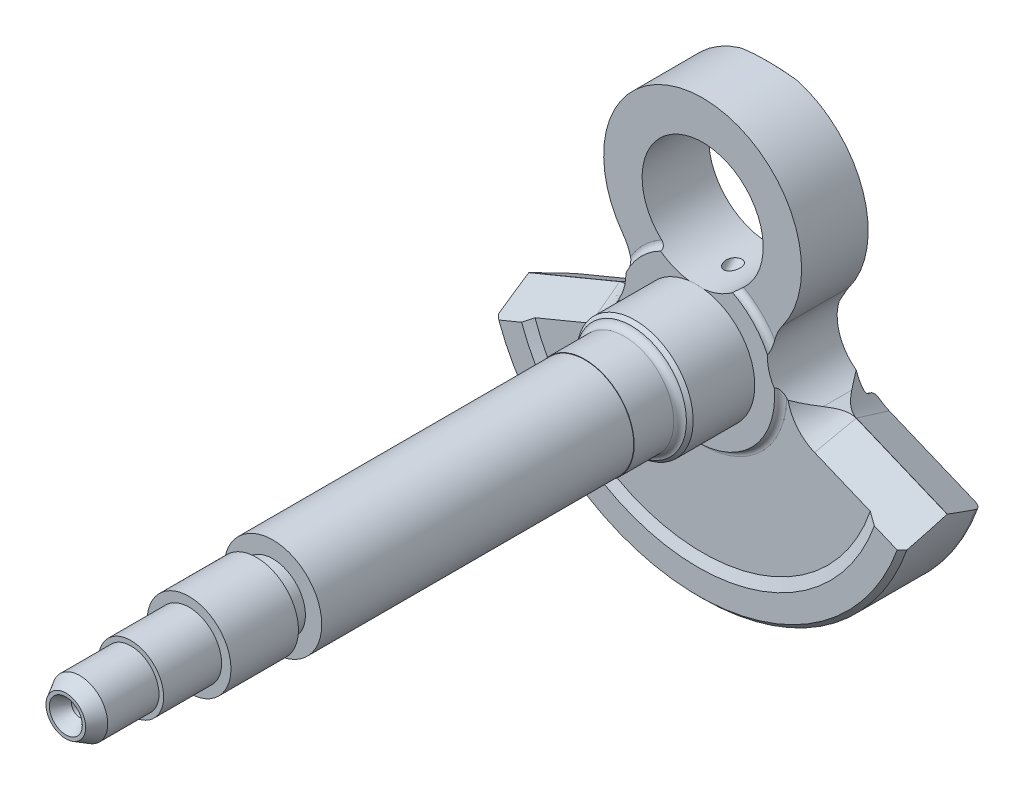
ISO-10303-21;
HEADER;
FILE_DESCRIPTION(('STEP AP214'),'2;1');
FILE_NAME('part.step','',(''),(''),'','','');
FILE_SCHEMA(('AUTOMOTIVE_DESIGN { 1 0 10303 214 1 1 1 1 }'));
ENDSEC;
DATA;
#1=APPLICATION_CONTEXT('core data for automotive mechanical design processes');
#2=APPLICATION_PROTOCOL_DEFINITION('international standard','automotive_design',2000,#1);
#3=PRODUCT_CONTEXT('',#1,'mechanical');
#4=PRODUCT('Part','Part','',(#3));
#5=PRODUCT_RELATED_PRODUCT_CATEGORY('part','',(#4));
#6=PRODUCT_DEFINITION_FORMATION('','',#4);
#7=PRODUCT_DEFINITION_CONTEXT('part definition',#1,'design');
#8=PRODUCT_DEFINITION('design','',#6,#7);
#9=PRODUCT_DEFINITION_SHAPE('','',#8);
#10=(LENGTH_UNIT() NAMED_UNIT(*) SI_UNIT(.MILLI.,.METRE.));
#11=(NAMED_UNIT(*) PLANE_ANGLE_UNIT() SI_UNIT($,.RADIAN.));
#12=(NAMED_UNIT(*) SI_UNIT($,.STERADIAN.) SOLID_ANGLE_UNIT());
#13=UNCERTAINTY_MEASURE_WITH_UNIT(LENGTH_MEASURE(1.E-05),#10,'distance_accuracy_value','');
#14=(GEOMETRIC_REPRESENTATION_CONTEXT(3) GLOBAL_UNCERTAINTY_ASSIGNED_CONTEXT((#13)) GLOBAL_UNIT_ASSIGNED_CONTEXT((#10,
#11,#12)) REPRESENTATION_CONTEXT('',''));
#15=CARTESIAN_POINT('',(0.,0.,0.));
#16=DIRECTION('',(0.,0.,1.));
#17=DIRECTION('',(1.,0.,0.));
#18=AXIS2_PLACEMENT_3D('',#15,#16,#17);
#19=CARTESIAN_POINT('',(0.,25.3,54.2695526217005));
#20=DIRECTION('',(0.,0.,-1.));
#21=DIRECTION('',(-1.,0.,0.));
#22=AXIS2_PLACEMENT_3D('',#19,#20,#21);
#23=CYLINDRICAL_SURFACE('',#22,13.);
#24=CARTESIAN_POINT('',(0.,12.3,11.6581109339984));
#25=CARTESIAN_POINT('',(0.0674171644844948,12.3000008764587,11.658103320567));
#26=CARTESIAN_POINT('',(0.134948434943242,12.3005321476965,11.6516716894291));
#27=CARTESIAN_POINT('',(0.267732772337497,12.3025863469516,11.6264940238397));
#28=CARTESIAN_POINT('',(0.332979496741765,12.304111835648,11.6077161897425));
#29=CARTESIAN_POINT('',(0.458776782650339,12.3079463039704,11.5595377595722));
#30=CARTESIAN_POINT('',(0.519359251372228,12.3102492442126,11.530218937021));
#31=CARTESIAN_POINT('',(0.635301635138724,12.3154026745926,11.4627872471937));
#32=CARTESIAN_POINT('',(0.69066103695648,12.3182532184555,11.4246735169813));
#33=CARTESIAN_POINT('',(0.817861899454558,12.3255364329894,11.3238451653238));
#34=CARTESIAN_POINT('',(0.886837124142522,12.3301301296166,11.2575272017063));
#35=CARTESIAN_POINT('',(1.01328401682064,12.3393947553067,11.1146874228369));
#36=CARTESIAN_POINT('',(1.07072860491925,12.3440658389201,11.0381422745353));
#37=CARTESIAN_POINT('',(1.19208602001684,12.3545829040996,10.8505605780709));
#38=CARTESIAN_POINT('',(1.25155782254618,12.3602883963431,10.7366453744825));
#39=CARTESIAN_POINT('',(1.35139636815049,12.3703353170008,10.5007883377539));
#40=CARTESIAN_POINT('',(1.39175152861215,12.3746759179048,10.378841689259));
#41=CARTESIAN_POINT('',(1.45440498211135,12.3815744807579,10.1280510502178));
#42=CARTESIAN_POINT('',(1.47636898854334,12.384099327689,9.99912291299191));
#43=CARTESIAN_POINT('',(1.50082701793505,12.3869188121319,9.73932389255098));
#44=CARTESIAN_POINT('',(1.503307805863,12.3872119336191,9.60845174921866));
#45=CARTESIAN_POINT('',(1.48710248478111,12.3853326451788,9.33355177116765));
#46=CARTESIAN_POINT('',(1.46606996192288,12.3828868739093,9.18965178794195));
#47=CARTESIAN_POINT('',(1.39711809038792,12.3752448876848,8.90849704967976));
#48=CARTESIAN_POINT('',(1.34925218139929,12.3700541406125,8.77122967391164));
#49=CARTESIAN_POINT('',(1.24583103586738,12.3597692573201,8.55425967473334));
#50=CARTESIAN_POINT('',(1.19825273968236,12.355227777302,8.47070306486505));
#51=CARTESIAN_POINT('',(1.09023497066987,12.3456829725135,8.31239369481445));
#52=CARTESIAN_POINT('',(1.02981457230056,12.3406803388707,8.23762813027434));
#53=CARTESIAN_POINT('',(0.906968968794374,12.3315549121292,8.110964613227));
#54=CARTESIAN_POINT('',(0.84635056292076,12.3274173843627,8.0573194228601));
#55=CARTESIAN_POINT('',(0.716999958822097,12.3196264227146,7.96076815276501));
#56=CARTESIAN_POINT('',(0.6482697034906,12.315972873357,7.91785950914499));
#57=CARTESIAN_POINT('',(0.503730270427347,12.3095608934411,7.84473781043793));
#58=CARTESIAN_POINT('',(0.427880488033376,12.3068080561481,7.81460375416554));
#59=CARTESIAN_POINT('',(0.271799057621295,12.3026080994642,7.76927314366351));
#60=CARTESIAN_POINT('',(0.19157012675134,12.3011601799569,7.75406743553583));
#61=CARTESIAN_POINT('',(0.0386680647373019,12.2998577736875,7.7403896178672));
#62=CARTESIAN_POINT('',(-0.0338584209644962,12.2998446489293,7.74025155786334));
#63=CARTESIAN_POINT('',(-0.177808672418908,12.3010169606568,7.75256344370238));
#64=CARTESIAN_POINT('',(-0.249232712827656,12.3022020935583,7.76501020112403));
#65=CARTESIAN_POINT('',(-0.386551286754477,12.305572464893,7.8011989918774));
#66=CARTESIAN_POINT('',(-0.45255077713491,12.3077230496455,7.82455068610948));
#67=CARTESIAN_POINT('',(-0.58002480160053,12.3127891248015,7.88129944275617));
#68=CARTESIAN_POINT('',(-0.641498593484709,12.3157047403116,7.91469814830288));
#69=CARTESIAN_POINT('',(-0.762703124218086,12.3222415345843,7.99271902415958));
#70=CARTESIAN_POINT('',(-0.822043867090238,12.325896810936,8.03794137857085));
#71=CARTESIAN_POINT('',(-0.933451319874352,12.3334355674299,8.13655289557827));
#72=CARTESIAN_POINT('',(-0.985514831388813,12.3373191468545,8.18994562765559));
#73=CARTESIAN_POINT('',(-1.08887029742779,12.3455634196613,8.3113504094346));
#74=CARTESIAN_POINT('',(-1.13898675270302,12.3499129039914,8.38036117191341));
#75=CARTESIAN_POINT('',(-1.22910810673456,12.3581554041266,8.52469521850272));
#76=CARTESIAN_POINT('',(-1.269106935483,12.3620481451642,8.6000222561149));
#77=CARTESIAN_POINT('',(-1.34601320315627,12.3698016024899,8.77020073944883));
#78=CARTESIAN_POINT('',(-1.38081988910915,12.3735099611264,8.86600718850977));
#79=CARTESIAN_POINT('',(-1.43698129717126,12.3796334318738,9.06149341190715));
#80=CARTESIAN_POINT('',(-1.45832835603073,12.3820478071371,9.16117535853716));
#81=CARTESIAN_POINT('',(-1.49133775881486,12.3858116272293,9.38328205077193));
#82=CARTESIAN_POINT('',(-1.50008549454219,12.3868377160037,9.50614810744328));
#83=CARTESIAN_POINT('',(-1.49991309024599,12.3868189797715,9.75194648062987));
#84=CARTESIAN_POINT('',(-1.49097130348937,12.3857716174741,9.87487869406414));
#85=CARTESIAN_POINT('',(-1.45322508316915,12.3814638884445,10.136865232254));
#86=CARTESIAN_POINT('',(-1.42159686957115,12.3778901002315,10.2755158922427));
#87=CARTESIAN_POINT('',(-1.33540561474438,12.3686974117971,10.5454749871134));
#88=CARTESIAN_POINT('',(-1.28086144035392,12.3630801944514,10.6767893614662));
#89=CARTESIAN_POINT('',(-1.16714506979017,12.3524135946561,10.8904724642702));
#90=CARTESIAN_POINT('',(-1.11387908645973,12.3476702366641,10.976009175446));
#91=CARTESIAN_POINT('',(-0.99473655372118,12.337975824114,11.13779837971));
#92=CARTESIAN_POINT('',(-0.92888223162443,12.3330251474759,11.2140668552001));
#93=CARTESIAN_POINT('',(-0.80173445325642,12.3246296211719,11.3365792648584));
#94=CARTESIAN_POINT('',(-0.74315965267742,12.3211091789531,11.3856311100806));
#95=CARTESIAN_POINT('',(-0.618842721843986,12.3145893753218,11.4737729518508));
#96=CARTESIAN_POINT('',(-0.553107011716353,12.3115895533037,11.5128717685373));
#97=CARTESIAN_POINT('',(-0.427227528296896,12.3068962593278,11.5728767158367));
#98=CARTESIAN_POINT('',(-0.368025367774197,12.3050675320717,11.5957434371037));
#99=CARTESIAN_POINT('',(-0.246685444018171,12.3022001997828,11.6312863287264));
#100=CARTESIAN_POINT('',(-0.184555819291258,12.3011595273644,11.6439891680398));
#101=CARTESIAN_POINT('',(-0.101644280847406,12.3003814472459,11.6534712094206));
#102=CARTESIAN_POINT('',(-0.0813590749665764,12.3002387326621,11.6552082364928));
#103=CARTESIAN_POINT('',(-0.0407193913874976,12.300047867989,11.657529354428));
#104=CARTESIAN_POINT('',(-0.0203649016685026,12.2999997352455,11.6581132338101));
#105=CARTESIAN_POINT('',(0.,12.3,11.6581109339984));
#106=B_SPLINE_CURVE_WITH_KNOTS('',3,(#24,#25,#26,#27,#28,#29,#30,#31,#32,#33,#34,#35,#36,#37,
#38,#39,#40,#41,#42,#43,#44,#45,#46,#47,#48,#49,#50,#51,#52,#53,#54,#55,#56,#57,#58,#59,#60,#61,
#62,#63,#64,#65,#66,#67,#68,#69,#70,#71,#72,#73,#74,#75,#76,#77,#78,#79,#80,#81,#82,#83,#84,#85,
#86,#87,#88,#89,#90,#91,#92,#93,#94,#95,#96,#97,#98,#99,#100,#101,#102,#103,#104,#105),
.UNSPECIFIED.,.T.,.F.,(4,2,2,2,2,2,2,2,2,2,2,2,2,2,2,2,2,2,2,2,2,2,2,2,2,2,2,2,2,2,2,2,2,2,2,2,
2,2,2,2,4),(0.,0.202156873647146,0.404836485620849,0.605976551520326,0.807136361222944,
1.09293921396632,1.3794056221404,1.76326736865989,2.14736139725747,2.53829403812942,
2.92949221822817,3.36350665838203,3.79665979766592,4.08438810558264,4.37169199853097,
4.61385163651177,4.8559533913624,5.09953121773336,5.34295959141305,5.55944264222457,
5.77587085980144,5.98508480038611,6.19433297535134,6.41754314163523,6.64085110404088,
6.89609951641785,7.15150070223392,7.45638968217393,7.76145209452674,8.12958288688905,
8.49816444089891,8.92301230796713,9.34751107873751,9.64917562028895,9.95031235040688,
10.1789534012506,10.407391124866,10.597097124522,10.7863037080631,10.8473586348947,
10.9084247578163),.UNSPECIFIED.);
#107=CARTESIAN_POINT('',(0.,12.3,11.6581109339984));
#108=VERTEX_POINT('',#107);
#109=EDGE_CURVE('E337',#108,#108,#106,.T.);
#110=ORIENTED_EDGE('',*,*,#109,.F.);
#111=EDGE_LOOP('',(#110));
#112=FACE_BOUND('',#111,.T.);
#113=CARTESIAN_POINT('',(0.,25.3,1.9));
#114=DIRECTION('',(0.,0.,1.));
#115=DIRECTION('',(1.,0.,0.));
#116=AXIS2_PLACEMENT_3D('',#113,#114,#115);
#117=CIRCLE('',#116,13.);
#118=CARTESIAN_POINT('',(13.,25.3,1.9));
#119=VERTEX_POINT('',#118);
#120=EDGE_CURVE('E669',#119,#119,#117,.F.);
#121=ORIENTED_EDGE('',*,*,#120,.T.);
#122=EDGE_LOOP('',(#121));
#123=FACE_BOUND('',#122,.T.);
#124=CARTESIAN_POINT('',(0.,25.3,16.2));
#125=DIRECTION('',(0.,0.,1.));
#126=DIRECTION('',(1.,0.,0.));
#127=AXIS2_PLACEMENT_3D('',#124,#125,#126);
#128=CIRCLE('',#127,13.);
#129=CARTESIAN_POINT('',(8.81905857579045,15.7488636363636,16.2));
#130=VERTEX_POINT('',#129);
#131=CARTESIAN_POINT('',(-8.81905857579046,15.7488636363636,16.2));
#132=VERTEX_POINT('',#131);
#133=EDGE_CURVE('E705',#130,#132,#128,.T.);
#134=ORIENTED_EDGE('',*,*,#133,.T.);
#135=CARTESIAN_POINT('',(-7.73935658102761,14.854792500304,17.5002));
#136=CARTESIAN_POINT('',(-7.73934948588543,14.8547883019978,17.466030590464));
#137=CARTESIAN_POINT('',(-7.74055186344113,14.8556780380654,17.4318786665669));
#138=CARTESIAN_POINT('',(-7.74534093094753,14.8592286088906,17.3638457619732));
#139=CARTESIAN_POINT('',(-7.74892686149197,14.8618888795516,17.3299646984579));
#140=CARTESIAN_POINT('',(-7.76316440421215,14.872467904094,17.2293655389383));
#141=CARTESIAN_POINT('',(-7.77729644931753,14.882985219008,17.1633656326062));
#142=CARTESIAN_POINT('',(-7.81407341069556,14.9105449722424,17.0353392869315));
#143=CARTESIAN_POINT('',(-7.83671146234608,14.9275821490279,16.9733096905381));
#144=CARTESIAN_POINT('',(-7.88943501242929,14.9676281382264,16.8545336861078));
#145=CARTESIAN_POINT('',(-7.91952623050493,14.9906415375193,16.7977913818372));
#146=CARTESIAN_POINT('',(-7.9875561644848,15.0432520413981,16.6881503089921));
#147=CARTESIAN_POINT('',(-8.02580535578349,15.0731148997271,16.635572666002));
#148=CARTESIAN_POINT('',(-8.10775968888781,15.1379646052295,16.5384507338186));
#149=CARTESIAN_POINT('',(-8.15146670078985,15.1729532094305,16.493909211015));
#150=CARTESIAN_POINT('',(-8.24719915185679,15.2507293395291,16.4099228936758));
#151=CARTESIAN_POINT('',(-8.29961978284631,15.2939374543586,16.3713166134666));
#152=CARTESIAN_POINT('',(-8.40774534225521,15.3846180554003,16.3053334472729));
#153=CARTESIAN_POINT('',(-8.4634512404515,15.4320918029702,16.2779598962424));
#154=CARTESIAN_POINT('',(-8.57956639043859,15.5328486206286,16.2339726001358));
#155=CARTESIAN_POINT('',(-8.64006895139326,15.586305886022,16.2180001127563));
#156=CARTESIAN_POINT('',(-8.76118897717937,15.6954068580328,16.1998404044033));
#157=CARTESIAN_POINT('',(-8.82180644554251,15.751050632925,16.1976536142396));
#158=CARTESIAN_POINT('',(-8.94094955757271,15.8625200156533,16.2073987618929));
#159=CARTESIAN_POINT('',(-8.99948691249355,15.9183415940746,16.2192315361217));
#160=CARTESIAN_POINT('',(-9.11316607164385,16.0287282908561,16.256864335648));
#161=CARTESIAN_POINT('',(-9.16830874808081,16.0832937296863,16.2826607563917));
#162=CARTESIAN_POINT('',(-9.27126578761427,16.1868917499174,16.3463454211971));
#163=CARTESIAN_POINT('',(-9.31929332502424,16.2360613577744,16.383665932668));
#164=CARTESIAN_POINT('',(-9.4093649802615,16.329600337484,16.4697793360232));
#165=CARTESIAN_POINT('',(-9.45141080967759,16.3739710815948,16.5185689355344));
#166=CARTESIAN_POINT('',(-9.52672079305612,16.4544075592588,16.6239530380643));
#167=CARTESIAN_POINT('',(-9.56028264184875,16.4907464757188,16.6801267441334));
#168=CARTESIAN_POINT('',(-9.62004636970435,16.5560492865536,16.8001803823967));
#169=CARTESIAN_POINT('',(-9.64624729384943,16.585012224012,16.8640613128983));
#170=CARTESIAN_POINT('',(-9.69010765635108,16.6338089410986,16.9959629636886));
#171=CARTESIAN_POINT('',(-9.70796204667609,16.6538505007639,17.0638424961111));
#172=CARTESIAN_POINT('',(-9.73566711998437,16.6850578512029,17.2031265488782));
#173=CARTESIAN_POINT('',(-9.74552951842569,16.6962366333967,17.2745257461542));
#174=CARTESIAN_POINT('',(-9.75334766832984,16.7051053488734,17.372087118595));
#175=CARTESIAN_POINT('',(-9.75487940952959,16.7068440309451,17.3976782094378));
#176=CARTESIAN_POINT('',(-9.75691732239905,16.7091579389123,17.4489091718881));
#177=CARTESIAN_POINT('',(-9.75742526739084,16.7097351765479,17.4745488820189));
#178=CARTESIAN_POINT('',(-9.75742364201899,16.7097331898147,17.5002));
#179=B_SPLINE_CURVE_WITH_KNOTS('',3,(#135,#136,#137,#138,#139,#140,#141,#142,#143,#144,#145,
#146,#147,#148,#149,#150,#151,#152,#153,#154,#155,#156,#157,#158,#159,#160,#161,#162,#163,#164,
#165,#166,#167,#168,#169,#170,#171,#172,#173,#174,#175,#176,#177,#178),.UNSPECIFIED.,.F.,.F.,(4,
2,2,2,2,2,2,2,2,2,2,2,2,2,2,2,2,2,2,2,2,4),(0.,0.102440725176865,0.204848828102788,
0.408700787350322,0.612388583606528,0.816233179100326,1.02999130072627,1.24382286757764,
1.47720792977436,1.7106622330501,1.95638863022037,2.20212270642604,2.44612897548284,
2.69007228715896,2.9235245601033,3.15690989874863,3.38035757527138,3.60383422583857,
3.82179216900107,4.03943002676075,4.11648228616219,4.19340096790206),.UNSPECIFIED.);
#180=CARTESIAN_POINT('',(-7.73935656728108,14.8547924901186,17.5));
#181=VERTEX_POINT('',#180);
#182=EDGE_CURVE('E459',#181,#132,#179,.T.);
#183=ORIENTED_EDGE('',*,*,#182,.F.);
#184=CARTESIAN_POINT('',(0.,25.3,17.5));
#185=DIRECTION('',(0.,0.,1.));
#186=DIRECTION('',(1.,0.,0.));
#187=AXIS2_PLACEMENT_3D('',#184,#185,#186);
#188=CIRCLE('',#187,13.);
#189=CARTESIAN_POINT('',(-1.59342648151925,12.398023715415,17.5));
#190=VERTEX_POINT('',#189);
#191=EDGE_CURVE('E770',#190,#181,#188,.F.);
#192=ORIENTED_EDGE('',*,*,#191,.F.);
#193=CARTESIAN_POINT('',(1.59342648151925,12.398023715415,17.5));
#194=VERTEX_POINT('',#193);
#195=EDGE_CURVE('E769',#194,#190,#188,.F.);
#196=ORIENTED_EDGE('',*,*,#195,.F.);
#197=CARTESIAN_POINT('',(7.73935656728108,14.8547924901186,17.5));
#198=VERTEX_POINT('',#197);
#199=EDGE_CURVE('E716',#198,#194,#188,.F.);
#200=ORIENTED_EDGE('',*,*,#199,.F.);
#201=CARTESIAN_POINT('',(9.75742364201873,16.7097331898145,17.5002));
#202=CARTESIAN_POINT('',(9.75742665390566,16.7097379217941,17.4642124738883));
#203=CARTESIAN_POINT('',(9.75642432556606,16.708597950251,17.4282420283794));
#204=CARTESIAN_POINT('',(9.75241464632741,16.7040461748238,17.3565599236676));
#205=CARTESIAN_POINT('',(9.74940742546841,16.7006345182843,17.3208482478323));
#206=CARTESIAN_POINT('',(9.73740193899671,16.6870354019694,17.2145660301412));
#207=CARTESIAN_POINT('',(9.72541980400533,16.6734836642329,17.1447098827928));
#208=CARTESIAN_POINT('',(9.69374005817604,16.6379007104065,17.0090342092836));
#209=CARTESIAN_POINT('',(9.67403942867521,16.6158661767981,16.943216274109));
#210=CARTESIAN_POINT('',(9.6273457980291,16.5641301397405,16.8174480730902));
#211=CARTESIAN_POINT('',(9.60035389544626,16.5344297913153,16.7574969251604));
#212=CARTESIAN_POINT('',(9.53953546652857,16.4682796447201,16.6448261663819));
#213=CARTESIAN_POINT('',(9.50567767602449,16.4317990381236,16.5921415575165));
#214=CARTESIAN_POINT('',(9.43198963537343,16.3534667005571,16.4956903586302));
#215=CARTESIAN_POINT('',(9.39215822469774,16.3116139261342,16.4519255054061));
#216=CARTESIAN_POINT('',(9.30675344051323,16.2232067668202,16.3736954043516));
#217=CARTESIAN_POINT('',(9.26109378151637,16.176584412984,16.3394013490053));
#218=CARTESIAN_POINT('',(9.16572172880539,16.0807748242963,16.2818244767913));
#219=CARTESIAN_POINT('',(9.11600903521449,16.031587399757,16.2585424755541));
#220=CARTESIAN_POINT('',(9.01206874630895,15.9304727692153,16.2227506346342));
#221=CARTESIAN_POINT('',(8.95774636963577,15.8785086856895,16.2106209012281));
#222=CARTESIAN_POINT('',(8.84748220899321,15.7748864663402,16.1984956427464));
#223=CARTESIAN_POINT('',(8.79154001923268,15.7232284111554,16.198503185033));
#224=CARTESIAN_POINT('',(8.67693300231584,15.619241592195,16.2106735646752));
#225=CARTESIAN_POINT('',(8.61825878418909,15.5669869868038,16.2233825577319));
#226=CARTESIAN_POINT('',(8.50230364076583,15.4655312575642,16.2612741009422));
#227=CARTESIAN_POINT('',(8.44502308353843,15.4163309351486,16.2864599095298));
#228=CARTESIAN_POINT('',(8.33155666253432,15.320477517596,16.3497352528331));
#229=CARTESIAN_POINT('',(8.2754781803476,15.2739725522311,16.3882431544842));
#230=CARTESIAN_POINT('',(8.16846665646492,15.1865965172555,16.4770489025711));
#231=CARTESIAN_POINT('',(8.11753396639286,15.1457258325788,16.5273475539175));
#232=CARTESIAN_POINT('',(8.02344782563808,15.071224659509,16.637926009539));
#233=CARTESIAN_POINT('',(7.98020270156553,15.0375077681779,16.6980690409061));
#234=CARTESIAN_POINT('',(7.90276247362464,14.9777547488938,16.8273858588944));
#235=CARTESIAN_POINT('',(7.86856552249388,14.9517170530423,16.8965577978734));
#236=CARTESIAN_POINT('',(7.81344782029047,14.9100461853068,17.0363214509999));
#237=CARTESIAN_POINT('',(7.7917118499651,14.8937696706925,17.1064001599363));
#238=CARTESIAN_POINT('',(7.7590587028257,14.869399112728,17.250309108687));
#239=CARTESIAN_POINT('',(7.74811272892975,14.8612832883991,17.3241288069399));
#240=CARTESIAN_POINT('',(7.74171996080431,14.8565441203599,17.4153645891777));
#241=CARTESIAN_POINT('',(7.74083153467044,14.8558855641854,17.4323244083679));
#242=CARTESIAN_POINT('',(7.73964969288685,14.8550095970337,17.4662538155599));
#243=CARTESIAN_POINT('',(7.73935549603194,14.8547916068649,17.4832233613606));
#244=CARTESIAN_POINT('',(7.73935658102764,14.8547925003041,17.5002));
#245=B_SPLINE_CURVE_WITH_KNOTS('',3,(#201,#202,#203,#204,#205,#206,#207,#208,#209,#210,#211,
#212,#213,#214,#215,#216,#217,#218,#219,#220,#221,#222,#223,#224,#225,#226,#227,#228,#229,#230,
#231,#232,#233,#234,#235,#236,#237,#238,#239,#240,#241,#242,#243,#244),.UNSPECIFIED.,.F.,.F.,(4,
2,2,2,2,2,2,2,2,2,2,2,2,2,2,2,2,2,2,2,2,4),(0.,0.107895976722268,0.215784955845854,
0.431152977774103,0.646605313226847,0.862025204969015,1.07844898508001,1.29491486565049,
1.51506971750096,1.73524087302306,1.96266463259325,2.19014586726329,2.4278484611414,
2.6656131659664,2.91164820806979,3.15770005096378,3.4005855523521,3.64342142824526,
3.86768883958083,4.09135607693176,4.14233474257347,4.19324634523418),.UNSPECIFIED.);
#246=EDGE_CURVE('E467',#130,#198,#245,.T.);
#247=ORIENTED_EDGE('',*,*,#246,.F.);
#248=EDGE_LOOP('',(#134,#183,#192,#196,#200,#247));
#249=FACE_BOUND('',#248,.T.);
#250=ADVANCED_FACE('F41',(#112,#123,#249),#23,.F.);
#251=CARTESIAN_POINT('',(0.,25.3,152.95));
#252=DIRECTION('',(0.,0.,-1.));
#253=DIRECTION('',(-1.,0.,0.));
#254=AXIS2_PLACEMENT_3D('',#251,#252,#253);
#255=CYLINDRICAL_SURFACE('',#254,21.25);
#256=CARTESIAN_POINT('',(0.,25.3,16.2));
#257=DIRECTION('',(0.,0.,1.));
#258=DIRECTION('',(1.,0.,0.));
#259=AXIS2_PLACEMENT_3D('',#256,#257,#258);
#260=CIRCLE('',#259,21.25);
#261=CARTESIAN_POINT('',(-17.1261817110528,12.72,16.2));
#262=VERTEX_POINT('',#261);
#263=CARTESIAN_POINT('',(17.1261817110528,12.72,16.2));
#264=VERTEX_POINT('',#263);
#265=EDGE_CURVE('E494',#262,#264,#260,.F.);
#266=ORIENTED_EDGE('',*,*,#265,.T.);
#267=DIRECTION('',(0.,0.,-1.));
#268=VECTOR('',#267,1.);
#269=CARTESIAN_POINT('',(17.1261817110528,12.72,152.95));
#270=LINE('',#269,#268);
#271=CARTESIAN_POINT('',(17.1261817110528,12.72,1.90000000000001));
#272=VERTEX_POINT('',#271);
#273=EDGE_CURVE('E961',#264,#272,#270,.T.);
#274=ORIENTED_EDGE('',*,*,#273,.T.);
#275=CARTESIAN_POINT('',(0.,25.3,1.90000000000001));
#276=DIRECTION('',(0.,0.,1.));
#277=DIRECTION('',(1.,0.,0.));
#278=AXIS2_PLACEMENT_3D('',#275,#276,#277);
#279=CIRCLE('',#278,21.25);
#280=CARTESIAN_POINT('',(6.16855564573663,45.6349802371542,1.89999999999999));
#281=VERTEX_POINT('',#280);
#282=EDGE_CURVE('E490',#281,#272,#279,.F.);
#283=ORIENTED_EDGE('',*,*,#282,.F.);
#284=CARTESIAN_POINT('',(6.16975556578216,45.6346162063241,1.89979999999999));
#285=CARTESIAN_POINT('',(5.91576184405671,45.7116817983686,1.94213962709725));
#286=CARTESIAN_POINT('',(5.65995476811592,45.7840975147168,1.98186750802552));
#287=CARTESIAN_POINT('',(5.14507803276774,45.9194457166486,2.05603681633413));
#288=CARTESIAN_POINT('',(4.88600827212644,45.9823779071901,2.09047807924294));
#289=CARTESIAN_POINT('',(4.10455360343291,46.1566496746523,2.1857642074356));
#290=CARTESIAN_POINT('',(3.57784651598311,46.2534877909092,2.23858421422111));
#291=CARTESIAN_POINT('',(2.53160582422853,46.4050999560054,2.32119761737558));
#292=CARTESIAN_POINT('',(2.01227426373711,46.46095920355,2.35158521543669));
#293=CARTESIAN_POINT('',(0.970146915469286,46.5342665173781,2.39145236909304));
#294=CARTESIAN_POINT('',(0.447351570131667,46.5517193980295,2.40093454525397));
#295=CARTESIAN_POINT('',(-0.585852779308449,46.5480566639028,2.39894374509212));
#296=CARTESIAN_POINT('',(-1.09626616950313,46.5278314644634,2.38795455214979));
#297=CARTESIAN_POINT('',(-2.1135236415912,46.4507863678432,2.34605065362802));
#298=CARTESIAN_POINT('',(-2.62036741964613,46.3939633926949,2.31513427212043));
#299=CARTESIAN_POINT('',(-3.64110334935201,46.2422611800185,2.2324608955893));
#300=CARTESIAN_POINT('',(-4.15480260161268,46.1463726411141,2.18015102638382));
#301=CARTESIAN_POINT('',(-4.91710332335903,45.9749250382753,2.08639981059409));
#302=CARTESIAN_POINT('',(-5.16984996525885,45.9131669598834,2.05259815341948));
#303=CARTESIAN_POINT('',(-5.67222555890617,45.7806208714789,1.9799601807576));
#304=CARTESIAN_POINT('',(-5.92185459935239,45.7098331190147,1.94112400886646));
#305=CARTESIAN_POINT('',(-6.16975556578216,45.6346162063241,1.8998));
#306=B_SPLINE_CURVE_WITH_KNOTS('',3,(#284,#285,#286,#287,#288,#289,#290,#291,#292,#293,#294,
#295,#296,#297,#298,#299,#300,#301,#302,#303,#304,#305),.UNSPECIFIED.,.F.,.F.,(4,2,2,2,2,2,2,2,
2,2,4),(0.,0.806227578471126,1.61248023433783,3.22474250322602,4.79259423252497,
6.36024941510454,7.89132656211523,9.42253249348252,10.996097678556,11.7830138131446,
12.5699075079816),.UNSPECIFIED.);
#307=CARTESIAN_POINT('',(-6.16855564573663,45.6349802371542,1.89999999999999));
#308=VERTEX_POINT('',#307);
#309=EDGE_CURVE('E376',#281,#308,#306,.T.);
#310=ORIENTED_EDGE('',*,*,#309,.T.);
#311=CARTESIAN_POINT('',(-17.1261817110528,12.72,1.90000000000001));
#312=VERTEX_POINT('',#311);
#313=EDGE_CURVE('E493',#312,#308,#279,.F.);
#314=ORIENTED_EDGE('',*,*,#313,.F.);
#315=DIRECTION('',(0.,0.,-1.));
#316=VECTOR('',#315,1.);
#317=CARTESIAN_POINT('',(-17.1261817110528,12.72,152.95));
#318=LINE('',#317,#316);
#319=EDGE_CURVE('E964',#262,#312,#318,.T.);
#320=ORIENTED_EDGE('',*,*,#319,.F.);
#321=EDGE_LOOP('',(#266,#274,#283,#310,#314,#320));
#322=FACE_BOUND('',#321,.T.);
#323=ADVANCED_FACE('F422',(#322),#255,.T.);
#324=CARTESIAN_POINT('',(0.,0.,16.2));
#325=DIRECTION('',(0.,0.,1.));
#326=DIRECTION('',(1.,0.,0.));
#327=AXIS2_PLACEMENT_3D('',#324,#325,#326);
#328=PLANE('',#327);
#329=CARTESIAN_POINT('',(-27.6855613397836,1.4348972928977,16.2));
#330=DIRECTION('',(0.,0.,1.));
#331=DIRECTION('',(1.,0.,0.));
#332=AXIS2_PLACEMENT_3D('',#329,#330,#331);
#333=CIRCLE('',#332,9.533692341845);
#334=CARTESIAN_POINT('',(-24.0371752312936,-7.3730859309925,16.2));
#335=VERTEX_POINT('',#334);
#336=CARTESIAN_POINT('',(-18.3500860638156,-0.499060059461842,16.2));
#337=VERTEX_POINT('',#336);
#338=EDGE_CURVE('E56',#335,#337,#333,.T.);
#339=ORIENTED_EDGE('',*,*,#338,.F.);
#340=DIRECTION('',(0.923879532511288,0.382683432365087,0.));
#341=VECTOR('',#340,1.);
#342=CARTESIAN_POINT('',(-0.913383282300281,2.20510230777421,16.2));
#343=LINE('',#342,#341);
#344=CARTESIAN_POINT('',(-35.9977709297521,-12.3273268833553,16.2));
#345=VERTEX_POINT('',#344);
#346=EDGE_CURVE('E308',#345,#335,#343,.T.);
#347=ORIENTED_EDGE('',*,*,#346,.F.);
#348=CARTESIAN_POINT('',(0.,0.,16.2));
#349=DIRECTION('',(0.,0.,1.));
#350=DIRECTION('',(1.,0.,0.));
#351=AXIS2_PLACEMENT_3D('',#348,#349,#350);
#352=CIRCLE('',#351,38.05);
#353=CARTESIAN_POINT('',(35.9977709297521,-12.3273268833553,16.2));
#354=VERTEX_POINT('',#353);
#355=EDGE_CURVE('E726',#345,#354,#352,.T.);
#356=ORIENTED_EDGE('',*,*,#355,.T.);
#357=DIRECTION('',(0.923879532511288,-0.382683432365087,0.));
#358=VECTOR('',#357,1.);
#359=CARTESIAN_POINT('',(0.913383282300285,2.20510230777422,16.2));
#360=LINE('',#359,#358);
#361=CARTESIAN_POINT('',(24.0371752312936,-7.3730859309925,16.2));
#362=VERTEX_POINT('',#361);
#363=EDGE_CURVE('E901',#362,#354,#360,.T.);
#364=ORIENTED_EDGE('',*,*,#363,.F.);
#365=CARTESIAN_POINT('',(27.6855613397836,1.4348972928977,16.2));
#366=DIRECTION('',(0.,0.,1.));
#367=DIRECTION('',(1.,0.,0.));
#368=AXIS2_PLACEMENT_3D('',#365,#366,#367);
#369=CIRCLE('',#368,9.533692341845);
#370=CARTESIAN_POINT('',(18.3500860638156,-0.499060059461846,16.2));
#371=VERTEX_POINT('',#370);
#372=EDGE_CURVE('E899',#371,#362,#369,.T.);
#373=ORIENTED_EDGE('',*,*,#372,.F.);
#374=CARTESIAN_POINT('',(25.1855613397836,6.8,16.2));
#375=DIRECTION('',(0.,0.,1.));
#376=DIRECTION('',(1.,0.,0.));
#377=AXIS2_PLACEMENT_3D('',#374,#375,#376);
#378=CIRCLE('',#377,10.);
#379=CARTESIAN_POINT('',(18.0488381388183,-0.204797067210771,16.2));
#380=VERTEX_POINT('',#379);
#381=EDGE_CURVE('E954',#380,#371,#378,.T.);
#382=ORIENTED_EDGE('',*,*,#381,.F.);
#383=CARTESIAN_POINT('',(0.,0.,16.2));
#384=DIRECTION('',(0.,0.,1.));
#385=DIRECTION('',(1.,0.,0.));
#386=AXIS2_PLACEMENT_3D('',#383,#384,#385);
#387=CIRCLE('',#386,18.05);
#388=CARTESIAN_POINT('',(-18.0488381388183,-0.204797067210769,16.2));
#389=VERTEX_POINT('',#388);
#390=EDGE_CURVE('E725',#380,#389,#387,.F.);
#391=ORIENTED_EDGE('',*,*,#390,.T.);
#392=CARTESIAN_POINT('',(-25.1855613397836,6.8,16.2));
#393=DIRECTION('',(0.,0.,1.));
#394=DIRECTION('',(1.,0.,0.));
#395=AXIS2_PLACEMENT_3D('',#392,#393,#394);
#396=CIRCLE('',#395,10.);
#397=EDGE_CURVE('E328',#337,#389,#396,.T.);
#398=ORIENTED_EDGE('',*,*,#397,.F.);
#399=EDGE_LOOP('',(#339,#347,#356,#364,#373,#382,#391,#398));
#400=FACE_BOUND('',#399,.T.);
#401=ADVANCED_FACE('F697',(#400),#328,.T.);
#402=CARTESIAN_POINT('',(0.,0.,17.2));
#403=DIRECTION('',(0.,0.,1.));
#404=DIRECTION('',(1.,0.,0.));
#405=AXIS2_PLACEMENT_3D('',#402,#403,#404);
#406=PLANE('',#405);
#407=DIRECTION('',(0.923879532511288,0.382683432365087,0.));
#408=VECTOR('',#407,1.);
#409=CARTESIAN_POINT('',(-58.0422697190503,-21.9631850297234,17.2));
#410=LINE('',#409,#408);
#411=CARTESIAN_POINT('',(-42.7802273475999,-15.6414400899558,17.2));
#412=VERTEX_POINT('',#411);
#413=CARTESIAN_POINT('',(-37.8787331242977,-13.6111747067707,17.2));
#414=VERTEX_POINT('',#413);
#415=EDGE_CURVE('E309',#412,#414,#410,.T.);
#416=ORIENTED_EDGE('',*,*,#415,.F.);
#417=CARTESIAN_POINT('',(0.,0.,17.2));
#418=DIRECTION('',(0.,0.,1.));
#419=DIRECTION('',(1.,0.,0.));
#420=AXIS2_PLACEMENT_3D('',#417,#418,#419);
#421=CIRCLE('',#420,45.5500000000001);
#422=CARTESIAN_POINT('',(42.7802273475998,-15.6414400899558,17.2));
#423=VERTEX_POINT('',#422);
#424=EDGE_CURVE('E735',#412,#423,#421,.T.);
#425=ORIENTED_EDGE('',*,*,#424,.T.);
#426=DIRECTION('',(0.923879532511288,-0.382683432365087,0.));
#427=VECTOR('',#426,1.);
#428=CARTESIAN_POINT('',(52.6310647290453,-19.7217905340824,17.2));
#429=LINE('',#428,#427);
#430=CARTESIAN_POINT('',(37.8787331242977,-13.6111747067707,17.2));
#431=VERTEX_POINT('',#430);
#432=EDGE_CURVE('E883',#431,#423,#429,.T.);
#433=ORIENTED_EDGE('',*,*,#432,.F.);
#434=CARTESIAN_POINT('',(0.,0.,17.2));
#435=DIRECTION('',(0.,0.,1.));
#436=DIRECTION('',(1.,0.,0.));
#437=AXIS2_PLACEMENT_3D('',#434,#435,#436);
#438=CIRCLE('',#437,40.25);
#439=EDGE_CURVE('E750',#414,#431,#438,.T.);
#440=ORIENTED_EDGE('',*,*,#439,.F.);
#441=EDGE_LOOP('',(#416,#425,#433,#440));
#442=FACE_BOUND('',#441,.T.);
#443=ADVANCED_FACE('F881',(#442),#406,.T.);
#444=CARTESIAN_POINT('',(0.,0.,17.2));
#445=DIRECTION('',(0.,0.,1.));
#446=DIRECTION('',(1.,0.,0.));
#447=AXIS2_PLACEMENT_3D('',#444,#445,#446);
#448=CONICAL_SURFACE('',#447,40.25,1.14416883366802);
#449=ORIENTED_EDGE('',*,*,#355,.F.);
#450=CARTESIAN_POINT('',(-35.9973938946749,-12.3270697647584,16.1998));
#451=CARTESIAN_POINT('',(-36.3111948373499,-12.5410709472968,16.3662671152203));
#452=CARTESIAN_POINT('',(-36.6249048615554,-12.7551016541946,16.5328673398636));
#453=CARTESIAN_POINT('',(-37.2521430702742,-13.1832221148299,16.8663340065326));
#454=CARTESIAN_POINT('',(-37.565671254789,-13.3973118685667,17.0332004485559));
#455=CARTESIAN_POINT('',(-37.8791085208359,-13.6114311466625,17.2002));
#456=B_SPLINE_CURVE_WITH_KNOTS('',3,(#450,#451,#452,#453,#454,#455),.UNSPECIFIED.,.F.,.F.,(4,2,
4),(0.,1.24410964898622,2.48821928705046),.UNSPECIFIED.);
#457=EDGE_CURVE('E849',#345,#414,#456,.T.);
#458=ORIENTED_EDGE('',*,*,#457,.T.);
#459=ORIENTED_EDGE('',*,*,#439,.T.);
#460=CARTESIAN_POINT('',(37.8791085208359,-13.6114311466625,17.2002));
#461=CARTESIAN_POINT('',(37.565671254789,-13.3973118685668,17.0332004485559));
#462=CARTESIAN_POINT('',(37.2521430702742,-13.1832221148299,16.8663340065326));
#463=CARTESIAN_POINT('',(36.6249048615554,-12.7551016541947,16.5328673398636));
#464=CARTESIAN_POINT('',(36.3111948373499,-12.5410709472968,16.3662671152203));
#465=CARTESIAN_POINT('',(35.9973938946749,-12.3270697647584,16.1998));
#466=B_SPLINE_CURVE_WITH_KNOTS('',3,(#460,#461,#462,#463,#464,#465),.UNSPECIFIED.,.F.,.F.,(4,2,
4),(0.,1.24410963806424,2.48821928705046),.UNSPECIFIED.);
#467=EDGE_CURVE('E889',#431,#354,#466,.T.);
#468=ORIENTED_EDGE('',*,*,#467,.T.);
#469=EDGE_LOOP('',(#449,#458,#459,#468));
#470=FACE_BOUND('',#469,.T.);
#471=ADVANCED_FACE('F910',(#470),#448,.F.);
#472=CARTESIAN_POINT('',(0.,0.,17.5));
#473=DIRECTION('',(0.,0.,1.));
#474=DIRECTION('',(1.,0.,0.));
#475=AXIS2_PLACEMENT_3D('',#472,#473,#474);
#476=TOROIDAL_SURFACE('',#475,18.05,1.3);
#477=CARTESIAN_POINT('',(0.,0.,17.5));
#478=DIRECTION('',(0.,0.,1.));
#479=DIRECTION('',(1.,0.,0.));
#480=AXIS2_PLACEMENT_3D('',#477,#478,#479);
#481=CIRCLE('',#480,16.75);
#482=CARTESIAN_POINT('',(15.1889680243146,7.06100207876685,17.5));
#483=VERTEX_POINT('',#482);
#484=EDGE_CURVE('E754',#483,#198,#481,.T.);
#485=ORIENTED_EDGE('',*,*,#484,.F.);
#486=CARTESIAN_POINT('',(15.1891535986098,7.068015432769,17.5900983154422));
#487=CARTESIAN_POINT('',(15.1890841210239,7.06541499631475,17.5734239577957));
#488=CARTESIAN_POINT('',(15.1890342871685,7.06352862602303,17.5566436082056));
#489=CARTESIAN_POINT('',(15.1889734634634,7.06121459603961,17.5229887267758));
#490=CARTESIAN_POINT('',(15.1889624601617,7.06078643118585,17.5061142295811));
#491=CARTESIAN_POINT('',(15.1889868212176,7.06172698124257,17.455835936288));
#492=CARTESIAN_POINT('',(15.1890782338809,7.06526941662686,17.4224495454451));
#493=CARTESIAN_POINT('',(15.1894185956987,7.07778824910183,17.3567914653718));
#494=CARTESIAN_POINT('',(15.189667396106,7.08675951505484,17.3245187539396));
#495=CARTESIAN_POINT('',(15.1903390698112,7.10928790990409,17.2615824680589));
#496=CARTESIAN_POINT('',(15.1907623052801,7.12285456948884,17.2309223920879));
#497=CARTESIAN_POINT('',(15.1921570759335,7.16404402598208,17.1513903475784));
#498=CARTESIAN_POINT('',(15.193305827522,7.19496458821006,17.104242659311));
#499=CARTESIAN_POINT('',(15.1962482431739,7.26347351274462,17.0150703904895));
#500=CARTESIAN_POINT('',(15.1980441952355,7.30108528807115,16.9730647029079));
#501=CARTESIAN_POINT('',(15.2022179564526,7.37814397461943,16.8961254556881));
#502=CARTESIAN_POINT('',(15.2045509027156,7.41731718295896,16.8609107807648));
#503=CARTESIAN_POINT('',(15.2098998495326,7.49845088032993,16.793877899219));
#504=CARTESIAN_POINT('',(15.2129164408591,7.54041375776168,16.7620626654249));
#505=CARTESIAN_POINT('',(15.2196789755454,7.62647187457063,16.7014014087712));
#506=CARTESIAN_POINT('',(15.2234261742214,7.67057068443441,16.6725606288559));
#507=CARTESIAN_POINT('',(15.2316826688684,7.76038340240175,16.6176226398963));
#508=CARTESIAN_POINT('',(15.2361922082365,7.80609782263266,16.5915263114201));
#509=CARTESIAN_POINT('',(15.2490857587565,7.92791937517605,16.5263068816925));
#510=CARTESIAN_POINT('',(15.2581249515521,8.00509170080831,16.4892893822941));
#511=CARTESIAN_POINT('',(15.2784217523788,8.16192911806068,16.4216299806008));
#512=CARTESIAN_POINT('',(15.2896806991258,8.24159568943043,16.3909919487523));
#513=CARTESIAN_POINT('',(15.3144953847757,8.40271413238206,16.336125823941));
#514=CARTESIAN_POINT('',(15.3280497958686,8.48416494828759,16.3118940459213));
#515=CARTESIAN_POINT('',(15.3575097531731,8.64834184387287,16.2700983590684));
#516=CARTESIAN_POINT('',(15.3734155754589,8.73106807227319,16.2525352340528));
#517=CARTESIAN_POINT('',(15.4174839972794,8.9453565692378,16.2164742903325));
#518=CARTESIAN_POINT('',(15.4474175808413,9.07751197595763,16.2033023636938));
#519=CARTESIAN_POINT('',(15.5127892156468,9.34082227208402,16.1977920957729));
#520=CARTESIAN_POINT('',(15.5482158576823,9.47197865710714,16.2054111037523));
#521=CARTESIAN_POINT('',(15.6133858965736,9.69538338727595,16.2400080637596));
#522=CARTESIAN_POINT('',(15.6421660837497,9.78877520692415,16.2613541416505));
#523=CARTESIAN_POINT('',(15.7009747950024,9.97043811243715,16.3190362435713));
#524=CARTESIAN_POINT('',(15.7310016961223,10.0587155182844,16.355353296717));
#525=CARTESIAN_POINT('',(15.7848709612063,10.2106046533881,16.4355968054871));
#526=CARTESIAN_POINT('',(15.8087849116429,10.2756824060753,16.4766876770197));
#527=CARTESIAN_POINT('',(15.8551524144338,10.3982992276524,16.5696569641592));
#528=CARTESIAN_POINT('',(15.8776063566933,10.4558403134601,16.6215324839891));
#529=CARTESIAN_POINT('',(15.9197646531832,10.5614199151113,16.7360892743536));
#530=CARTESIAN_POINT('',(15.9394449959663,10.6093767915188,16.7988555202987));
#531=CARTESIAN_POINT('',(15.9742009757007,10.692671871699,16.9334574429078));
#532=CARTESIAN_POINT('',(15.9892792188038,10.7280172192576,17.0052879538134));
#533=CARTESIAN_POINT('',(16.0116466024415,10.779946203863,17.1446114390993));
#534=CARTESIAN_POINT('',(16.0197427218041,10.7984936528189,17.2112489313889));
#535=CARTESIAN_POINT('',(16.0308473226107,10.8238553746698,17.3470587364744));
#536=CARTESIAN_POINT('',(16.0338680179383,10.8306978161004,17.4162245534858));
#537=CARTESIAN_POINT('',(16.0343370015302,10.8317600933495,17.5028420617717));
#538=CARTESIAN_POINT('',(16.0342622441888,10.8315907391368,17.5203319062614));
#539=CARTESIAN_POINT('',(16.0337775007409,10.8304905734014,17.5552558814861));
#540=CARTESIAN_POINT('',(16.0333680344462,10.8295609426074,17.5726900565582));
#541=CARTESIAN_POINT('',(16.0327929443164,10.8282540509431,17.5900983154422));
#542=B_SPLINE_CURVE_WITH_KNOTS('',3,(#486,#487,#488,#489,#490,#491,#492,#493,#494,#495,#496,
#497,#498,#499,#500,#501,#502,#503,#504,#505,#506,#507,#508,#509,#510,#511,#512,#513,#514,#515,
#516,#517,#518,#519,#520,#521,#522,#523,#524,#525,#526,#527,#528,#529,#530,#531,#532,#533,#534,
#535,#536,#537,#538,#539,#540,#541),.UNSPECIFIED.,.F.,.F.,(4,2,2,2,2,2,2,2,2,2,2,2,2,2,2,2,2,2,
2,2,2,2,2,2,2,2,2,4),(0.,0.0506010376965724,0.101184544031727,0.201369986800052,
0.301460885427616,0.401760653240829,0.569969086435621,0.738778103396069,0.896727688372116,
1.05481428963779,1.21317494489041,1.37158625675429,1.62943526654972,1.88744026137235,
2.14529651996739,2.403183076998,2.81010923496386,3.21620124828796,3.51525696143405,
3.81393487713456,4.05477213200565,4.29554480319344,4.53828833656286,4.78089414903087,
4.98870441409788,5.19601386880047,5.24847460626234,5.30085402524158),.UNSPECIFIED.);
#543=CARTESIAN_POINT('',(15.4931140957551,9.26098891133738,16.2));
#544=VERTEX_POINT('',#543);
#545=EDGE_CURVE('E481',#483,#544,#542,.T.);
#546=ORIENTED_EDGE('',*,*,#545,.T.);
#547=EDGE_CURVE('E728',#130,#544,#387,.F.);
#548=ORIENTED_EDGE('',*,*,#547,.F.);
#549=ORIENTED_EDGE('',*,*,#246,.T.);
#550=EDGE_LOOP('',(#485,#546,#548,#549));
#551=FACE_BOUND('',#550,.T.);
#552=ADVANCED_FACE('F450',(#551),#476,.F.);
#553=CARTESIAN_POINT('',(-15.4931140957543,9.26098891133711,16.1999999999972));
#554=VERTEX_POINT('',#553);
#555=EDGE_CURVE('E720',#554,#132,#387,.F.);
#556=ORIENTED_EDGE('',*,*,#555,.F.);
#557=CARTESIAN_POINT('',(-16.0327929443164,10.828254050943,17.5900983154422));
#558=CARTESIAN_POINT('',(-16.0338413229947,10.8306338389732,17.5584462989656));
#559=CARTESIAN_POINT('',(-16.0343357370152,10.8317572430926,17.5266969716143));
#560=CARTESIAN_POINT('',(-16.0342181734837,10.8314912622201,17.4632166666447));
#561=CARTESIAN_POINT('',(-16.0336063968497,10.8301023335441,17.431485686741));
#562=CARTESIAN_POINT('',(-16.0301239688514,10.8221894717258,17.3368834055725));
#563=CARTESIAN_POINT('',(-16.0256148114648,10.8119390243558,17.2743379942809));
#564=CARTESIAN_POINT('',(-16.0125196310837,10.7819050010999,17.1520866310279));
#565=CARTESIAN_POINT('',(-16.0039342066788,10.7621228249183,17.0923802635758));
#566=CARTESIAN_POINT('',(-15.9832377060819,10.7138123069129,16.9772642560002));
#567=CARTESIAN_POINT('',(-15.971125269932,10.6852805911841,16.9218562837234));
#568=CARTESIAN_POINT('',(-15.9436672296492,10.6195151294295,16.8149041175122));
#569=CARTESIAN_POINT('',(-15.9282333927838,10.5820400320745,16.7635319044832));
#570=CARTESIAN_POINT('',(-15.8952150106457,10.5001908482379,16.6674272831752));
#571=CARTESIAN_POINT('',(-15.877629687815,10.4558142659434,16.622697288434));
#572=CARTESIAN_POINT('',(-15.8389598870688,10.3558726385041,16.5353954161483));
#573=CARTESIAN_POINT('',(-15.8177075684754,10.2996050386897,16.4937049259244));
#574=CARTESIAN_POINT('',(-15.7745234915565,10.1817632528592,16.4191580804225));
#575=CARTESIAN_POINT('',(-15.752591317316,10.1201857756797,16.3863072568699));
#576=CARTESIAN_POINT('',(-15.698243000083,9.96238351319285,16.3152533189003));
#577=CARTESIAN_POINT('',(-15.6658932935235,9.86382113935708,16.2821624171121));
#578=CARTESIAN_POINT('',(-15.6032562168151,9.66193799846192,16.2328728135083));
#579=CARTESIAN_POINT('',(-15.5729731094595,9.55860809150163,16.2167080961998));
#580=CARTESIAN_POINT('',(-15.5053996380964,9.31312929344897,16.196114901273));
#581=CARTESIAN_POINT('',(-15.4693964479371,9.17012273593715,16.1978229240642));
#582=CARTESIAN_POINT('',(-15.4041322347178,8.88451852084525,16.2238316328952));
#583=CARTESIAN_POINT('',(-15.3748857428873,8.74192238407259,16.2481804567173));
#584=CARTESIAN_POINT('',(-15.3358644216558,8.5288454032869,16.2998596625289));
#585=CARTESIAN_POINT('',(-15.3235330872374,8.45698839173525,16.3199934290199));
#586=CARTESIAN_POINT('',(-15.3006610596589,8.31457487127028,16.3652433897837));
#587=CARTESIAN_POINT('',(-15.2901198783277,8.24401801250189,16.3903582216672));
#588=CARTESIAN_POINT('',(-15.2708048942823,8.10481063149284,16.4454206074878));
#589=CARTESIAN_POINT('',(-15.2620260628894,8.03615518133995,16.4753539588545));
#590=CARTESIAN_POINT('',(-15.2461265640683,7.90102702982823,16.5402489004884));
#591=CARTESIAN_POINT('',(-15.239006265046,7.83455481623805,16.5752116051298));
#592=CARTESIAN_POINT('',(-15.227201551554,7.71337791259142,16.6454546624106));
#593=CARTESIAN_POINT('',(-15.2223179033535,7.658297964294,16.6800519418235));
#594=CARTESIAN_POINT('',(-15.2136707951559,7.55118430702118,16.7537487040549));
#595=CARTESIAN_POINT('',(-15.2099061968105,7.49914754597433,16.7928435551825));
#596=CARTESIAN_POINT('',(-15.2033843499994,7.39890357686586,16.8766746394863));
#597=CARTESIAN_POINT('',(-15.2006365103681,7.3507352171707,16.9214586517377));
#598=CARTESIAN_POINT('',(-15.1961008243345,7.26115914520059,17.0174308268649));
#599=CARTESIAN_POINT('',(-15.1943103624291,7.21973323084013,17.0686010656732));
#600=CARTESIAN_POINT('',(-15.1921341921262,7.16311757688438,17.1550897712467));
#601=CARTESIAN_POINT('',(-15.1914746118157,7.1442400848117,17.1879643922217));
#602=CARTESIAN_POINT('',(-15.190398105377,7.11141680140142,17.2561296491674));
#603=CARTESIAN_POINT('',(-15.1899810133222,7.09746764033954,17.2914186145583));
#604=CARTESIAN_POINT('',(-15.1893572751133,7.07573125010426,17.3643808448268));
#605=CARTESIAN_POINT('',(-15.189153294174,7.06802232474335,17.4020781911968));
#606=CARTESIAN_POINT('',(-15.188945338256,7.06017216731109,17.4782090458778));
#607=CARTESIAN_POINT('',(-15.1889408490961,7.06001147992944,17.5166404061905));
#608=CARTESIAN_POINT('',(-15.1890653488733,7.06469726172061,17.5665194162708));
#609=CARTESIAN_POINT('',(-15.1891046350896,7.06617506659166,17.5783416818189));
#610=CARTESIAN_POINT('',(-15.1891535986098,7.068015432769,17.5900983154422));
#611=B_SPLINE_CURVE_WITH_KNOTS('',3,(#557,#558,#559,#560,#561,#562,#563,#564,#565,#566,#567,
#568,#569,#570,#571,#572,#573,#574,#575,#576,#577,#578,#579,#580,#581,#582,#583,#584,#585,#586,
#587,#588,#589,#590,#591,#592,#593,#594,#595,#596,#597,#598,#599,#600,#601,#602,#603,#604,#605,
#606,#607,#608,#609,#610),.UNSPECIFIED.,.F.,.F.,(4,2,2,2,2,2,2,2,2,2,2,2,2,2,2,2,2,2,2,2,2,2,2,
2,2,2,4),(0.,0.095215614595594,0.190413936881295,0.380024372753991,0.569606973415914,
0.75926277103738,0.954770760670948,1.15034961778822,1.36906684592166,1.58792062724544,
1.91275935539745,2.23824905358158,2.67834591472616,3.11938063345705,3.34613068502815,
3.57281880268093,3.79885059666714,4.02493255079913,4.22042411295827,4.41571612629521,
4.6127726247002,4.80928798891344,4.92272532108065,5.03608494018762,5.15084588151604,
5.26531101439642,5.30102889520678),.UNSPECIFIED.);
#612=CARTESIAN_POINT('',(-15.1889680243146,7.06100207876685,17.5));
#613=VERTEX_POINT('',#612);
#614=EDGE_CURVE('E326',#554,#613,#611,.T.);
#615=ORIENTED_EDGE('',*,*,#614,.T.);
#616=EDGE_CURVE('E731',#181,#613,#481,.T.);
#617=ORIENTED_EDGE('',*,*,#616,.F.);
#618=ORIENTED_EDGE('',*,*,#182,.T.);
#619=EDGE_LOOP('',(#556,#615,#617,#618));
#620=FACE_BOUND('',#619,.T.);
#621=ADVANCED_FACE('F451',(#620),#476,.F.);
#622=CARTESIAN_POINT('',(0.,0.,17.2));
#623=DIRECTION('',(0.,0.,-1.));
#624=DIRECTION('',(-1.,0.,0.));
#625=AXIS2_PLACEMENT_3D('',#622,#623,#624);
#626=CONICAL_SURFACE('',#625,45.5500000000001,0.785398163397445);
#627=CARTESIAN_POINT('',(-43.8636228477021,-15.5853684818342,16.1998000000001));
#628=CARTESIAN_POINT('',(-43.683160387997,-15.5948460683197,16.3666772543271));
#629=CARTESIAN_POINT('',(-43.5026281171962,-15.6042584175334,16.5334825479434));
#630=CARTESIAN_POINT('',(-43.1414239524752,-15.6229526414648,16.8669492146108));
#631=CARTESIAN_POINT('',(-42.9607520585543,-15.6322345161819,17.0336105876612));
#632=CARTESIAN_POINT('',(-42.7800103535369,-15.6414511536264,17.2002));
#633=B_SPLINE_CURVE_WITH_KNOTS('',3,(#627,#628,#629,#630,#631,#632),.UNSPECIFIED.,.F.,.F.,(4,2,
4),(0.,0.737929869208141,1.47585974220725),.UNSPECIFIED.);
#634=CARTESIAN_POINT('',(-43.8634065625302,-15.5853798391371,16.2000000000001));
#635=VERTEX_POINT('',#634);
#636=EDGE_CURVE('E842',#635,#412,#633,.T.);
#637=ORIENTED_EDGE('',*,*,#636,.F.);
#638=CARTESIAN_POINT('',(0.,0.,16.2000000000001));
#639=DIRECTION('',(0.,0.,1.));
#640=DIRECTION('',(1.,0.,0.));
#641=AXIS2_PLACEMENT_3D('',#638,#639,#640);
#642=CIRCLE('',#641,46.55);
#643=CARTESIAN_POINT('',(43.8634065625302,-15.5853798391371,16.2000000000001));
#644=VERTEX_POINT('',#643);
#645=EDGE_CURVE('E732',#644,#635,#642,.F.);
#646=ORIENTED_EDGE('',*,*,#645,.F.);
#647=CARTESIAN_POINT('',(42.7800103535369,-15.6414511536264,17.2002));
#648=CARTESIAN_POINT('',(42.9607520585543,-15.6322345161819,17.0336105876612));
#649=CARTESIAN_POINT('',(43.1414239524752,-15.6229526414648,16.8669492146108));
#650=CARTESIAN_POINT('',(43.5026281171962,-15.6042584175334,16.5334825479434));
#651=CARTESIAN_POINT('',(43.683160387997,-15.5948460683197,16.3666772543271));
#652=CARTESIAN_POINT('',(43.863622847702,-15.5853684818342,16.1998000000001));
#653=B_SPLINE_CURVE_WITH_KNOTS('',3,(#647,#648,#649,#650,#651,#652),.UNSPECIFIED.,.F.,.F.,(4,2,
4),(0.,0.737929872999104,1.47585974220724),.UNSPECIFIED.);
#654=EDGE_CURVE('E834',#423,#644,#653,.T.);
#655=ORIENTED_EDGE('',*,*,#654,.F.);
#656=ORIENTED_EDGE('',*,*,#424,.F.);
#657=EDGE_LOOP('',(#637,#646,#655,#656));
#658=FACE_BOUND('',#657,.T.);
#659=ADVANCED_FACE('F812',(#658),#626,.T.);
#660=CARTESIAN_POINT('',(0.,0.,152.95));
#661=DIRECTION('',(0.,0.,1.));
#662=DIRECTION('',(1.,0.,0.));
#663=AXIS2_PLACEMENT_3D('',#660,#661,#662);
#664=CYLINDRICAL_SURFACE('',#663,1.79999999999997);
#665=CARTESIAN_POINT('',(0.,0.,13.65));
#666=DIRECTION('',(0.,0.,1.));
#667=DIRECTION('',(1.,0.,0.));
#668=AXIS2_PLACEMENT_3D('',#665,#666,#667);
#669=CIRCLE('',#668,1.79999999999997);
#670=CARTESIAN_POINT('',(1.79999999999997,0.,13.65));
#671=VERTEX_POINT('',#670);
#672=EDGE_CURVE('E344',#671,#671,#669,.T.);
#673=ORIENTED_EDGE('',*,*,#672,.F.);
#674=EDGE_LOOP('',(#673));
#675=FACE_BOUND('',#674,.T.);
#676=CARTESIAN_POINT('',(0.,0.,149.95));
#677=DIRECTION('',(0.,0.,1.));
#678=DIRECTION('',(1.,0.,0.));
#679=AXIS2_PLACEMENT_3D('',#676,#677,#678);
#680=CIRCLE('',#679,1.79999999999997);
#681=CARTESIAN_POINT('',(1.79999999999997,0.,149.95));
#682=VERTEX_POINT('',#681);
#683=EDGE_CURVE('E674',#682,#682,#680,.T.);
#684=ORIENTED_EDGE('',*,*,#683,.T.);
#685=EDGE_LOOP('',(#684));
#686=FACE_BOUND('',#685,.T.);
#687=CARTESIAN_POINT('',(0.,1.79999999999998,20.4686570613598));
#688=CARTESIAN_POINT('',(-0.0829888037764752,1.79999118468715,20.468654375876));
#689=CARTESIAN_POINT('',(-0.166101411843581,1.7942196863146,20.4644724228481));
#690=CARTESIAN_POINT('',(-0.330041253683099,1.77142788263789,20.4477395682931));
#691=CARTESIAN_POINT('',(-0.41086238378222,1.7543800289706,20.435168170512));
#692=CARTESIAN_POINT('',(-0.567641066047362,1.71008689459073,20.4017009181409));
#693=CARTESIAN_POINT('',(-0.643609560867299,1.6828655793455,20.3808246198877));
#694=CARTESIAN_POINT('',(-0.788908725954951,1.61984412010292,20.3306277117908));
#695=CARTESIAN_POINT('',(-0.858238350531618,1.58404262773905,20.3013057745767));
#696=CARTESIAN_POINT('',(-0.989980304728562,1.5053085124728,20.2330382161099));
#697=CARTESIAN_POINT('',(-1.05220736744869,1.46223659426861,20.1938954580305));
#698=CARTESIAN_POINT('',(-1.16622817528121,1.37299599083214,20.1052357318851));
#699=CARTESIAN_POINT('',(-1.2180329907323,1.3268306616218,20.0557298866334));
#700=CARTESIAN_POINT('',(-1.29558282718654,1.25039526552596,19.9615673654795));
#701=CARTESIAN_POINT('',(-1.32447017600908,1.21954197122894,19.9199753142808));
#702=CARTESIAN_POINT('',(-1.37563667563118,1.16151305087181,19.8306867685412));
#703=CARTESIAN_POINT('',(-1.39793203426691,1.13432849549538,19.7830056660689));
#704=CARTESIAN_POINT('',(-1.4357248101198,1.08611947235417,19.6816030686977));
#705=CARTESIAN_POINT('',(-1.45117057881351,1.06514219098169,19.6278393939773));
#706=CARTESIAN_POINT('',(-1.47532563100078,1.03143118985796,19.5163661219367));
#707=CARTESIAN_POINT('',(-1.48403074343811,1.01870257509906,19.4586541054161));
#708=CARTESIAN_POINT('',(-1.49716141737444,0.999341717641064,19.3279750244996));
#709=CARTESIAN_POINT('',(-1.50012713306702,0.994806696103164,19.2545729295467));
#710=CARTESIAN_POINT('',(-1.49986363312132,0.995182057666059,19.1077506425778));
#711=CARTESIAN_POINT('',(-1.4966105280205,1.00012886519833,19.0343314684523));
#712=CARTESIAN_POINT('',(-1.48536518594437,1.01675505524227,18.8865045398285));
#713=CARTESIAN_POINT('',(-1.47723548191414,1.02862944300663,18.8121318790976));
#714=CARTESIAN_POINT('',(-1.4570927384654,1.05696828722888,18.6647630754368));
#715=CARTESIAN_POINT('',(-1.44507519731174,1.07343806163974,18.5917686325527));
#716=CARTESIAN_POINT('',(-1.4175902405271,1.10948351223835,18.4470521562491));
#717=CARTESIAN_POINT('',(-1.40211520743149,1.12906601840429,18.3753333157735));
#718=CARTESIAN_POINT('',(-1.3678833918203,1.17030514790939,18.2332847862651));
#719=CARTESIAN_POINT('',(-1.34912602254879,1.19196214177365,18.1629553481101));
#720=CARTESIAN_POINT('',(-1.3042292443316,1.24108996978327,18.0098532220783));
#721=CARTESIAN_POINT('',(-1.27736361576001,1.2688602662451,17.9273886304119));
#722=CARTESIAN_POINT('',(-1.21849449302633,1.32549751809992,17.7646354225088));
#723=CARTESIAN_POINT('',(-1.18648823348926,1.35436505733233,17.6843480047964));
#724=CARTESIAN_POINT('',(-1.11672271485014,1.41244164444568,17.5264981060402));
#725=CARTESIAN_POINT('',(-1.07896755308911,1.44165043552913,17.4489337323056));
#726=CARTESIAN_POINT('',(-0.99672433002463,1.49969333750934,17.2973404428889));
#727=CARTESIAN_POINT('',(-0.952243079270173,1.5285277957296,17.2233080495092));
#728=CARTESIAN_POINT('',(-0.876027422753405,1.57276567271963,17.1111009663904));
#729=CARTESIAN_POINT('',(-0.84705743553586,1.58860359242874,17.0712189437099));
#730=CARTESIAN_POINT('',(-0.786118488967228,1.61962588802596,16.9935596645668));
#731=CARTESIAN_POINT('',(-0.754151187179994,1.63481061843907,16.9557812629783));
#732=CARTESIAN_POINT('',(-0.686985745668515,1.66414745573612,16.8831495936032));
#733=CARTESIAN_POINT('',(-0.651805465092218,1.67830456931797,16.8482819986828));
#734=CARTESIAN_POINT('',(-0.577701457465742,1.70523096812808,16.782226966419));
#735=CARTESIAN_POINT('',(-0.538783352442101,1.71800227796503,16.7510341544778));
#736=CARTESIAN_POINT('',(-0.461576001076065,1.74022065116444,16.6969337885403));
#737=CARTESIAN_POINT('',(-0.423732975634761,1.74988127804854,16.6734854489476));
#738=CARTESIAN_POINT('',(-0.344821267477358,1.76712375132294,16.6317187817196));
#739=CARTESIAN_POINT('',(-0.303753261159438,1.77470603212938,16.6133993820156));
#740=CARTESIAN_POINT('',(-0.21834862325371,1.78723300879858,16.5831708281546));
#741=CARTESIAN_POINT('',(-0.173980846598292,1.79214758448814,16.5713348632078));
#742=CARTESIAN_POINT('',(-0.0836187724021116,1.79862426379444,16.5557428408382));
#743=CARTESIAN_POINT('',(-0.0376268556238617,1.80019108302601,16.5519754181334));
#744=CARTESIAN_POINT('',(0.0493878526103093,1.79979279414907,16.5529337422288));
#745=CARTESIAN_POINT('',(0.0904243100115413,1.79818196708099,16.5568075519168));
#746=CARTESIAN_POINT('',(0.171176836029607,1.79230056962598,16.5709666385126));
#747=CARTESIAN_POINT('',(0.210891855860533,1.78802793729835,16.5812568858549));
#748=CARTESIAN_POINT('',(0.298688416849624,1.77574006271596,16.6109000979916));
#749=CARTESIAN_POINT('',(0.34608704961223,1.76702077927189,16.6319620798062));
#750=CARTESIAN_POINT('',(0.436633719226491,1.74685859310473,16.6808144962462));
#751=CARTESIAN_POINT('',(0.479772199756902,1.73540975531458,16.7086195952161));
#752=CARTESIAN_POINT('',(0.587340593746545,1.70290252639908,16.787874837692));
#753=CARTESIAN_POINT('',(0.648349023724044,1.68029281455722,16.8432832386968));
#754=CARTESIAN_POINT('',(0.761013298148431,1.63236440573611,16.9617575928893));
#755=CARTESIAN_POINT('',(0.812648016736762,1.60703978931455,17.0248403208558));
#756=CARTESIAN_POINT('',(0.907467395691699,1.55542825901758,17.1548423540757));
#757=CARTESIAN_POINT('',(0.950779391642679,1.52916464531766,17.2216794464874));
#758=CARTESIAN_POINT('',(1.03130328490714,1.47605552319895,17.3587602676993));
#759=CARTESIAN_POINT('',(1.06850882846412,1.44920944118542,17.4290074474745));
#760=CARTESIAN_POINT('',(1.13786631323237,1.3954186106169,17.5724030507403));
#761=CARTESIAN_POINT('',(1.16999064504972,1.36847408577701,17.6455647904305));
#762=CARTESIAN_POINT('',(1.22956873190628,1.31520152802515,17.7939150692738));
#763=CARTESIAN_POINT('',(1.25702515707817,1.28887315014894,17.8691024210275));
#764=CARTESIAN_POINT('',(1.3112597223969,1.23381149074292,18.0319683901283));
#765=CARTESIAN_POINT('',(1.33740288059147,1.2052586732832,18.1199201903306));
#766=CARTESIAN_POINT('',(1.38448470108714,1.15086695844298,18.2981633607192));
#767=CARTESIAN_POINT('',(1.40541648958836,1.12503167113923,18.3884576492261));
#768=CARTESIAN_POINT('',(1.44174625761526,1.0780716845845,18.5707187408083));
#769=CARTESIAN_POINT('',(1.45718284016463,1.05691453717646,18.6626689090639));
#770=CARTESIAN_POINT('',(1.4756305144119,1.03083925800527,18.8021799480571));
#771=CARTESIAN_POINT('',(1.48099202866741,1.02309609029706,18.8488979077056));
#772=CARTESIAN_POINT('',(1.48991290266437,1.01006005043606,18.9428361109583));
#773=CARTESIAN_POINT('',(1.49347290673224,1.00476630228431,18.9900561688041));
#774=CARTESIAN_POINT('',(1.49942528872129,0.995875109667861,19.1031901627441));
#775=CARTESIAN_POINT('',(1.50083830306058,0.993718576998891,19.1692923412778));
#776=CARTESIAN_POINT('',(1.49819265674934,0.997716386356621,19.3010779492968));
#777=CARTESIAN_POINT('',(1.49415193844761,1.00384347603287,19.3667620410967));
#778=CARTESIAN_POINT('',(1.48019873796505,1.02427053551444,19.4844777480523));
#779=CARTESIAN_POINT('',(1.47142078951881,1.0369763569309,19.5369081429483));
#780=CARTESIAN_POINT('',(1.44816032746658,1.06921596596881,19.6383176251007));
#781=CARTESIAN_POINT('',(1.43367759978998,1.08875000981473,19.6872965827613));
#782=CARTESIAN_POINT('',(1.39886983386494,1.13311297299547,19.7802831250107));
#783=CARTESIAN_POINT('',(1.37856431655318,1.15792413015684,19.8243066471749));
#784=CARTESIAN_POINT('',(1.33237205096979,1.2107936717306,19.9071987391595));
#785=CARTESIAN_POINT('',(1.3064764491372,1.23885717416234,19.9460589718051));
#786=CARTESIAN_POINT('',(1.23775031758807,1.30813691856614,20.033926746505));
#787=CARTESIAN_POINT('',(1.19235463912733,1.3499717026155,20.0804383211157));
#788=CARTESIAN_POINT('',(1.09270339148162,1.4318460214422,20.1646919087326));
#789=CARTESIAN_POINT('',(1.03843758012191,1.47188341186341,20.2024236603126));
#790=CARTESIAN_POINT('',(0.921351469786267,1.54792257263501,20.2706027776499));
#791=CARTESIAN_POINT('',(0.858404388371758,1.583846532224,20.3009191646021));
#792=CARTESIAN_POINT('',(0.726033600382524,1.64873080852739,20.3539511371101));
#793=CARTESIAN_POINT('',(0.656608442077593,1.67768955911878,20.3766650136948));
#794=CARTESIAN_POINT('',(0.506596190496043,1.72921498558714,20.4163239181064));
#795=CARTESIAN_POINT('',(0.425563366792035,1.75100788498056,20.4325964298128));
#796=CARTESIAN_POINT('',(0.260139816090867,1.78308482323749,20.4563503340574));
#797=CARTESIAN_POINT('',(0.175757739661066,1.7933967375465,20.463853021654));
#798=CARTESIAN_POINT('',(0.060727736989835,1.79923459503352,20.4680992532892));
#799=CARTESIAN_POINT('',(0.0303721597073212,1.80000322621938,20.4686580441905));
#800=CARTESIAN_POINT('',(0.,1.79999999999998,20.4686570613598));
#801=B_SPLINE_CURVE_WITH_KNOTS('',3,(#687,#688,#689,#690,#691,#692,#693,#694,#695,#696,#697,
#698,#699,#700,#701,#702,#703,#704,#705,#706,#707,#708,#709,#710,#711,#712,#713,#714,#715,#716,
#717,#718,#719,#720,#721,#722,#723,#724,#725,#726,#727,#728,#729,#730,#731,#732,#733,#734,#735,
#736,#737,#738,#739,#740,#741,#742,#743,#744,#745,#746,#747,#748,#749,#750,#751,#752,#753,#754,
#755,#756,#757,#758,#759,#760,#761,#762,#763,#764,#765,#766,#767,#768,#769,#770,#771,#772,#773,
#774,#775,#776,#777,#778,#779,#780,#781,#782,#783,#784,#785,#786,#787,#788,#789,#790,#791,#792,
#793,#794,#795,#796,#797,#798,#799,#800),.UNSPECIFIED.,.T.,.F.,(4,2,2,2,2,2,2,2,2,2,2,2,2,2,2,2,
2,2,2,2,2,2,2,2,2,2,2,2,2,2,2,2,2,2,2,2,2,2,2,2,2,2,2,2,2,2,2,2,2,2,2,2,2,2,2,2,4),(0.,
0.248880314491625,0.498370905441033,0.747277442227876,0.996223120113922,1.2506338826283,
1.50477297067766,1.68202076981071,1.85882907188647,2.03694880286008,2.21517866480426,
2.43472455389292,2.6551155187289,2.88203194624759,3.10921206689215,3.33689772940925,
3.56462413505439,3.83765618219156,4.11083560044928,4.38382122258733,4.65653225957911,
4.81175357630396,4.96688955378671,5.12121036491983,5.27530259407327,5.41160312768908,
5.54787514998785,5.68565536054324,5.82324136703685,5.94635064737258,6.06955541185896,
6.22646017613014,6.38370927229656,6.63864655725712,6.89415145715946,7.14536585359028,
7.39684000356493,7.64963681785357,7.90228853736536,8.19036811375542,8.47882567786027,
8.76521490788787,8.90810894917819,9.05095184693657,9.24886764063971,9.44613389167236,
9.60933322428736,9.7725386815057,9.93520326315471,10.0981273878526,10.3287710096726,
10.5596828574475,10.7944186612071,11.0292071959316,11.2843910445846,11.538953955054,
11.6300389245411),.UNSPECIFIED.);
#802=CARTESIAN_POINT('',(0.,1.79999999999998,20.4686570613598));
#803=VERTEX_POINT('',#802);
#804=EDGE_CURVE('E324',#803,#803,#801,.T.);
#805=ORIENTED_EDGE('',*,*,#804,.F.);
#806=EDGE_LOOP('',(#805));
#807=FACE_BOUND('',#806,.T.);
#808=ADVANCED_FACE('F358',(#675,#686,#807),#664,.F.);
#809=CARTESIAN_POINT('',(0.,0.,138.95));
#810=DIRECTION('',(0.,0.,1.));
#811=DIRECTION('',(1.,0.,0.));
#812=AXIS2_PLACEMENT_3D('',#809,#810,#811);
#813=PLANE('',#812);
#814=CARTESIAN_POINT('',(0.,0.,138.95));
#815=DIRECTION('',(0.,0.,1.));
#816=DIRECTION('',(1.,0.,0.));
#817=AXIS2_PLACEMENT_3D('',#814,#815,#816);
#818=CIRCLE('',#817,7.);
#819=CARTESIAN_POINT('',(7.,0.,138.95));
#820=VERTEX_POINT('',#819);
#821=EDGE_CURVE('E795',#820,#820,#818,.T.);
#822=ORIENTED_EDGE('',*,*,#821,.T.);
#823=EDGE_LOOP('',(#822));
#824=FACE_BOUND('',#823,.T.);
#825=CARTESIAN_POINT('',(0.,0.,138.95));
#826=DIRECTION('',(0.,0.,1.));
#827=DIRECTION('',(1.,0.,0.));
#828=AXIS2_PLACEMENT_3D('',#825,#826,#827);
#829=CIRCLE('',#828,6.);
#830=CARTESIAN_POINT('',(6.,0.,138.95));
#831=VERTEX_POINT('',#830);
#832=EDGE_CURVE('E801',#831,#831,#829,.T.);
#833=ORIENTED_EDGE('',*,*,#832,.F.);
#834=EDGE_LOOP('',(#833));
#835=FACE_BOUND('',#834,.T.);
#836=ADVANCED_FACE('F811',(#824,#835),#813,.T.);
#837=CARTESIAN_POINT('',(0.,0.,126.5));
#838=DIRECTION('',(0.,0.,1.));
#839=DIRECTION('',(1.,0.,0.));
#840=AXIS2_PLACEMENT_3D('',#837,#838,#839);
#841=PLANE('',#840);
#842=CARTESIAN_POINT('',(0.,0.,126.5));
#843=DIRECTION('',(0.,0.,1.));
#844=DIRECTION('',(1.,0.,0.));
#845=AXIS2_PLACEMENT_3D('',#842,#843,#844);
#846=CIRCLE('',#845,9.);
#847=CARTESIAN_POINT('',(-9.,0.,126.5));
#848=VERTEX_POINT('',#847);
#849=EDGE_CURVE('E789',#848,#848,#846,.T.);
#850=ORIENTED_EDGE('',*,*,#849,.T.);
#851=EDGE_LOOP('',(#850));
#852=FACE_BOUND('',#851,.T.);
#853=CARTESIAN_POINT('',(0.,0.,126.5));
#854=DIRECTION('',(0.,0.,1.));
#855=DIRECTION('',(1.,0.,0.));
#856=AXIS2_PLACEMENT_3D('',#853,#854,#855);
#857=CIRCLE('',#856,7.);
#858=CARTESIAN_POINT('',(7.,0.,126.5));
#859=VERTEX_POINT('',#858);
#860=EDGE_CURVE('E798',#859,#859,#857,.T.);
#861=ORIENTED_EDGE('',*,*,#860,.F.);
#862=EDGE_LOOP('',(#861));
#863=FACE_BOUND('',#862,.T.);
#864=ADVANCED_FACE('F820',(#852,#863),#841,.T.);
#865=CARTESIAN_POINT('',(0.,0.,108.5));
#866=DIRECTION('',(0.,0.,1.));
#867=DIRECTION('',(1.,0.,0.));
#868=AXIS2_PLACEMENT_3D('',#865,#866,#867);
#869=PLANE('',#868);
#870=CARTESIAN_POINT('',(0.,0.,108.5));
#871=DIRECTION('',(0.,0.,1.));
#872=DIRECTION('',(1.,0.,0.));
#873=AXIS2_PLACEMENT_3D('',#870,#871,#872);
#874=CIRCLE('',#873,10.5);
#875=CARTESIAN_POINT('',(10.5,0.,108.5));
#876=VERTEX_POINT('',#875);
#877=EDGE_CURVE('E762',#876,#876,#874,.T.);
#878=ORIENTED_EDGE('',*,*,#877,.T.);
#879=EDGE_LOOP('',(#878));
#880=FACE_BOUND('',#879,.T.);
#881=CARTESIAN_POINT('',(0.,0.,108.5));
#882=DIRECTION('',(0.,0.,1.));
#883=DIRECTION('',(1.,0.,0.));
#884=AXIS2_PLACEMENT_3D('',#881,#882,#883);
#885=CIRCLE('',#884,7.);
#886=CARTESIAN_POINT('',(7.,0.,108.5));
#887=VERTEX_POINT('',#886);
#888=EDGE_CURVE('E786',#887,#887,#885,.T.);
#889=ORIENTED_EDGE('',*,*,#888,.F.);
#890=EDGE_LOOP('',(#889));
#891=FACE_BOUND('',#890,.T.);
#892=ADVANCED_FACE('F1059',(#880,#891),#869,.T.);
#893=CARTESIAN_POINT('',(0.,25.3,2.5));
#894=DIRECTION('',(0.,0.,-1.));
#895=DIRECTION('',(-1.,0.,0.));
#896=AXIS2_PLACEMENT_3D('',#893,#894,#895);
#897=PLANE('',#896);
#898=CARTESIAN_POINT('',(27.6855613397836,1.43489729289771,2.5));
#899=DIRECTION('',(0.,0.,-1.));
#900=DIRECTION('',(-1.,0.,0.));
#901=AXIS2_PLACEMENT_3D('',#898,#899,#900);
#902=CIRCLE('',#901,8.8342308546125);
#903=CARTESIAN_POINT('',(20.8474244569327,-4.15826985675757,2.5));
#904=VERTEX_POINT('',#903);
#905=CARTESIAN_POINT('',(19.2742534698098,-1.26575720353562,2.5));
#906=VERTEX_POINT('',#905);
#907=EDGE_CURVE('E935',#904,#906,#902,.T.);
#908=ORIENTED_EDGE('',*,*,#907,.F.);
#909=CARTESIAN_POINT('',(0.,25.3,2.5));
#910=DIRECTION('',(0.,0.,-1.));
#911=DIRECTION('',(-1.,0.,0.));
#912=AXIS2_PLACEMENT_3D('',#909,#910,#911);
#913=CIRCLE('',#912,36.0888454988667);
#914=CARTESIAN_POINT('',(-20.8474244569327,-4.15826985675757,2.5));
#915=VERTEX_POINT('',#914);
#916=EDGE_CURVE('E521',#904,#915,#913,.T.);
#917=ORIENTED_EDGE('',*,*,#916,.T.);
#918=CARTESIAN_POINT('',(-27.6855613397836,1.4348972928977,2.5));
#919=DIRECTION('',(0.,0.,-1.));
#920=DIRECTION('',(-1.,0.,0.));
#921=AXIS2_PLACEMENT_3D('',#918,#919,#920);
#922=CIRCLE('',#921,8.8342308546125);
#923=CARTESIAN_POINT('',(-19.5017689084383,-1.89213986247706,2.5));
#924=VERTEX_POINT('',#923);
#925=EDGE_CURVE('E550',#924,#915,#922,.T.);
#926=ORIENTED_EDGE('',*,*,#925,.F.);
#927=CARTESIAN_POINT('',(-25.3966265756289,6.74198856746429,2.5));
#928=DIRECTION('',(0.,0.,-1.));
#929=DIRECTION('',(-1.,0.,0.));
#930=AXIS2_PLACEMENT_3D('',#927,#928,#929);
#931=CIRCLE('',#930,10.4545454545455);
#932=CARTESIAN_POINT('',(-15.3137419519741,9.50476947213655,2.5));
#933=VERTEX_POINT('',#932);
#934=EDGE_CURVE('E518',#924,#933,#931,.F.);
#935=ORIENTED_EDGE('',*,*,#934,.T.);
#936=CARTESIAN_POINT('',(0.,25.3,2.5));
#937=DIRECTION('',(0.,0.,1.));
#938=DIRECTION('',(-1.,0.,0.));
#939=AXIS2_PLACEMENT_3D('',#936,#937,#938);
#940=CIRCLE('',#939,22.);
#941=CARTESIAN_POINT('',(-7.54083698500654,4.63273657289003,2.5));
#942=VERTEX_POINT('',#941);
#943=EDGE_CURVE('E516',#933,#942,#940,.T.);
#944=ORIENTED_EDGE('',*,*,#943,.T.);
#945=CARTESIAN_POINT('',(-5.82701039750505,9.3298418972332,2.5));
#946=DIRECTION('',(0.,0.,-1.));
#947=DIRECTION('',(-1.,0.,0.));
#948=AXIS2_PLACEMENT_3D('',#945,#946,#947);
#949=CIRCLE('',#948,5.);
#950=CARTESIAN_POINT('',(-3.17836930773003,5.08900467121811,2.5));
#951=VERTEX_POINT('',#950);
#952=EDGE_CURVE('E1582',#942,#951,#949,.F.);
#953=ORIENTED_EDGE('',*,*,#952,.T.);
#954=CARTESIAN_POINT('',(0.,0.,2.5));
#955=DIRECTION('',(0.,0.,-1.));
#956=DIRECTION('',(1.,0.,0.));
#957=AXIS2_PLACEMENT_3D('',#954,#955,#956);
#958=CIRCLE('',#957,6.);
#959=CARTESIAN_POINT('',(3.17836930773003,5.08900467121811,2.5));
#960=VERTEX_POINT('',#959);
#961=EDGE_CURVE('E771',#951,#960,#958,.T.);
#962=ORIENTED_EDGE('',*,*,#961,.T.);
#963=CARTESIAN_POINT('',(5.82701039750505,9.3298418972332,2.5));
#964=DIRECTION('',(0.,0.,-1.));
#965=DIRECTION('',(-1.,0.,0.));
#966=AXIS2_PLACEMENT_3D('',#963,#964,#965);
#967=CIRCLE('',#966,5.);
#968=CARTESIAN_POINT('',(7.54083698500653,4.63273657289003,2.5));
#969=VERTEX_POINT('',#968);
#970=EDGE_CURVE('E523',#960,#969,#967,.F.);
#971=ORIENTED_EDGE('',*,*,#970,.T.);
#972=CARTESIAN_POINT('',(0.,25.3,2.5));
#973=DIRECTION('',(0.,0.,1.));
#974=DIRECTION('',(-1.,0.,0.));
#975=AXIS2_PLACEMENT_3D('',#972,#973,#974);
#976=CIRCLE('',#975,22.);
#977=CARTESIAN_POINT('',(15.6620674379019,9.85009244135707,2.5));
#978=VERTEX_POINT('',#977);
#979=EDGE_CURVE('E775',#969,#978,#976,.T.);
#980=ORIENTED_EDGE('',*,*,#979,.T.);
#981=CARTESIAN_POINT('',(25.1855613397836,6.8,2.5));
#982=DIRECTION('',(0.,0.,-1.));
#983=DIRECTION('',(-1.,0.,0.));
#984=AXIS2_PLACEMENT_3D('',#981,#982,#983);
#985=CIRCLE('',#984,10.);
#986=EDGE_CURVE('E948',#906,#978,#985,.T.);
#987=ORIENTED_EDGE('',*,*,#986,.F.);
#988=EDGE_LOOP('',(#908,#917,#926,#935,#944,#953,#962,#971,#980,#987));
#989=FACE_BOUND('',#988,.T.);
#990=CARTESIAN_POINT('',(0.,0.,2.5));
#991=DIRECTION('',(0.,0.,1.));
#992=DIRECTION('',(1.,0.,0.));
#993=AXIS2_PLACEMENT_3D('',#990,#991,#992);
#994=CIRCLE('',#993,3.5);
#995=CARTESIAN_POINT('',(3.5,0.,2.5));
#996=VERTEX_POINT('',#995);
#997=EDGE_CURVE('E782',#996,#996,#994,.T.);
#998=ORIENTED_EDGE('',*,*,#997,.T.);
#999=EDGE_LOOP('',(#998));
#1000=FACE_BOUND('',#999,.T.);
#1001=ADVANCED_FACE('F944',(#989,#1000),#897,.T.);
#1002=CARTESIAN_POINT('',(0.,0.,41.5));
#1003=DIRECTION('',(0.,0.,1.));
#1004=DIRECTION('',(1.,0.,0.));
#1005=AXIS2_PLACEMENT_3D('',#1002,#1003,#1004);
#1006=PLANE('',#1005);
#1007=CARTESIAN_POINT('',(0.,0.,41.5));
#1008=DIRECTION('',(0.,0.,1.));
#1009=DIRECTION('',(1.,0.,0.));
#1010=AXIS2_PLACEMENT_3D('',#1007,#1008,#1009);
#1011=CIRCLE('',#1010,10.6);
#1012=CARTESIAN_POINT('',(10.6,0.,41.5));
#1013=VERTEX_POINT('',#1012);
#1014=EDGE_CURVE('E759',#1013,#1013,#1011,.T.);
#1015=ORIENTED_EDGE('',*,*,#1014,.T.);
#1016=EDGE_LOOP('',(#1015));
#1017=FACE_BOUND('',#1016,.T.);
#1018=CARTESIAN_POINT('',(0.,0.,41.5));
#1019=DIRECTION('',(0.,0.,1.));
#1020=DIRECTION('',(1.,0.,0.));
#1021=AXIS2_PLACEMENT_3D('',#1018,#1019,#1020);
#1022=CIRCLE('',#1021,10.5);
#1023=CARTESIAN_POINT('',(10.5,0.,41.5));
#1024=VERTEX_POINT('',#1023);
#1025=EDGE_CURVE('E715',#1024,#1024,#1022,.T.);
#1026=ORIENTED_EDGE('',*,*,#1025,.F.);
#1027=EDGE_LOOP('',(#1026));
#1028=FACE_BOUND('',#1027,.T.);
#1029=ADVANCED_FACE('F1050',(#1017,#1028),#1006,.T.);
#1030=CARTESIAN_POINT('',(0.,0.,17.5));
#1031=DIRECTION('',(0.,0.,1.));
#1032=DIRECTION('',(1.,0.,0.));
#1033=AXIS2_PLACEMENT_3D('',#1030,#1031,#1032);
#1034=PLANE('',#1033);
#1035=CARTESIAN_POINT('',(25.1855613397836,6.8,17.5));
#1036=DIRECTION('',(0.,0.,1.));
#1037=DIRECTION('',(1.,0.,0.));
#1038=AXIS2_PLACEMENT_3D('',#1035,#1036,#1037);
#1039=CIRCLE('',#1038,10.);
#1040=CARTESIAN_POINT('',(16.6787639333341,1.54315704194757,17.5));
#1041=VERTEX_POINT('',#1040);
#1042=EDGE_CURVE('E489',#483,#1041,#1039,.T.);
#1043=ORIENTED_EDGE('',*,*,#1042,.F.);
#1044=ORIENTED_EDGE('',*,*,#484,.T.);
#1045=ORIENTED_EDGE('',*,*,#199,.T.);
#1046=CARTESIAN_POINT('',(0.,0.,17.5));
#1047=DIRECTION('',(0.,0.,1.));
#1048=DIRECTION('',(1.,0.,0.));
#1049=AXIS2_PLACEMENT_3D('',#1046,#1047,#1048);
#1050=CIRCLE('',#1049,12.5);
#1051=EDGE_CURVE('E758',#190,#194,#1050,.T.);
#1052=ORIENTED_EDGE('',*,*,#1051,.F.);
#1053=ORIENTED_EDGE('',*,*,#191,.T.);
#1054=ORIENTED_EDGE('',*,*,#616,.T.);
#1055=CARTESIAN_POINT('',(-25.1855613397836,6.8,17.5));
#1056=DIRECTION('',(0.,0.,1.));
#1057=DIRECTION('',(1.,0.,0.));
#1058=AXIS2_PLACEMENT_3D('',#1055,#1056,#1057);
#1059=CIRCLE('',#1058,10.);
#1060=CARTESIAN_POINT('',(-16.6787639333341,1.54315704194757,17.5));
#1061=VERTEX_POINT('',#1060);
#1062=EDGE_CURVE('E1030',#1061,#613,#1059,.T.);
#1063=ORIENTED_EDGE('',*,*,#1062,.F.);
#1064=EDGE_CURVE('E753',#1061,#1041,#481,.T.);
#1065=ORIENTED_EDGE('',*,*,#1064,.T.);
#1066=EDGE_LOOP('',(#1043,#1044,#1045,#1052,#1053,#1054,#1063,#1065));
#1067=FACE_BOUND('',#1066,.T.);
#1068=ADVANCED_FACE('F1029',(#1067),#1034,.T.);
#1069=ORIENTED_EDGE('',*,*,#555,.T.);
#1070=ORIENTED_EDGE('',*,*,#133,.F.);
#1071=ORIENTED_EDGE('',*,*,#547,.T.);
#1072=EDGE_CURVE('E488',#264,#544,#378,.T.);
#1073=ORIENTED_EDGE('',*,*,#1072,.F.);
#1074=ORIENTED_EDGE('',*,*,#265,.F.);
#1075=EDGE_CURVE('E321',#554,#262,#396,.T.);
#1076=ORIENTED_EDGE('',*,*,#1075,.F.);
#1077=EDGE_LOOP('',(#1069,#1070,#1071,#1073,#1074,#1076));
#1078=FACE_BOUND('',#1077,.T.);
#1079=ADVANCED_FACE('F721',(#1078),#328,.T.);
#1080=CARTESIAN_POINT('',(0.,0.,17.2));
#1081=DIRECTION('',(0.,0.,-1.));
#1082=DIRECTION('',(-1.,0.,0.));
#1083=AXIS2_PLACEMENT_3D('',#1080,#1081,#1082);
#1084=CYLINDRICAL_SURFACE('',#1083,46.55);
#1085=ORIENTED_EDGE('',*,*,#645,.T.);
#1086=CARTESIAN_POINT('',(0.,0.,21.3184781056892));
#1087=DIRECTION('',(0.346828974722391,-0.83731921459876,-0.4226182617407));
#1088=DIRECTION('',(-0.161729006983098,0.390448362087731,-0.90630778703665));
#1089=AXIS2_PLACEMENT_3D('',#1086,#1087,#1088);
#1090=ELLIPSE('',#1089,110.146683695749,46.55);
#1091=CARTESIAN_POINT('',(-44.9230031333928,-12.1994380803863,8.6219723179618));
#1092=VERTEX_POINT('',#1091);
#1093=EDGE_CURVE('E850',#635,#1092,#1090,.T.);
#1094=ORIENTED_EDGE('',*,*,#1093,.T.);
#1095=DIRECTION('',(0.,0.,-1.));
#1096=VECTOR('',#1095,1.);
#1097=CARTESIAN_POINT('',(-44.9230031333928,-12.1994380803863,17.2));
#1098=LINE('',#1097,#1096);
#1099=CARTESIAN_POINT('',(-44.9230031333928,-12.1994380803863,8.57802768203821));
#1100=VERTEX_POINT('',#1099);
#1101=EDGE_CURVE('E314',#1092,#1100,#1098,.T.);
#1102=ORIENTED_EDGE('',*,*,#1101,.T.);
#1103=CARTESIAN_POINT('',(0.,0.,-4.1184781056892));
#1104=DIRECTION('',(0.346828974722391,-0.83731921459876,0.4226182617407));
#1105=DIRECTION('',(0.161729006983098,-0.390448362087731,-0.90630778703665));
#1106=AXIS2_PLACEMENT_3D('',#1103,#1104,#1105);
#1107=ELLIPSE('',#1106,110.146683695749,46.55);
#1108=CARTESIAN_POINT('',(-43.9410297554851,-15.3651685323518,1.5));
#1109=VERTEX_POINT('',#1108);
#1110=EDGE_CURVE('E582',#1100,#1109,#1107,.T.);
#1111=ORIENTED_EDGE('',*,*,#1110,.T.);
#1112=CARTESIAN_POINT('',(0.,0.,1.5));
#1113=DIRECTION('',(0.,0.,1.));
#1114=DIRECTION('',(1.,0.,0.));
#1115=AXIS2_PLACEMENT_3D('',#1112,#1113,#1114);
#1116=CIRCLE('',#1115,46.55);
#1117=CARTESIAN_POINT('',(43.9410297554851,-15.3651685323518,1.5));
#1118=VERTEX_POINT('',#1117);
#1119=EDGE_CURVE('E623',#1109,#1118,#1116,.T.);
#1120=ORIENTED_EDGE('',*,*,#1119,.T.);
#1121=CARTESIAN_POINT('',(0.,0.,-4.1184781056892));
#1122=DIRECTION('',(-0.346828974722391,-0.83731921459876,0.4226182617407));
#1123=DIRECTION('',(-0.161729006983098,-0.390448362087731,-0.90630778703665));
#1124=AXIS2_PLACEMENT_3D('',#1121,#1122,#1123);
#1125=ELLIPSE('',#1124,110.146683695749,46.55);
#1126=CARTESIAN_POINT('',(44.9230031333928,-12.1994380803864,8.57802768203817));
#1127=VERTEX_POINT('',#1126);
#1128=EDGE_CURVE('E929',#1118,#1127,#1125,.T.);
#1129=ORIENTED_EDGE('',*,*,#1128,.T.);
#1130=DIRECTION('',(0.,0.,-1.));
#1131=VECTOR('',#1130,1.);
#1132=CARTESIAN_POINT('',(44.9230031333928,-12.1994380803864,17.2));
#1133=LINE('',#1132,#1131);
#1134=CARTESIAN_POINT('',(44.9230031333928,-12.1994380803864,8.62197231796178));
#1135=VERTEX_POINT('',#1134);
#1136=EDGE_CURVE('E320',#1127,#1135,#1133,.F.);
#1137=ORIENTED_EDGE('',*,*,#1136,.T.);
#1138=CARTESIAN_POINT('',(0.,0.,21.3184781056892));
#1139=DIRECTION('',(-0.346828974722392,-0.83731921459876,-0.4226182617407));
#1140=DIRECTION('',(0.161729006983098,0.390448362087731,-0.90630778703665));
#1141=AXIS2_PLACEMENT_3D('',#1138,#1139,#1140);
#1142=ELLIPSE('',#1141,110.146683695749,46.55);
#1143=EDGE_CURVE('E900',#1135,#644,#1142,.T.);
#1144=ORIENTED_EDGE('',*,*,#1143,.T.);
#1145=EDGE_LOOP('',(#1085,#1094,#1102,#1111,#1120,#1129,#1137,#1144));
#1146=FACE_BOUND('',#1145,.T.);
#1147=ADVANCED_FACE('F452',(#1146),#1084,.T.);
#1148=CARTESIAN_POINT('',(0.,0.,0.));
#1149=DIRECTION('',(0.,0.,1.));
#1150=DIRECTION('',(1.,0.,0.));
#1151=AXIS2_PLACEMENT_3D('',#1148,#1149,#1150);
#1152=PLANE('',#1151);
#1153=CARTESIAN_POINT('',(0.,25.3,0.));
#1154=DIRECTION('',(0.,0.,1.));
#1155=DIRECTION('',(1.,0.,0.));
#1156=AXIS2_PLACEMENT_3D('',#1153,#1154,#1155);
#1157=CIRCLE('',#1156,38.5888454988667);
#1158=CARTESIAN_POINT('',(-21.7234837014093,-6.59340453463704,0.));
#1159=VERTEX_POINT('',#1158);
#1160=CARTESIAN_POINT('',(21.7234837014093,-6.59340453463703,0.));
#1161=VERTEX_POINT('',#1160);
#1162=EDGE_CURVE('E620',#1159,#1161,#1157,.T.);
#1163=ORIENTED_EDGE('',*,*,#1162,.T.);
#1164=CARTESIAN_POINT('',(27.6855613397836,1.43489729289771,0.));
#1165=DIRECTION('',(0.,0.,-1.));
#1166=DIRECTION('',(1.,0.,0.));
#1167=AXIS2_PLACEMENT_3D('',#1164,#1165,#1166);
#1168=CIRCLE('',#1167,10.);
#1169=CARTESIAN_POINT('',(23.8587270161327,-7.80389803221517,0.));
#1170=VERTEX_POINT('',#1169);
#1171=EDGE_CURVE('E980',#1170,#1161,#1168,.T.);
#1172=ORIENTED_EDGE('',*,*,#1171,.F.);
#1173=DIRECTION('',(-0.923879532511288,0.382683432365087,0.));
#1174=VECTOR('',#1173,1.);
#1175=CARTESIAN_POINT('',(52.4989925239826,-19.6670844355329,0.));
#1176=LINE('',#1175,#1174);
#1177=CARTESIAN_POINT('',(42.3178718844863,-15.4499261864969,0.));
#1178=VERTEX_POINT('',#1177);
#1179=EDGE_CURVE('E904',#1178,#1170,#1176,.T.);
#1180=ORIENTED_EDGE('',*,*,#1179,.F.);
#1181=CARTESIAN_POINT('',(0.,0.,0.));
#1182=DIRECTION('',(0.,0.,1.));
#1183=DIRECTION('',(1.,0.,0.));
#1184=AXIS2_PLACEMENT_3D('',#1181,#1182,#1183);
#1185=CIRCLE('',#1184,45.05);
#1186=CARTESIAN_POINT('',(-42.3178718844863,-15.4499261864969,0.));
#1187=VERTEX_POINT('',#1186);
#1188=EDGE_CURVE('E624',#1178,#1187,#1185,.F.);
#1189=ORIENTED_EDGE('',*,*,#1188,.T.);
#1190=DIRECTION('',(-0.923879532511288,-0.382683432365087,0.));
#1191=VECTOR('',#1190,1.);
#1192=CARTESIAN_POINT('',(-23.8587270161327,-7.80389803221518,0.));
#1193=LINE('',#1192,#1191);
#1194=CARTESIAN_POINT('',(-23.8587270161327,-7.80389803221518,0.));
#1195=VERTEX_POINT('',#1194);
#1196=EDGE_CURVE('E605',#1195,#1187,#1193,.T.);
#1197=ORIENTED_EDGE('',*,*,#1196,.F.);
#1198=CARTESIAN_POINT('',(-27.6855613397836,1.4348972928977,0.));
#1199=DIRECTION('',(0.,0.,-1.));
#1200=DIRECTION('',(-1.,0.,0.));
#1201=AXIS2_PLACEMENT_3D('',#1198,#1199,#1200);
#1202=CIRCLE('',#1201,10.);
#1203=EDGE_CURVE('E598',#1159,#1195,#1202,.T.);
#1204=ORIENTED_EDGE('',*,*,#1203,.F.);
#1205=EDGE_LOOP('',(#1163,#1172,#1180,#1189,#1197,#1204));
#1206=FACE_BOUND('',#1205,.T.);
#1207=ADVANCED_FACE('F448',(#1206),#1152,.F.);
#1208=ORIENTED_EDGE('',*,*,#390,.F.);
#1209=CARTESIAN_POINT('',(18.0502,-0.206184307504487,16.2000007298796));
#1210=CARTESIAN_POINT('',(17.9955694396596,-0.150557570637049,16.1999634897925));
#1211=CARTESIAN_POINT('',(17.9416332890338,-0.0943148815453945,16.2034069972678));
#1212=CARTESIAN_POINT('',(17.8354923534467,0.0189629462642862,16.2167086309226));
#1213=CARTESIAN_POINT('',(17.7832862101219,0.0759974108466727,16.2265615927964));
#1214=CARTESIAN_POINT('',(17.6802104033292,0.191235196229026,16.2522988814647));
#1215=CARTESIAN_POINT('',(17.6293660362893,0.249444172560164,16.268258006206));
#1216=CARTESIAN_POINT('',(17.5299076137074,0.365963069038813,16.3058117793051));
#1217=CARTESIAN_POINT('',(17.4812939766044,0.424273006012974,16.3274074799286));
#1218=CARTESIAN_POINT('',(17.3851696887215,0.542217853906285,16.3766717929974));
#1219=CARTESIAN_POINT('',(17.3377269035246,0.601844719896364,16.4044920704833));
#1220=CARTESIAN_POINT('',(17.2455976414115,0.720312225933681,16.4657911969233));
#1221=CARTESIAN_POINT('',(17.200910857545,0.779152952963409,16.4992694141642));
#1222=CARTESIAN_POINT('',(17.1148096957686,0.895074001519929,16.5719120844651));
#1223=CARTESIAN_POINT('',(17.0733781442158,0.952162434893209,16.6110430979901));
#1224=CARTESIAN_POINT('',(16.9939881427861,1.06390353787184,16.695691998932));
#1225=CARTESIAN_POINT('',(16.9560249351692,1.11855948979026,16.7412009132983));
#1226=CARTESIAN_POINT('',(16.8966870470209,1.20568881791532,16.8228567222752));
#1227=CARTESIAN_POINT('',(16.8740910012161,1.23933709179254,16.8568557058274));
#1228=CARTESIAN_POINT('',(16.8311497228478,1.30406403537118,16.9286864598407));
#1229=CARTESIAN_POINT('',(16.8108076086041,1.33513913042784,16.9665234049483));
#1230=CARTESIAN_POINT('',(16.7729013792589,1.39367226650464,17.0470481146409));
#1231=CARTESIAN_POINT('',(16.7553729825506,1.42108315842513,17.0897879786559));
#1232=CARTESIAN_POINT('',(16.7246676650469,1.46951219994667,17.1801822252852));
#1233=CARTESIAN_POINT('',(16.7114745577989,1.490554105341,17.2278174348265));
#1234=CARTESIAN_POINT('',(16.6947971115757,1.51728495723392,17.3096542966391));
#1235=CARTESIAN_POINT('',(16.6895280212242,1.52577333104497,17.3425682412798));
#1236=CARTESIAN_POINT('',(16.6819695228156,1.5379680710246,17.4095947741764));
#1237=CARTESIAN_POINT('',(16.6796745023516,1.54168344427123,17.4437049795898));
#1238=CARTESIAN_POINT('',(16.6786082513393,1.54340904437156,17.4966468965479));
#1239=CARTESIAN_POINT('',(16.6787133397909,1.54323862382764,17.515417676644));
#1240=CARTESIAN_POINT('',(16.6798737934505,1.54136151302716,17.5528693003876));
#1241=CARTESIAN_POINT('',(16.6809299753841,1.53965350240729,17.5715500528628));
#1242=CARTESIAN_POINT('',(16.6824541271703,1.53719012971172,17.5900983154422));
#1243=B_SPLINE_CURVE_WITH_KNOTS('',3,(#1209,#1210,#1211,#1212,#1213,#1214,#1215,#1216,#1217,
#1218,#1219,#1220,#1221,#1222,#1223,#1224,#1225,#1226,#1227,#1228,#1229,#1230,#1231,#1232,#1233,
#1234,#1235,#1236,#1237,#1238,#1239,#1240,#1241,#1242),.UNSPECIFIED.,.F.,.F.,(4,2,2,2,2,2,2,2,2,
2,2,2,2,2,2,2,4),(0.,0.23374650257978,0.467304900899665,0.703820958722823,0.940381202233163,
1.18349491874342,1.42658150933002,1.66828489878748,1.90965158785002,2.06817425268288,
2.22691356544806,2.38753114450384,2.54754203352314,2.65033253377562,2.75292877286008,
2.80916497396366,2.86544951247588),.UNSPECIFIED.);
#1244=EDGE_CURVE('E474',#380,#1041,#1243,.T.);
#1245=ORIENTED_EDGE('',*,*,#1244,.T.);
#1246=ORIENTED_EDGE('',*,*,#1064,.F.);
#1247=CARTESIAN_POINT('',(-16.6824541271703,1.53719012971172,17.5900983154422));
#1248=CARTESIAN_POINT('',(-16.681085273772,1.53940224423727,17.5734238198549));
#1249=CARTESIAN_POINT('',(-16.6800927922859,1.54100720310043,17.5566433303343));
#1250=CARTESIAN_POINT('',(-16.6788755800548,1.54297616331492,17.5229881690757));
#1251=CARTESIAN_POINT('',(-16.6786505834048,1.5433405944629,17.5061135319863));
#1252=CARTESIAN_POINT('',(-16.6791450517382,1.54254005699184,17.4558353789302));
#1253=CARTESIAN_POINT('',(-16.6810069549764,1.53952501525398,17.4224492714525));
#1254=CARTESIAN_POINT('',(-16.6876017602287,1.52887876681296,17.3567918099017));
#1255=CARTESIAN_POINT('',(-16.6923319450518,1.52125192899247,17.3245194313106));
#1256=CARTESIAN_POINT('',(-16.704250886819,1.50212304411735,17.2615831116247));
#1257=CARTESIAN_POINT('',(-16.711444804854,1.49061286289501,17.2309227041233));
#1258=CARTESIAN_POINT('',(-16.7333814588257,1.45572155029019,17.1513882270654));
#1259=CARTESIAN_POINT('',(-16.7499373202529,1.42957964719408,17.1042386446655));
#1260=CARTESIAN_POINT('',(-16.7869609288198,1.37186082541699,17.0150668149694));
#1261=CARTESIAN_POINT('',(-16.8074421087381,1.34026528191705,16.9730630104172));
#1262=CARTESIAN_POINT('',(-16.8498269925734,1.27578712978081,16.8961337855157));
#1263=CARTESIAN_POINT('',(-16.8715537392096,1.24311897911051,16.8609265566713));
#1264=CARTESIAN_POINT('',(-16.9169995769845,1.17571858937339,16.7939070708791));
#1265=CARTESIAN_POINT('',(-16.9407203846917,1.14098457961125,16.7620977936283));
#1266=CARTESIAN_POINT('',(-16.9898756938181,1.07002577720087,16.7014338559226));
#1267=CARTESIAN_POINT('',(-17.0153138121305,1.03379790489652,16.6725857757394));
#1268=CARTESIAN_POINT('',(-17.0676622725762,0.960329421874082,16.6176343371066));
#1269=CARTESIAN_POINT('',(-17.0945730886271,0.923088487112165,16.5915318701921));
#1270=CARTESIAN_POINT('',(-17.1670791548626,0.824240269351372,16.5262659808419));
#1271=CARTESIAN_POINT('',(-17.2137798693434,0.762040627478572,16.48921445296));
#1272=CARTESIAN_POINT('',(-17.3103627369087,0.636597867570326,16.4214973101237));
#1273=CARTESIAN_POINT('',(-17.3602469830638,0.573354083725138,16.3908359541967));
#1274=CARTESIAN_POINT('',(-17.4627991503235,0.446609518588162,16.3359930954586));
#1275=CARTESIAN_POINT('',(-17.5154596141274,0.383109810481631,16.311795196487));
#1276=CARTESIAN_POINT('',(-17.6234474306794,0.256195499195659,16.2700558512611));
#1277=CARTESIAN_POINT('',(-17.6787744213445,0.192780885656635,16.2525135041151));
#1278=CARTESIAN_POINT('',(-17.7860643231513,0.0729483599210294,16.2260053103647));
#1279=CARTESIAN_POINT('',(-17.837794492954,0.0164767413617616,16.2163470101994));
#1280=CARTESIAN_POINT('',(-17.942857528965,-0.0955909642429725,16.2033288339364));
#1281=CARTESIAN_POINT('',(-17.9961889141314,-0.151187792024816,16.1999633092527));
#1282=CARTESIAN_POINT('',(-18.0502,-0.206184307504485,16.2000007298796));
#1283=B_SPLINE_CURVE_WITH_KNOTS('',3,(#1247,#1248,#1249,#1250,#1251,#1252,#1253,#1254,#1255,
#1256,#1257,#1258,#1259,#1260,#1261,#1262,#1263,#1264,#1265,#1266,#1267,#1268,#1269,#1270,#1271,
#1272,#1273,#1274,#1275,#1276,#1277,#1278,#1279,#1280,#1281,#1282),.UNSPECIFIED.,.F.,.F.,(4,2,2,
2,2,2,2,2,2,2,2,2,2,2,2,2,2,4),(0.,0.0506014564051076,0.101185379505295,0.201369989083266,
0.301459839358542,0.401760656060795,0.56997624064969,0.738778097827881,0.896692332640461,
1.05474392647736,1.2131394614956,1.37158627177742,1.62969636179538,1.88797793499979,
2.14559795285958,2.40318308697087,2.63448623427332,2.8655816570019),.UNSPECIFIED.);
#1284=EDGE_CURVE('E437',#1061,#389,#1283,.T.);
#1285=ORIENTED_EDGE('',*,*,#1284,.T.);
#1286=EDGE_LOOP('',(#1208,#1245,#1246,#1285));
#1287=FACE_BOUND('',#1286,.T.);
#1288=ADVANCED_FACE('F442',(#1287),#476,.F.);
#1289=CARTESIAN_POINT('',(0.,0.,31.5));
#1290=DIRECTION('',(0.,0.,-1.));
#1291=DIRECTION('',(-1.,0.,0.));
#1292=AXIS2_PLACEMENT_3D('',#1289,#1290,#1291);
#1293=CYLINDRICAL_SURFACE('',#1292,12.5);
#1294=CARTESIAN_POINT('',(0.,0.,30.7350496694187));
#1295=DIRECTION('',(0.,0.,-1.));
#1296=DIRECTION('',(-1.,0.,0.));
#1297=AXIS2_PLACEMENT_3D('',#1294,#1295,#1296);
#1298=CIRCLE('',#1297,12.5);
#1299=CARTESIAN_POINT('',(-12.5,0.,30.7350496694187));
#1300=VERTEX_POINT('',#1299);
#1301=EDGE_CURVE('E738',#1300,#1300,#1298,.T.);
#1302=ORIENTED_EDGE('',*,*,#1301,.T.);
#1303=EDGE_LOOP('',(#1302));
#1304=FACE_BOUND('',#1303,.T.);
#1305=EDGE_CURVE('E755',#194,#190,#1050,.T.);
#1306=ORIENTED_EDGE('',*,*,#1305,.T.);
#1307=ORIENTED_EDGE('',*,*,#1051,.T.);
#1308=EDGE_LOOP('',(#1306,#1307));
#1309=FACE_BOUND('',#1308,.T.);
#1310=ADVANCED_FACE('F447',(#1304,#1309),#1293,.T.);
#1311=CARTESIAN_POINT('',(0.,0.,41.5));
#1312=DIRECTION('',(0.,0.,-1.));
#1313=DIRECTION('',(-1.,0.,0.));
#1314=AXIS2_PLACEMENT_3D('',#1311,#1312,#1313);
#1315=CYLINDRICAL_SURFACE('',#1314,10.6);
#1316=CARTESIAN_POINT('',(0.,0.,33.));
#1317=DIRECTION('',(0.,0.,1.));
#1318=DIRECTION('',(1.,0.,0.));
#1319=AXIS2_PLACEMENT_3D('',#1316,#1317,#1318);
#1320=CIRCLE('',#1319,10.6);
#1321=CARTESIAN_POINT('',(10.6,0.,33.));
#1322=VERTEX_POINT('',#1321);
#1323=EDGE_CURVE('E746',#1322,#1322,#1320,.T.);
#1324=ORIENTED_EDGE('',*,*,#1323,.T.);
#1325=EDGE_LOOP('',(#1324));
#1326=FACE_BOUND('',#1325,.T.);
#1327=ORIENTED_EDGE('',*,*,#1014,.F.);
#1328=EDGE_LOOP('',(#1327));
#1329=FACE_BOUND('',#1328,.T.);
#1330=ADVANCED_FACE('F1039',(#1326,#1329),#1315,.T.);
#1331=CARTESIAN_POINT('',(0.,0.,108.5));
#1332=DIRECTION('',(0.,0.,-1.));
#1333=DIRECTION('',(-1.,0.,0.));
#1334=AXIS2_PLACEMENT_3D('',#1331,#1332,#1333);
#1335=CYLINDRICAL_SURFACE('',#1334,10.5);
#1336=ORIENTED_EDGE('',*,*,#877,.F.);
#1337=EDGE_LOOP('',(#1336));
#1338=FACE_BOUND('',#1337,.T.);
#1339=ORIENTED_EDGE('',*,*,#1025,.T.);
#1340=EDGE_LOOP('',(#1339));
#1341=FACE_BOUND('',#1340,.T.);
#1342=ADVANCED_FACE('F1045',(#1338,#1341),#1335,.T.);
#1343=CARTESIAN_POINT('',(0.,0.,33.));
#1344=DIRECTION('',(0.,0.,1.));
#1345=DIRECTION('',(1.,0.,0.));
#1346=AXIS2_PLACEMENT_3D('',#1343,#1344,#1345);
#1347=TOROIDAL_SURFACE('',#1346,12.1,1.5);
#1348=CARTESIAN_POINT('',(0.,0.,31.5228584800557));
#1349=DIRECTION('',(0.,0.,1.));
#1350=DIRECTION('',(1.,0.,0.));
#1351=AXIS2_PLACEMENT_3D('',#1348,#1349,#1350);
#1352=CIRCLE('',#1351,11.8391304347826);
#1353=CARTESIAN_POINT('',(11.8391304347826,0.,31.5228584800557));
#1354=VERTEX_POINT('',#1353);
#1355=EDGE_CURVE('E743',#1354,#1354,#1352,.T.);
#1356=ORIENTED_EDGE('',*,*,#1355,.T.);
#1357=EDGE_LOOP('',(#1356));
#1358=FACE_BOUND('',#1357,.T.);
#1359=ORIENTED_EDGE('',*,*,#1323,.F.);
#1360=EDGE_LOOP('',(#1359));
#1361=FACE_BOUND('',#1360,.T.);
#1362=ADVANCED_FACE('F454',(#1358,#1361),#1347,.F.);
#1363=CARTESIAN_POINT('',(0.,0.,31.5228584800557));
#1364=DIRECTION('',(0.,0.,-1.));
#1365=DIRECTION('',(-1.,0.,0.));
#1366=AXIS2_PLACEMENT_3D('',#1363,#1364,#1365);
#1367=CONICAL_SURFACE('',#1366,11.8391304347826,0.69799722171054);
#1368=ORIENTED_EDGE('',*,*,#1301,.F.);
#1369=EDGE_LOOP('',(#1368));
#1370=FACE_BOUND('',#1369,.T.);
#1371=ORIENTED_EDGE('',*,*,#1355,.F.);
#1372=EDGE_LOOP('',(#1371));
#1373=FACE_BOUND('',#1372,.T.);
#1374=ADVANCED_FACE('F830',(#1370,#1373),#1367,.T.);
#1375=CARTESIAN_POINT('',(0.,0.,17.5));
#1376=DIRECTION('',(0.,0.,1.));
#1377=DIRECTION('',(1.,0.,0.));
#1378=AXIS2_PLACEMENT_3D('',#1375,#1376,#1377);
#1379=PLANE('',#1378);
#1380=ORIENTED_EDGE('',*,*,#195,.T.);
#1381=ORIENTED_EDGE('',*,*,#1305,.F.);
#1382=EDGE_LOOP('',(#1380,#1381));
#1383=FACE_BOUND('',#1382,.T.);
#1384=ADVANCED_FACE('F1036',(#1383),#1379,.F.);
#1385=CARTESIAN_POINT('',(0.,25.3,9.6));
#1386=DIRECTION('',(0.,0.,-1.));
#1387=DIRECTION('',(-1.,0.,0.));
#1388=AXIS2_PLACEMENT_3D('',#1385,#1386,#1387);
#1389=CYLINDRICAL_SURFACE('',#1388,22.);
#1390=CARTESIAN_POINT('',(-15.3137419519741,9.50476947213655,2.5));
#1391=CARTESIAN_POINT('',(-15.3648601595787,9.55432818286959,2.50001339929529));
#1392=CARTESIAN_POINT('',(-15.4157190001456,9.60411927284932,2.50196532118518));
#1393=CARTESIAN_POINT('',(-15.5167986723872,9.70403913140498,2.50930157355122));
#1394=CARTESIAN_POINT('',(-15.5670198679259,9.75416767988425,2.51468384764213));
#1395=CARTESIAN_POINT('',(-15.6666331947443,9.85456070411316,2.52841887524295));
#1396=CARTESIAN_POINT('',(-15.716027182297,9.90482445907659,2.53676365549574));
#1397=CARTESIAN_POINT('',(-15.8140865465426,10.0055693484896,2.55607022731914));
#1398=CARTESIAN_POINT('',(-15.862751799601,10.0560505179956,2.56703245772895));
#1399=CARTESIAN_POINT('',(-16.0067774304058,10.2068793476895,2.60315262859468));
#1400=CARTESIAN_POINT('',(-16.1010318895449,10.3074839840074,2.63167489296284));
#1401=CARTESIAN_POINT('',(-16.2865925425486,10.5092693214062,2.69572893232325));
#1402=CARTESIAN_POINT('',(-16.3778963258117,10.6104504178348,2.73126627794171));
#1403=CARTESIAN_POINT('',(-16.5833355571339,10.8423592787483,2.81867442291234));
#1404=CARTESIAN_POINT('',(-16.6965261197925,10.97325495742,2.87230889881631));
#1405=CARTESIAN_POINT('',(-16.91852138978,11.2361025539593,2.98575189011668));
#1406=CARTESIAN_POINT('',(-17.0273247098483,11.368054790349,3.04556233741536));
#1407=CARTESIAN_POINT('',(-17.3481725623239,11.7664280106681,3.2310410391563));
#1408=CARTESIAN_POINT('',(-17.5542609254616,12.0349194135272,3.36257130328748));
#1409=CARTESIAN_POINT('',(-17.7569950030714,12.3119611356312,3.49607032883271));
#1410=CARTESIAN_POINT('',(-17.7599774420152,12.3160396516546,3.49803517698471));
#1411=CARTESIAN_POINT('',(-17.7629584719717,12.3201191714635,3.5));
#1412=B_SPLINE_CURVE_WITH_KNOTS('',3,(#1390,#1391,#1392,#1393,#1394,#1395,#1396,#1397,#1398,
#1399,#1400,#1401,#1402,#1403,#1404,#1405,#1406,#1407,#1408,#1409,#1410,#1411),.UNSPECIFIED.,
.F.,.F.,(4,2,2,2,2,2,2,2,2,2,4),(0.,0.21353133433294,0.42693478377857,0.639768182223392,
0.852637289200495,1.27468076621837,1.69706074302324,2.24033411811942,2.78377795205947,
3.87253203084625,3.88879575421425),.UNSPECIFIED.);
#1413=CARTESIAN_POINT('',(-15.6620674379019,9.85009244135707,2.52820798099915));
#1414=VERTEX_POINT('',#1413);
#1415=EDGE_CURVE('E511',#933,#1414,#1412,.T.);
#1416=ORIENTED_EDGE('',*,*,#1415,.T.);
#1417=DIRECTION('',(0.,0.,-1.));
#1418=VECTOR('',#1417,1.);
#1419=CARTESIAN_POINT('',(-15.6620674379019,9.85009244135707,76.475));
#1420=LINE('',#1419,#1418);
#1421=CARTESIAN_POINT('',(-15.6620674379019,9.85009244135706,2.4));
#1422=VERTEX_POINT('',#1421);
#1423=EDGE_CURVE('E498',#1414,#1422,#1420,.T.);
#1424=ORIENTED_EDGE('',*,*,#1423,.T.);
#1425=CARTESIAN_POINT('',(0.,25.3,2.4));
#1426=DIRECTION('',(0.,0.,1.));
#1427=DIRECTION('',(1.,0.,0.));
#1428=AXIS2_PLACEMENT_3D('',#1425,#1426,#1427);
#1429=CIRCLE('',#1428,22.);
#1430=CARTESIAN_POINT('',(-7.54083698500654,4.63273657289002,2.4));
#1431=VERTEX_POINT('',#1430);
#1432=EDGE_CURVE('E653',#1422,#1431,#1429,.T.);
#1433=ORIENTED_EDGE('',*,*,#1432,.T.);
#1434=DIRECTION('',(0.,0.,-1.));
#1435=VECTOR('',#1434,1.);
#1436=CARTESIAN_POINT('',(-7.54083698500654,4.63273657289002,9.6));
#1437=LINE('',#1436,#1435);
#1438=EDGE_CURVE('E1572',#1431,#942,#1437,.F.);
#1439=ORIENTED_EDGE('',*,*,#1438,.T.);
#1440=ORIENTED_EDGE('',*,*,#943,.F.);
#1441=EDGE_LOOP('',(#1416,#1424,#1433,#1439,#1440));
#1442=FACE_BOUND('',#1441,.T.);
#1443=ADVANCED_FACE('F514',(#1442),#1389,.T.);
#1444=CARTESIAN_POINT('',(0.,25.3,2.4));
#1445=DIRECTION('',(0.,0.,1.));
#1446=DIRECTION('',(1.,0.,0.));
#1447=AXIS2_PLACEMENT_3D('',#1444,#1445,#1446);
#1448=CIRCLE('',#1447,22.);
#1449=CARTESIAN_POINT('',(7.54083698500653,4.63273657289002,2.4));
#1450=VERTEX_POINT('',#1449);
#1451=CARTESIAN_POINT('',(15.6620674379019,9.85009244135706,2.4));
#1452=VERTEX_POINT('',#1451);
#1453=EDGE_CURVE('E644',#1450,#1452,#1448,.T.);
#1454=ORIENTED_EDGE('',*,*,#1453,.T.);
#1455=DIRECTION('',(0.,0.,-1.));
#1456=VECTOR('',#1455,1.);
#1457=CARTESIAN_POINT('',(15.6620674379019,9.85009244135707,76.475));
#1458=LINE('',#1457,#1456);
#1459=EDGE_CURVE('E952',#1452,#978,#1458,.F.);
#1460=ORIENTED_EDGE('',*,*,#1459,.T.);
#1461=ORIENTED_EDGE('',*,*,#979,.F.);
#1462=DIRECTION('',(0.,0.,-1.));
#1463=VECTOR('',#1462,1.);
#1464=CARTESIAN_POINT('',(7.54083698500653,4.63273657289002,9.6));
#1465=LINE('',#1464,#1463);
#1466=EDGE_CURVE('E1576',#969,#1450,#1465,.T.);
#1467=ORIENTED_EDGE('',*,*,#1466,.T.);
#1468=EDGE_LOOP('',(#1454,#1460,#1461,#1467));
#1469=FACE_BOUND('',#1468,.T.);
#1470=ADVANCED_FACE('F530',(#1469),#1389,.T.);
#1471=CARTESIAN_POINT('',(0.,0.,2.5));
#1472=DIRECTION('',(0.,0.,-1.));
#1473=DIRECTION('',(-1.,0.,0.));
#1474=AXIS2_PLACEMENT_3D('',#1471,#1472,#1473);
#1475=CYLINDRICAL_SURFACE('',#1474,6.);
#1476=DIRECTION('',(0.,0.,-1.));
#1477=VECTOR('',#1476,1.);
#1478=CARTESIAN_POINT('',(-3.17836930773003,5.08900467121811,2.5));
#1479=LINE('',#1478,#1477);
#1480=CARTESIAN_POINT('',(-3.17836930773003,5.08900467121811,2.4));
#1481=VERTEX_POINT('',#1480);
#1482=EDGE_CURVE('E1571',#951,#1481,#1479,.T.);
#1483=ORIENTED_EDGE('',*,*,#1482,.T.);
#1484=CARTESIAN_POINT('',(0.,0.,2.4));
#1485=DIRECTION('',(0.,0.,1.));
#1486=DIRECTION('',(1.,0.,0.));
#1487=AXIS2_PLACEMENT_3D('',#1484,#1485,#1486);
#1488=CIRCLE('',#1487,6.);
#1489=CARTESIAN_POINT('',(3.17836930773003,5.08900467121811,2.4));
#1490=VERTEX_POINT('',#1489);
#1491=EDGE_CURVE('E649',#1481,#1490,#1488,.F.);
#1492=ORIENTED_EDGE('',*,*,#1491,.T.);
#1493=DIRECTION('',(0.,0.,-1.));
#1494=VECTOR('',#1493,1.);
#1495=CARTESIAN_POINT('',(3.17836930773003,5.08900467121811,2.5));
#1496=LINE('',#1495,#1494);
#1497=EDGE_CURVE('E733',#1490,#960,#1496,.F.);
#1498=ORIENTED_EDGE('',*,*,#1497,.T.);
#1499=ORIENTED_EDGE('',*,*,#961,.F.);
#1500=EDGE_LOOP('',(#1483,#1492,#1498,#1499));
#1501=FACE_BOUND('',#1500,.T.);
#1502=ADVANCED_FACE('F1132',(#1501),#1475,.F.);
#1503=CARTESIAN_POINT('',(0.,0.,2.5));
#1504=DIRECTION('',(0.,0.,-1.));
#1505=DIRECTION('',(-1.,0.,0.));
#1506=AXIS2_PLACEMENT_3D('',#1503,#1504,#1505);
#1507=CONICAL_SURFACE('',#1506,3.5,0.523598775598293);
#1508=ORIENTED_EDGE('',*,*,#997,.F.);
#1509=EDGE_LOOP('',(#1508));
#1510=FACE_BOUND('',#1509,.T.);
#1511=CARTESIAN_POINT('',(0.,0.,5.09807621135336));
#1512=DIRECTION('',(0.,0.,-1.));
#1513=DIRECTION('',(-1.,0.,0.));
#1514=AXIS2_PLACEMENT_3D('',#1511,#1512,#1513);
#1515=CIRCLE('',#1514,2.);
#1516=CARTESIAN_POINT('',(-2.,0.,5.09807621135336));
#1517=VERTEX_POINT('',#1516);
#1518=EDGE_CURVE('E781',#1517,#1517,#1515,.F.);
#1519=ORIENTED_EDGE('',*,*,#1518,.T.);
#1520=EDGE_LOOP('',(#1519));
#1521=FACE_BOUND('',#1520,.T.);
#1522=ADVANCED_FACE('F1145',(#1510,#1521),#1507,.F.);
#1523=CARTESIAN_POINT('',(0.,0.,9.2));
#1524=DIRECTION('',(0.,0.,-1.));
#1525=DIRECTION('',(-1.,0.,0.));
#1526=AXIS2_PLACEMENT_3D('',#1523,#1524,#1525);
#1527=CONICAL_SURFACE('',#1526,2.,1.02974425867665);
#1528=CARTESIAN_POINT('',(0.,0.,10.4017212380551));
#1529=VERTEX_POINT('',#1528);
#1530=VERTEX_LOOP('',#1529);
#1531=FACE_BOUND('',#1530,.T.);
#1532=CARTESIAN_POINT('',(0.,0.,9.2));
#1533=DIRECTION('',(0.,0.,-1.));
#1534=DIRECTION('',(-1.,0.,0.));
#1535=AXIS2_PLACEMENT_3D('',#1532,#1533,#1534);
#1536=CIRCLE('',#1535,2.);
#1537=CARTESIAN_POINT('',(-2.,0.,9.2));
#1538=VERTEX_POINT('',#1537);
#1539=EDGE_CURVE('E778',#1538,#1538,#1536,.T.);
#1540=ORIENTED_EDGE('',*,*,#1539,.T.);
#1541=EDGE_LOOP('',(#1540));
#1542=FACE_BOUND('',#1541,.T.);
#1543=ADVANCED_FACE('F1150',(#1531,#1542),#1527,.F.);
#1544=CARTESIAN_POINT('',(0.,0.,2.5));
#1545=DIRECTION('',(0.,0.,-1.));
#1546=DIRECTION('',(-1.,0.,0.));
#1547=AXIS2_PLACEMENT_3D('',#1544,#1545,#1546);
#1548=CYLINDRICAL_SURFACE('',#1547,2.);
#1549=ORIENTED_EDGE('',*,*,#1539,.F.);
#1550=EDGE_LOOP('',(#1549));
#1551=FACE_BOUND('',#1550,.T.);
#1552=ORIENTED_EDGE('',*,*,#1518,.F.);
#1553=EDGE_LOOP('',(#1552));
#1554=FACE_BOUND('',#1553,.T.);
#1555=ADVANCED_FACE('F1155',(#1551,#1554),#1548,.F.);
#1556=CARTESIAN_POINT('',(0.,0.,1.9));
#1557=DIRECTION('',(0.,0.,1.));
#1558=DIRECTION('',(1.,0.,0.));
#1559=AXIS2_PLACEMENT_3D('',#1556,#1557,#1558);
#1560=PLANE('',#1559);
#1561=CARTESIAN_POINT('',(0.,25.3,1.9));
#1562=DIRECTION('',(0.,0.,1.));
#1563=DIRECTION('',(1.,0.,0.));
#1564=AXIS2_PLACEMENT_3D('',#1561,#1562,#1563);
#1565=CIRCLE('',#1564,21.5);
#1566=CARTESIAN_POINT('',(-7.3694543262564,5.10244710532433,1.9));
#1567=VERTEX_POINT('',#1566);
#1568=CARTESIAN_POINT('',(-16.1738874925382,11.1347127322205,1.9));
#1569=VERTEX_POINT('',#1568);
#1570=EDGE_CURVE('E627',#1567,#1569,#1565,.F.);
#1571=ORIENTED_EDGE('',*,*,#1570,.T.);
#1572=CARTESIAN_POINT('',(-25.1855613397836,6.8,1.90000000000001));
#1573=DIRECTION('',(0.,0.,1.));
#1574=DIRECTION('',(1.,0.,0.));
#1575=AXIS2_PLACEMENT_3D('',#1572,#1573,#1574);
#1576=CIRCLE('',#1575,10.);
#1577=EDGE_CURVE('E496',#1569,#312,#1576,.T.);
#1578=ORIENTED_EDGE('',*,*,#1577,.T.);
#1579=ORIENTED_EDGE('',*,*,#313,.T.);
#1580=CARTESIAN_POINT('',(0.,0.,1.9));
#1581=DIRECTION('',(0.,0.,1.));
#1582=DIRECTION('',(1.,0.,0.));
#1583=AXIS2_PLACEMENT_3D('',#1580,#1581,#1582);
#1584=CIRCLE('',#1583,46.05);
#1585=EDGE_CURVE('E633',#308,#281,#1584,.F.);
#1586=ORIENTED_EDGE('',*,*,#1585,.T.);
#1587=ORIENTED_EDGE('',*,*,#282,.T.);
#1588=CARTESIAN_POINT('',(25.1855613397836,6.8,1.90000000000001));
#1589=DIRECTION('',(0.,0.,1.));
#1590=DIRECTION('',(1.,0.,0.));
#1591=AXIS2_PLACEMENT_3D('',#1588,#1589,#1590);
#1592=CIRCLE('',#1591,10.);
#1593=CARTESIAN_POINT('',(16.1738874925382,11.1347127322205,1.9));
#1594=VERTEX_POINT('',#1593);
#1595=EDGE_CURVE('E955',#272,#1594,#1592,.T.);
#1596=ORIENTED_EDGE('',*,*,#1595,.T.);
#1597=CARTESIAN_POINT('',(0.,25.3,1.9));
#1598=DIRECTION('',(0.,0.,1.));
#1599=DIRECTION('',(1.,0.,0.));
#1600=AXIS2_PLACEMENT_3D('',#1597,#1598,#1599);
#1601=CIRCLE('',#1600,21.5);
#1602=CARTESIAN_POINT('',(7.36945432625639,5.10244710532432,1.9));
#1603=VERTEX_POINT('',#1602);
#1604=EDGE_CURVE('E642',#1594,#1603,#1601,.F.);
#1605=ORIENTED_EDGE('',*,*,#1604,.T.);
#1606=CARTESIAN_POINT('',(5.82701039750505,9.3298418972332,1.9));
#1607=DIRECTION('',(0.,0.,1.));
#1608=DIRECTION('',(1.,0.,0.));
#1609=AXIS2_PLACEMENT_3D('',#1606,#1607,#1608);
#1610=CIRCLE('',#1609,4.50000000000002);
#1611=CARTESIAN_POINT('',(3.44323341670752,5.5130883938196,1.9));
#1612=VERTEX_POINT('',#1611);
#1613=EDGE_CURVE('E640',#1603,#1612,#1610,.F.);
#1614=ORIENTED_EDGE('',*,*,#1613,.T.);
#1615=CARTESIAN_POINT('',(0.,0.,1.9));
#1616=DIRECTION('',(0.,0.,1.));
#1617=DIRECTION('',(1.,0.,0.));
#1618=AXIS2_PLACEMENT_3D('',#1615,#1616,#1617);
#1619=CIRCLE('',#1618,6.49999999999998);
#1620=CARTESIAN_POINT('',(-3.44323341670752,5.5130883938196,1.9));
#1621=VERTEX_POINT('',#1620);
#1622=EDGE_CURVE('E638',#1612,#1621,#1619,.T.);
#1623=ORIENTED_EDGE('',*,*,#1622,.T.);
#1624=CARTESIAN_POINT('',(-5.82701039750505,9.3298418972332,1.9));
#1625=DIRECTION('',(0.,0.,1.));
#1626=DIRECTION('',(1.,0.,0.));
#1627=AXIS2_PLACEMENT_3D('',#1624,#1625,#1626);
#1628=CIRCLE('',#1627,4.50000000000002);
#1629=EDGE_CURVE('E636',#1621,#1567,#1628,.F.);
#1630=ORIENTED_EDGE('',*,*,#1629,.T.);
#1631=EDGE_LOOP('',(#1571,#1578,#1579,#1586,#1587,#1596,#1605,#1614,#1623,#1630));
#1632=FACE_BOUND('',#1631,.T.);
#1633=ORIENTED_EDGE('',*,*,#120,.F.);
#1634=EDGE_LOOP('',(#1633));
#1635=FACE_BOUND('',#1634,.T.);
#1636=ADVANCED_FACE('F1164',(#1632,#1635),#1560,.F.);
#1637=CARTESIAN_POINT('',(-5.82701039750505,9.3298418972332,9.6));
#1638=DIRECTION('',(0.,0.,1.));
#1639=DIRECTION('',(1.,0.,0.));
#1640=AXIS2_PLACEMENT_3D('',#1637,#1638,#1639);
#1641=CYLINDRICAL_SURFACE('',#1640,5.);
#1642=ORIENTED_EDGE('',*,*,#1438,.F.);
#1643=CARTESIAN_POINT('',(-5.82701039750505,9.3298418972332,2.4));
#1644=DIRECTION('',(0.,0.,1.));
#1645=DIRECTION('',(1.,0.,0.));
#1646=AXIS2_PLACEMENT_3D('',#1643,#1644,#1645);
#1647=CIRCLE('',#1646,5.);
#1648=EDGE_CURVE('E651',#1431,#1481,#1647,.T.);
#1649=ORIENTED_EDGE('',*,*,#1648,.T.);
#1650=ORIENTED_EDGE('',*,*,#1482,.F.);
#1651=ORIENTED_EDGE('',*,*,#952,.F.);
#1652=EDGE_LOOP('',(#1642,#1649,#1650,#1651));
#1653=FACE_BOUND('',#1652,.T.);
#1654=ADVANCED_FACE('F831',(#1653),#1641,.T.);
#1655=CARTESIAN_POINT('',(5.82701039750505,9.3298418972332,2.5));
#1656=DIRECTION('',(0.,0.,1.));
#1657=DIRECTION('',(1.,0.,0.));
#1658=AXIS2_PLACEMENT_3D('',#1655,#1656,#1657);
#1659=CYLINDRICAL_SURFACE('',#1658,5.);
#1660=ORIENTED_EDGE('',*,*,#1497,.F.);
#1661=CARTESIAN_POINT('',(5.82701039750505,9.3298418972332,2.4));
#1662=DIRECTION('',(0.,0.,1.));
#1663=DIRECTION('',(1.,0.,0.));
#1664=AXIS2_PLACEMENT_3D('',#1661,#1662,#1663);
#1665=CIRCLE('',#1664,5.);
#1666=EDGE_CURVE('E647',#1490,#1450,#1665,.T.);
#1667=ORIENTED_EDGE('',*,*,#1666,.T.);
#1668=ORIENTED_EDGE('',*,*,#1466,.F.);
#1669=ORIENTED_EDGE('',*,*,#970,.F.);
#1670=EDGE_LOOP('',(#1660,#1667,#1668,#1669));
#1671=FACE_BOUND('',#1670,.T.);
#1672=ADVANCED_FACE('F538',(#1671),#1659,.T.);
#1673=CARTESIAN_POINT('',(-25.3966265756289,6.74198856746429,3.5));
#1674=DIRECTION('',(0.,0.,-1.));
#1675=DIRECTION('',(-1.,0.,0.));
#1676=AXIS2_PLACEMENT_3D('',#1673,#1674,#1675);
#1677=TOROIDAL_SURFACE('',#1676,10.4545454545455,1.);
#1678=CARTESIAN_POINT('',(-19.4201751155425,-0.661344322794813,3.15871919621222));
#1679=CARTESIAN_POINT('',(-19.4132817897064,-0.6628304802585,3.14360595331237));
#1680=CARTESIAN_POINT('',(-19.406553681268,-0.664982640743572,3.12848632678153));
#1681=CARTESIAN_POINT('',(-19.3934890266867,-0.670671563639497,3.0983291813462));
#1682=CARTESIAN_POINT('',(-19.387152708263,-0.674209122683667,3.08329171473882));
#1683=CARTESIAN_POINT('',(-19.3689014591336,-0.686928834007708,3.03863406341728));
#1684=CARTESIAN_POINT('',(-19.3576676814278,-0.698233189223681,3.00930158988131));
#1685=CARTESIAN_POINT('',(-19.3375269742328,-0.72636981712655,2.95242602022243));
#1686=CARTESIAN_POINT('',(-19.3286285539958,-0.743221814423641,2.92488973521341));
#1687=CARTESIAN_POINT('',(-19.3134830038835,-0.781640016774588,2.87254258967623));
#1688=CARTESIAN_POINT('',(-19.3072359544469,-0.80320636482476,2.84773181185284));
#1689=CARTESIAN_POINT('',(-19.2965447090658,-0.854011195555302,2.79721782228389));
#1690=CARTESIAN_POINT('',(-19.2925985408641,-0.883931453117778,2.7721011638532));
#1691=CARTESIAN_POINT('',(-19.288029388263,-0.947127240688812,2.72612926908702));
#1692=CARTESIAN_POINT('',(-19.2874142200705,-0.980410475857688,2.70528416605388));
#1693=CARTESIAN_POINT('',(-19.2894875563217,-1.06609089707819,2.65809329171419));
#1694=CARTESIAN_POINT('',(-19.2939710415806,-1.11976251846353,2.63416690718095));
#1695=CARTESIAN_POINT('',(-19.3080623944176,-1.22903428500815,2.59339572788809));
#1696=CARTESIAN_POINT('',(-19.3176802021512,-1.28463797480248,2.57656478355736));
#1697=CARTESIAN_POINT('',(-19.3393139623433,-1.38809813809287,2.55065967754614));
#1698=CARTESIAN_POINT('',(-19.3507659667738,-1.43588598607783,2.54080704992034));
#1699=CARTESIAN_POINT('',(-19.3762309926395,-1.53138046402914,2.52456945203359));
#1700=CARTESIAN_POINT('',(-19.3902457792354,-1.57908701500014,2.51818688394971));
#1701=CARTESIAN_POINT('',(-19.4356637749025,-1.72175539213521,2.50343409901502));
#1702=CARTESIAN_POINT('',(-19.4704099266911,-1.81612716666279,2.49948982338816));
#1703=CARTESIAN_POINT('',(-19.5404682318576,-1.98619220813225,2.50051642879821));
#1704=CARTESIAN_POINT('',(-19.5747092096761,-2.0623647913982,2.50410373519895));
#1705=CARTESIAN_POINT('',(-19.6473886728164,-2.21229977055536,2.51655022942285));
#1706=CARTESIAN_POINT('',(-19.6858300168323,-2.28606048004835,2.52541302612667));
#1707=CARTESIAN_POINT('',(-19.7663669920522,-2.43084285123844,2.54774707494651));
#1708=CARTESIAN_POINT('',(-19.8084636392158,-2.50186374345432,2.56121961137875));
#1709=CARTESIAN_POINT('',(-19.8958953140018,-2.64093979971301,2.59234704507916));
#1710=CARTESIAN_POINT('',(-19.9412308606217,-2.70899448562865,2.6100026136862));
#1711=CARTESIAN_POINT('',(-20.0402611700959,-2.8497004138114,2.65151960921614));
#1712=CARTESIAN_POINT('',(-20.0943133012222,-2.92195754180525,2.67586549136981));
#1713=CARTESIAN_POINT('',(-20.205310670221,-3.06180822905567,2.72919954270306));
#1714=CARTESIAN_POINT('',(-20.2622407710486,-3.12942251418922,2.75816486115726));
#1715=CARTESIAN_POINT('',(-20.3205192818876,-3.19471795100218,2.78943887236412));
#1716=B_SPLINE_CURVE_WITH_KNOTS('',3,(#1678,#1679,#1680,#1681,#1682,#1683,#1684,#1685,#1686,
#1687,#1688,#1689,#1690,#1691,#1692,#1693,#1694,#1695,#1696,#1697,#1698,#1699,#1700,#1701,#1702,
#1703,#1704,#1705,#1706,#1707,#1708,#1709,#1710,#1711,#1712,#1713,#1714,#1715),.UNSPECIFIED.,
.F.,.F.,(4,2,2,2,2,2,2,2,2,2,2,2,2,2,2,2,2,2,4),(0.,0.0500084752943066,0.100045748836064,
0.199575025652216,0.299462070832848,0.399352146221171,0.516502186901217,0.633927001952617,
0.80974504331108,0.985904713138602,1.13604806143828,1.28629521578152,1.58722126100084,
1.83770464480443,2.08835957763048,2.33908440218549,2.58984949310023,2.8699609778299,
3.14872753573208),.UNSPECIFIED.);
#1717=CARTESIAN_POINT('',(-19.3212504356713,-1.29999121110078,2.57324843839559));
#1718=VERTEX_POINT('',#1717);
#1719=EDGE_CURVE('E512',#1718,#924,#1716,.T.);
#1720=ORIENTED_EDGE('',*,*,#1719,.F.);
#1721=CARTESIAN_POINT('',(-16.8473315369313,12.3203191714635,2.53080707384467));
#1722=CARTESIAN_POINT('',(-16.7547693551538,12.1805058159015,2.53052266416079));
#1723=CARTESIAN_POINT('',(-16.6657409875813,12.0383918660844,2.53026217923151));
#1724=CARTESIAN_POINT('',(-16.4949367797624,11.7498653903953,2.52978794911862));
#1725=CARTESIAN_POINT('',(-16.4131611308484,11.6034527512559,2.52957420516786));
#1726=CARTESIAN_POINT('',(-16.1787875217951,11.1578324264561,2.52900092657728));
#1727=CARTESIAN_POINT('',(-16.0373931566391,10.8526204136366,2.52871010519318));
#1728=CARTESIAN_POINT('',(-15.8065914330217,10.2805150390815,2.52833933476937));
#1729=CARTESIAN_POINT('',(-15.7124653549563,10.0155010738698,2.528232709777));
#1730=CARTESIAN_POINT('',(-15.5468264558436,9.478387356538,2.52814244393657));
#1731=CARTESIAN_POINT('',(-15.4753200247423,9.20628562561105,2.52815883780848));
#1732=CARTESIAN_POINT('',(-15.3554516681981,8.6568919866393,2.52831498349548));
#1733=CARTESIAN_POINT('',(-15.3071016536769,8.37959748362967,2.52845479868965));
#1734=CARTESIAN_POINT('',(-15.2339400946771,7.82191943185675,2.52885979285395));
#1735=CARTESIAN_POINT('',(-15.2091284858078,7.54153589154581,2.52912497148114));
#1736=CARTESIAN_POINT('',(-15.1832251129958,6.979759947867,2.52978414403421));
#1737=CARTESIAN_POINT('',(-15.1821262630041,6.6983678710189,2.53017809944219));
#1738=CARTESIAN_POINT('',(-15.2036379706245,6.13648653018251,2.53109988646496));
#1739=CARTESIAN_POINT('',(-15.2262489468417,5.85599728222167,2.53162772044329));
#1740=CARTESIAN_POINT('',(-15.2950175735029,5.29794252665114,2.53282353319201));
#1741=CARTESIAN_POINT('',(-15.3411734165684,5.02037679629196,2.53349150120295));
#1742=CARTESIAN_POINT('',(-15.4567022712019,4.47012174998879,2.53497495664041));
#1743=CARTESIAN_POINT('',(-15.5260751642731,4.19743240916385,2.53579044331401));
#1744=CARTESIAN_POINT('',(-15.6875456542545,3.65886473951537,2.53757703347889));
#1745=CARTESIAN_POINT('',(-15.779643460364,3.39298647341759,2.53854813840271));
#1746=CARTESIAN_POINT('',(-15.9859090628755,2.86993242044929,2.54065444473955));
#1747=CARTESIAN_POINT('',(-16.1000769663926,2.61275667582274,2.54178964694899));
#1748=CARTESIAN_POINT('',(-16.3496781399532,2.10892229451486,2.5442327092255));
#1749=CARTESIAN_POINT('',(-16.4851126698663,1.86226428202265,2.54554057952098));
#1750=CARTESIAN_POINT('',(-16.7762764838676,1.38123927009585,2.54833700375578));
#1751=CARTESIAN_POINT('',(-16.9320054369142,1.14687207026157,2.54982555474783));
#1752=CARTESIAN_POINT('',(-17.2626980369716,0.69202841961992,2.55299107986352));
#1753=CARTESIAN_POINT('',(-17.4376668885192,0.471555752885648,2.55466810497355));
#1754=CARTESIAN_POINT('',(-17.805557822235,0.0461392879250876,2.55821626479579));
#1755=CARTESIAN_POINT('',(-17.9984799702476,-0.158804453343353,2.5600874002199));
#1756=CARTESIAN_POINT('',(-18.40082526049,-0.551622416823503,2.56402736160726));
#1757=CARTESIAN_POINT('',(-18.6102410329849,-0.739504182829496,2.56609609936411));
#1758=CARTESIAN_POINT('',(-19.0440644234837,-1.09689953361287,2.5704331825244));
#1759=CARTESIAN_POINT('',(-19.2684681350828,-1.26641787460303,2.57270147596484));
#1760=CARTESIAN_POINT('',(-19.790706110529,-1.62737070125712,2.57805257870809));
#1761=CARTESIAN_POINT('',(-20.0925132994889,-1.81312176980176,2.58119425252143));
#1762=CARTESIAN_POINT('',(-20.5583045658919,-2.06677844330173,2.58613500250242));
#1763=CARTESIAN_POINT('',(-20.7156487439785,-2.14712772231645,2.58781886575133));
#1764=CARTESIAN_POINT('',(-21.0343623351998,-2.29937982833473,2.59126186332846));
#1765=CARTESIAN_POINT('',(-21.1957315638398,-2.37128304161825,2.59302099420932));
#1766=CARTESIAN_POINT('',(-21.3589270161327,-2.43887816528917,2.59481719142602));
#1767=B_SPLINE_CURVE_WITH_KNOTS('',3,(#1721,#1722,#1723,#1724,#1725,#1726,#1727,#1728,#1729,
#1730,#1731,#1732,#1733,#1734,#1735,#1736,#1737,#1738,#1739,#1740,#1741,#1742,#1743,#1744,#1745,
#1746,#1747,#1748,#1749,#1750,#1751,#1752,#1753,#1754,#1755,#1756,#1757,#1758,#1759,#1760,#1761,
#1762,#1763,#1764,#1765,#1766),.UNSPECIFIED.,.F.,.F.,(4,2,2,2,2,2,2,2,2,2,2,2,2,2,2,2,2,2,2,2,2,
2,4),(0.,0.502913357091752,1.00583997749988,2.01304730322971,2.85581416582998,3.6988188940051,
4.54225677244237,5.38569234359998,6.2288758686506,7.07207428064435,7.91520797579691,
8.75833736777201,9.60147452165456,10.4446157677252,11.2878069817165,12.1309844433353,
12.9743905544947,13.8177997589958,14.6608342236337,15.503649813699,16.5646041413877,
17.0944372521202,17.6242461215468),.UNSPECIFIED.);
#1768=EDGE_CURVE('E429',#1414,#1718,#1767,.T.);
#1769=ORIENTED_EDGE('',*,*,#1768,.F.);
#1770=ORIENTED_EDGE('',*,*,#1415,.F.);
#1771=ORIENTED_EDGE('',*,*,#934,.F.);
#1772=EDGE_LOOP('',(#1720,#1769,#1770,#1771));
#1773=FACE_BOUND('',#1772,.T.);
#1774=ADVANCED_FACE('F509',(#1773),#1677,.T.);
#1775=CARTESIAN_POINT('',(0.,25.3,1.5));
#1776=DIRECTION('',(0.,0.,-1.));
#1777=DIRECTION('',(-1.,0.,0.));
#1778=AXIS2_PLACEMENT_3D('',#1775,#1776,#1777);
#1779=TOROIDAL_SURFACE('',#1778,36.0888454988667,1.);
#1780=ORIENTED_EDGE('',*,*,#916,.F.);
#1781=CARTESIAN_POINT('',(19.8762420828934,-3.61646728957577,1.4998));
#1782=CARTESIAN_POINT('',(19.899583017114,-3.60037389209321,1.56052601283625));
#1783=CARTESIAN_POINT('',(19.9259487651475,-3.58894225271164,1.62136099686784));
#1784=CARTESIAN_POINT('',(19.9841782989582,-3.57568928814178,1.74160581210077));
#1785=CARTESIAN_POINT('',(20.0160554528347,-3.5738916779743,1.80101176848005));
#1786=CARTESIAN_POINT('',(20.0846956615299,-3.58028143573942,1.91654063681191));
#1787=CARTESIAN_POINT('',(20.1214672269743,-3.5884864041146,1.97265757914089));
#1788=CARTESIAN_POINT('',(20.1990493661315,-3.61489689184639,2.07942105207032));
#1789=CARTESIAN_POINT('',(20.2398549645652,-3.6330902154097,2.1300741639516));
#1790=CARTESIAN_POINT('',(20.32225296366,-3.67782913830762,2.22130897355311));
#1791=CARTESIAN_POINT('',(20.363679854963,-3.70386268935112,2.26229034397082));
#1792=CARTESIAN_POINT('',(20.4483070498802,-3.76382678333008,2.33581622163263));
#1793=CARTESIAN_POINT('',(20.4915070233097,-3.79775586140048,2.36836229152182));
#1794=CARTESIAN_POINT('',(20.5751041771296,-3.86954329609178,2.42134246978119));
#1795=CARTESIAN_POINT('',(20.6154634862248,-3.90690377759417,2.44251167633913));
#1796=CARTESIAN_POINT('',(20.6954866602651,-3.98625831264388,2.47533688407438));
#1797=CARTESIAN_POINT('',(20.7351508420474,-4.02825018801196,2.48699733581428));
#1798=CARTESIAN_POINT('',(20.8101887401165,-4.11286200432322,2.4997875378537));
#1799=CARTESIAN_POINT('',(20.8456769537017,-4.155291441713,2.50150980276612));
#1800=CARTESIAN_POINT('',(20.9138278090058,-4.24177696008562,2.49583189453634));
#1801=CARTESIAN_POINT('',(20.9464911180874,-4.2858326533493,2.48843388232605));
#1802=CARTESIAN_POINT('',(21.0068185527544,-4.37270520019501,2.46513152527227));
#1803=CARTESIAN_POINT('',(21.0346181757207,-4.41551107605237,2.44953576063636));
#1804=CARTESIAN_POINT('',(21.0856719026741,-4.50026801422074,2.41054843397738));
#1805=CARTESIAN_POINT('',(21.1089264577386,-4.54221916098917,2.38715764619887));
#1806=CARTESIAN_POINT('',(21.1500023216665,-4.62391923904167,2.33357013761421));
#1807=CARTESIAN_POINT('',(21.1678586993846,-4.66368094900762,2.30341966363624));
#1808=CARTESIAN_POINT('',(21.1978185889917,-4.74037869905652,2.23725586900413));
#1809=CARTESIAN_POINT('',(21.2099219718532,-4.77731467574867,2.20124241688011));
#1810=CARTESIAN_POINT('',(21.2283397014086,-4.8485812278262,2.12345978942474));
#1811=CARTESIAN_POINT('',(21.2344847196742,-4.88281151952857,2.08155899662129));
#1812=CARTESIAN_POINT('',(21.2403496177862,-4.94688757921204,1.99410646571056));
#1813=CARTESIAN_POINT('',(21.2400661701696,-4.97673106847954,1.94855284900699));
#1814=CARTESIAN_POINT('',(21.2330272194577,-5.03338603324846,1.85202522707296));
#1815=CARTESIAN_POINT('',(21.2258498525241,-5.05987178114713,1.80089155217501));
#1816=CARTESIAN_POINT('',(21.2048355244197,-5.10701489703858,1.69739377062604));
#1817=CARTESIAN_POINT('',(21.1910041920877,-5.1276771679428,1.64503073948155));
#1818=CARTESIAN_POINT('',(21.1641635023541,-5.15580130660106,1.56166644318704));
#1819=CARTESIAN_POINT('',(21.1531225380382,-5.1652089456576,1.53066887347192));
#1820=CARTESIAN_POINT('',(21.1410821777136,-5.17354759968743,1.4998));
#1821=B_SPLINE_CURVE_WITH_KNOTS('',3,(#1781,#1782,#1783,#1784,#1785,#1786,#1787,#1788,#1789,
#1790,#1791,#1792,#1793,#1794,#1795,#1796,#1797,#1798,#1799,#1800,#1801,#1802,#1803,#1804,#1805,
#1806,#1807,#1808,#1809,#1810,#1811,#1812,#1813,#1814,#1815,#1816,#1817,#1818,#1819,#1820),
.UNSPECIFIED.,.F.,.F.,(4,2,2,2,2,2,2,2,2,2,2,2,2,2,2,2,2,2,2,4),(0.,0.200885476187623,
0.402265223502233,0.603999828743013,0.80548866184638,0.995941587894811,1.18635920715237,
1.36223653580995,1.53803149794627,1.70322772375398,1.86838481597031,2.02772854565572,
2.18705645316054,2.34532588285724,2.50359886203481,2.6662482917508,2.82898191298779,
3.00235335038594,3.17557838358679,3.27810542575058),.UNSPECIFIED.);
#1822=CARTESIAN_POINT('',(21.1411601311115,-5.17349354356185,1.5));
#1823=VERTEX_POINT('',#1822);
#1824=EDGE_CURVE('E599',#904,#1823,#1821,.T.);
#1825=ORIENTED_EDGE('',*,*,#1824,.T.);
#1826=CARTESIAN_POINT('',(0.,25.3,1.5));
#1827=DIRECTION('',(0.,0.,-1.));
#1828=DIRECTION('',(-1.,0.,0.));
#1829=AXIS2_PLACEMENT_3D('',#1826,#1827,#1828);
#1830=CIRCLE('',#1829,37.0888454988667);
#1831=CARTESIAN_POINT('',(-21.1411601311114,-5.17349354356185,1.5));
#1832=VERTEX_POINT('',#1831);
#1833=EDGE_CURVE('E517',#1832,#1823,#1830,.F.);
#1834=ORIENTED_EDGE('',*,*,#1833,.F.);
#1835=CARTESIAN_POINT('',(-21.1410821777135,-5.17354759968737,1.49980000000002));
#1836=CARTESIAN_POINT('',(-21.1634188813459,-5.15810967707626,1.55698736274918));
#1837=CARTESIAN_POINT('',(-21.182279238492,-5.13898555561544,1.61461918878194));
#1838=CARTESIAN_POINT('',(-21.2124109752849,-5.09358242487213,1.72929375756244));
#1839=CARTESIAN_POINT('',(-21.2236537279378,-5.06727694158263,1.78633349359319));
#1840=CARTESIAN_POINT('',(-21.2377567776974,-5.00776292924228,1.89805352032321));
#1841=CARTESIAN_POINT('',(-21.2405928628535,-4.97453475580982,1.95272654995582));
#1842=CARTESIAN_POINT('',(-21.2374161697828,-4.90188736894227,2.05741149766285));
#1843=CARTESIAN_POINT('',(-21.2314197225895,-4.86247970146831,2.10743183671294));
#1844=CARTESIAN_POINT('',(-21.2114208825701,-4.78161376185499,2.19720063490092));
#1845=CARTESIAN_POINT('',(-21.1980661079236,-4.74054304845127,2.23744218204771));
#1846=CARTESIAN_POINT('',(-21.1642367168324,-4.65492735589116,2.31060850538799));
#1847=CARTESIAN_POINT('',(-21.1437624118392,-4.61038252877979,2.34353360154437));
#1848=CARTESIAN_POINT('',(-21.0982047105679,-4.52248977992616,2.39856169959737));
#1849=CARTESIAN_POINT('',(-21.0735703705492,-4.47929430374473,2.42128200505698));
#1850=CARTESIAN_POINT('',(-21.0196952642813,-4.39222432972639,2.45842107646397));
#1851=CARTESIAN_POINT('',(-20.9904560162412,-4.34835005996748,2.47284257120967));
#1852=CARTESIAN_POINT('',(-20.9292913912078,-4.26247253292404,2.49261012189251));
#1853=CARTESIAN_POINT('',(-20.8974724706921,-4.22045255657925,2.4982146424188));
#1854=CARTESIAN_POINT('',(-20.8313962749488,-4.13808451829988,2.50105801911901));
#1855=CARTESIAN_POINT('',(-20.797138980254,-4.09773646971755,2.49829680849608));
#1856=CARTESIAN_POINT('',(-20.7269169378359,-4.01954487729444,2.4845594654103));
#1857=CARTESIAN_POINT('',(-20.6909422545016,-3.98172000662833,2.473528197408));
#1858=CARTESIAN_POINT('',(-20.618434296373,-3.90988235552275,2.44367360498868));
#1859=CARTESIAN_POINT('',(-20.5819009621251,-3.87586998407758,2.42484944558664));
#1860=CARTESIAN_POINT('',(-20.5079218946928,-3.81147205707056,2.37938606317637));
#1861=CARTESIAN_POINT('',(-20.4704858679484,-3.78124334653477,2.35250930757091));
#1862=CARTESIAN_POINT('',(-20.3967445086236,-3.72651965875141,2.29218980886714));
#1863=CARTESIAN_POINT('',(-20.3604393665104,-3.70202564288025,2.25874596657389));
#1864=CARTESIAN_POINT('',(-20.2877397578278,-3.65814133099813,2.18443362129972));
#1865=CARTESIAN_POINT('',(-20.2514463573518,-3.63909810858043,2.14326168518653));
#1866=CARTESIAN_POINT('',(-20.1815474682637,-3.60831507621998,2.05616885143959));
#1867=CARTESIAN_POINT('',(-20.1479433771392,-3.59657904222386,2.01024551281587));
#1868=CARTESIAN_POINT('',(-20.0817328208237,-3.57997584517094,1.91162717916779));
#1869=CARTESIAN_POINT('',(-20.0493628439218,-3.57564998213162,1.85868307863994));
#1870=CARTESIAN_POINT('',(-19.9889153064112,-3.57544065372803,1.75041828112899));
#1871=CARTESIAN_POINT('',(-19.9608348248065,-3.57955141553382,1.69509923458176));
#1872=CARTESIAN_POINT('',(-19.9244819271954,-3.59113913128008,1.6161609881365));
#1873=CARTESIAN_POINT('',(-19.9142223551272,-3.5952458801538,1.59290543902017));
#1874=CARTESIAN_POINT('',(-19.8945778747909,-3.60483365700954,1.54636641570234));
#1875=CARTESIAN_POINT('',(-19.8851912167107,-3.61031185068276,1.52308309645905));
#1876=CARTESIAN_POINT('',(-19.8762420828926,-3.6164672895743,1.49980000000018));
#1877=B_SPLINE_CURVE_WITH_KNOTS('',3,(#1835,#1836,#1837,#1838,#1839,#1840,#1841,#1842,#1843,
#1844,#1845,#1846,#1847,#1848,#1849,#1850,#1851,#1852,#1853,#1854,#1855,#1856,#1857,#1858,#1859,
#1860,#1861,#1862,#1863,#1864,#1865,#1866,#1867,#1868,#1869,#1870,#1871,#1872,#1873,#1874,#1875,
#1876),.UNSPECIFIED.,.F.,.F.,(4,2,2,2,2,2,2,2,2,2,2,2,2,2,2,2,2,2,2,2,4),(0.,0.189835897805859,
0.380381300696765,0.571474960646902,0.762215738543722,0.938363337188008,1.11450323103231,
1.27770422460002,1.44085152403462,1.59912068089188,1.75739110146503,1.91672618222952,
2.07607833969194,2.24069239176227,2.40533402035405,2.57886732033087,2.75249021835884,
2.93832732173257,3.12403730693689,3.20123926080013,3.27828296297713),.UNSPECIFIED.);
#1878=EDGE_CURVE('E572',#1832,#915,#1877,.T.);
#1879=ORIENTED_EDGE('',*,*,#1878,.T.);
#1880=EDGE_LOOP('',(#1780,#1825,#1834,#1879));
#1881=FACE_BOUND('',#1880,.T.);
#1882=ADVANCED_FACE('F537',(#1881),#1779,.F.);
#1883=CARTESIAN_POINT('',(0.,0.,1.5));
#1884=DIRECTION('',(0.,0.,1.));
#1885=DIRECTION('',(1.,0.,0.));
#1886=AXIS2_PLACEMENT_3D('',#1883,#1884,#1885);
#1887=TOROIDAL_SURFACE('',#1886,45.05,1.5);
#1888=CARTESIAN_POINT('',(43.9410605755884,-15.3650803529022,1.50019999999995));
#1889=CARTESIAN_POINT('',(43.9273467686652,-15.4044680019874,1.41090811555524));
#1890=CARTESIAN_POINT('',(43.9060854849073,-15.4408463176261,1.32138455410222));
#1891=CARTESIAN_POINT('',(43.8488697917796,-15.5065966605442,1.14416058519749));
#1892=CARTESIAN_POINT('',(43.8128712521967,-15.5359472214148,1.05646649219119));
#1893=CARTESIAN_POINT('',(43.7265901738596,-15.5864511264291,0.88559676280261));
#1894=CARTESIAN_POINT('',(43.6762808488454,-15.6075889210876,0.802429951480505));
#1895=CARTESIAN_POINT('',(43.5624144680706,-15.6405145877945,0.643749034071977));
#1896=CARTESIAN_POINT('',(43.4988747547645,-15.6523146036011,0.56822510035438));
#1897=CARTESIAN_POINT('',(43.3643419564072,-15.6652785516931,0.432133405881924));
#1898=CARTESIAN_POINT('',(43.2940542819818,-15.6670559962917,0.370929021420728));
#1899=CARTESIAN_POINT('',(43.1449888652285,-15.6610828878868,0.260430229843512));
#1900=CARTESIAN_POINT('',(43.0662147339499,-15.6533363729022,0.211130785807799));
#1901=CARTESIAN_POINT('',(42.9105811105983,-15.6293815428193,0.130868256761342));
#1902=CARTESIAN_POINT('',(42.8342565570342,-15.6140514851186,0.098604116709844));
#1903=CARTESIAN_POINT('',(42.6791571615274,-15.5757523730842,0.0471998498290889));
#1904=CARTESIAN_POINT('',(42.6003838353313,-15.5527879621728,0.0280517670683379));
#1905=CARTESIAN_POINT('',(42.4487073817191,-15.5018060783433,0.00458454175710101));
#1906=CARTESIAN_POINT('',(42.3757898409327,-15.4742712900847,-0.000702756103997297));
#1907=CARTESIAN_POINT('',(42.2322650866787,-15.4140364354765,0.000852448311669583));
#1908=CARTESIAN_POINT('',(42.1616575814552,-15.3813370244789,0.00769341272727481));
#1909=CARTESIAN_POINT('',(42.0257241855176,-15.3123062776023,0.0329055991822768));
#1910=CARTESIAN_POINT('',(41.9603369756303,-15.2760338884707,0.0511097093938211));
#1911=CARTESIAN_POINT('',(41.8353161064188,-15.2005488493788,0.0980651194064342));
#1912=CARTESIAN_POINT('',(41.7756833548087,-15.161335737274,0.126818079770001));
#1913=CARTESIAN_POINT('',(41.6607722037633,-15.079161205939,0.195323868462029));
#1914=CARTESIAN_POINT('',(41.6058281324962,-15.0361102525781,0.23552845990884));
#1915=CARTESIAN_POINT('',(41.5045727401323,-14.9491039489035,0.324814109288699));
#1916=CARTESIAN_POINT('',(41.4582638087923,-14.9051483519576,0.373897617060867));
#1917=CARTESIAN_POINT('',(41.3712261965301,-14.8134715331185,0.484104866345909));
#1918=CARTESIAN_POINT('',(41.3313493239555,-14.7657599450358,0.545908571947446));
#1919=CARTESIAN_POINT('',(41.2629933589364,-14.6715773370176,0.676411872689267));
#1920=CARTESIAN_POINT('',(41.2345225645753,-14.6251072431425,0.745116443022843));
#1921=CARTESIAN_POINT('',(41.1869847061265,-14.5299563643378,0.894622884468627));
#1922=CARTESIAN_POINT('',(41.1691130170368,-14.4815054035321,0.975950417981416));
#1923=CARTESIAN_POINT('',(41.1474867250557,-14.3884740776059,1.1425222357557));
#1924=CARTESIAN_POINT('',(41.1437177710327,-14.3438898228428,1.22776244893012));
#1925=CARTESIAN_POINT('',(41.1481141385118,-14.2866593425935,1.34475921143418));
#1926=CARTESIAN_POINT('',(41.1501798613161,-14.2718537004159,1.37578839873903));
#1927=CARTESIAN_POINT('',(41.1561069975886,-14.2429422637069,1.43793385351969));
#1928=CARTESIAN_POINT('',(41.1599652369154,-14.2288352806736,1.46904987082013));
#1929=CARTESIAN_POINT('',(41.1647174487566,-14.2150813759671,1.50020000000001));
#1930=B_SPLINE_CURVE_WITH_KNOTS('',3,(#1888,#1889,#1890,#1891,#1892,#1893,#1894,#1895,#1896,
#1897,#1898,#1899,#1900,#1901,#1902,#1903,#1904,#1905,#1906,#1907,#1908,#1909,#1910,#1911,#1912,
#1913,#1914,#1915,#1916,#1917,#1918,#1919,#1920,#1921,#1922,#1923,#1924,#1925,#1926,#1927,#1928,
#1929),.UNSPECIFIED.,.F.,.F.,(4,2,2,2,2,2,2,2,2,2,2,2,2,2,2,2,2,2,2,2,4),(0.,0.295424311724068,
0.591739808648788,0.888613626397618,1.18510072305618,1.46322389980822,1.74122919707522,
1.99269882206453,2.24401577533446,2.47724341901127,2.71044149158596,2.94028832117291,
3.17017134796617,3.41081138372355,3.65151791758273,3.91344394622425,4.17556018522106,
4.4633703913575,4.75088763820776,4.85417434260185,4.95727884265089),.UNSPECIFIED.);
#1931=EDGE_CURVE('E922',#1118,#1178,#1930,.T.);
#1932=ORIENTED_EDGE('',*,*,#1931,.F.);
#1933=ORIENTED_EDGE('',*,*,#1119,.F.);
#1934=CARTESIAN_POINT('',(-41.1647174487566,-14.2150813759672,1.50020000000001));
#1935=CARTESIAN_POINT('',(-41.1504899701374,-14.256171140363,1.40711421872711));
#1936=CARTESIAN_POINT('',(-41.1442945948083,-14.3004913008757,1.31421984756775));
#1937=CARTESIAN_POINT('',(-41.1480058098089,-14.3943966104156,1.13121411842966));
#1938=CARTESIAN_POINT('',(-41.1579469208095,-14.4439928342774,1.04110914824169));
#1939=CARTESIAN_POINT('',(-41.1940489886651,-14.5471210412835,0.866412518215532));
#1940=CARTESIAN_POINT('',(-41.2202268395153,-14.6006570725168,0.781826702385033));
#1941=CARTESIAN_POINT('',(-41.2886098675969,-14.7100929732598,0.621124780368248));
#1942=CARTESIAN_POINT('',(-41.3308015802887,-14.7659908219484,0.545001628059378));
#1943=CARTESIAN_POINT('',(-41.4283965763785,-14.8758983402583,0.407338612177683));
#1944=CARTESIAN_POINT('',(-41.4831198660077,-14.9298797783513,0.345296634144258));
#1945=CARTESIAN_POINT('',(-41.605633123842,-15.0366042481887,0.234389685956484));
#1946=CARTESIAN_POINT('',(-41.6734158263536,-15.0893479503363,0.185517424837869));
#1947=CARTESIAN_POINT('',(-41.8127949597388,-15.1863429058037,0.107728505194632));
#1948=CARTESIAN_POINT('',(-41.8833238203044,-15.2309149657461,0.0773001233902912));
#1949=CARTESIAN_POINT('',(-42.03140904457,-15.31567853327,0.0308896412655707));
#1950=CARTESIAN_POINT('',(-42.1089598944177,-15.3558734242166,0.0148963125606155));
#1951=CARTESIAN_POINT('',(-42.2608108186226,-15.4267212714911,-0.000853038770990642));
#1952=CARTESIAN_POINT('',(-42.3347136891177,-15.4579189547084,-0.00201428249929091));
#1953=CARTESIAN_POINT('',(-42.4838496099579,-15.5144052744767,0.00846225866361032));
#1954=CARTESIAN_POINT('',(-42.5590822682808,-15.5396956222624,0.0200963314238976));
#1955=CARTESIAN_POINT('',(-42.7054041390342,-15.5827001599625,0.0549744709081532));
#1956=CARTESIAN_POINT('',(-42.7765350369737,-15.6006870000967,0.0777125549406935));
#1957=CARTESIAN_POINT('',(-42.9159435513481,-15.6301855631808,0.133676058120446));
#1958=CARTESIAN_POINT('',(-42.9842210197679,-15.641696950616,0.166902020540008));
#1959=CARTESIAN_POINT('',(-43.1177473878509,-15.6583321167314,0.243524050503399));
#1960=CARTESIAN_POINT('',(-43.1828911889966,-15.6633036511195,0.287135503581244));
#1961=CARTESIAN_POINT('',(-43.306977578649,-15.6665110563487,0.382614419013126));
#1962=CARTESIAN_POINT('',(-43.3659189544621,-15.6647456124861,0.434483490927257));
#1963=CARTESIAN_POINT('',(-43.4803658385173,-15.6544508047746,0.548803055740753));
#1964=CARTESIAN_POINT('',(-43.5353430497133,-15.6454571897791,0.611739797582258));
#1965=CARTESIAN_POINT('',(-43.6359895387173,-15.62065949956,0.743467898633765));
#1966=CARTESIAN_POINT('',(-43.6816522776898,-15.6048506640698,0.812263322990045));
#1967=CARTESIAN_POINT('',(-43.7666455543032,-15.5653397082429,0.96029623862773));
#1968=CARTESIAN_POINT('',(-43.805038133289,-15.5410558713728,1.03991651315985));
#1969=CARTESIAN_POINT('',(-43.8693672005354,-15.4860061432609,1.20177743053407));
#1970=CARTESIAN_POINT('',(-43.8953178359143,-15.4552476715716,1.28401498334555));
#1971=CARTESIAN_POINT('',(-43.9254863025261,-15.4036130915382,1.41107509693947));
#1972=CARTESIAN_POINT('',(-43.9342081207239,-15.3847161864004,1.45567260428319));
#1973=CARTESIAN_POINT('',(-43.9410605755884,-15.3650803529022,1.50020000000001));
#1974=B_SPLINE_CURVE_WITH_KNOTS('',3,(#1934,#1935,#1936,#1937,#1938,#1939,#1940,#1941,#1942,
#1943,#1944,#1945,#1946,#1947,#1948,#1949,#1950,#1951,#1952,#1953,#1954,#1955,#1956,#1957,#1958,
#1959,#1960,#1961,#1962,#1963,#1964,#1965,#1966,#1967,#1968,#1969,#1970,#1971,#1972,#1973),
.UNSPECIFIED.,.F.,.F.,(4,2,2,2,2,2,2,2,2,2,2,2,2,2,2,2,2,2,2,4),(0.,0.307886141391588,
0.616431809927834,0.925299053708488,1.2339071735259,1.52862729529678,1.82318391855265,
2.0881432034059,2.35289621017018,2.59235683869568,2.83174801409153,3.0611258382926,
3.29051554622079,3.52515600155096,3.75984224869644,4.01093591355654,4.26220524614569,
4.53605759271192,4.80959781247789,4.95706336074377),.UNSPECIFIED.);
#1975=EDGE_CURVE('E965',#1187,#1109,#1974,.T.);
#1976=ORIENTED_EDGE('',*,*,#1975,.F.);
#1977=ORIENTED_EDGE('',*,*,#1188,.F.);
#1978=EDGE_LOOP('',(#1932,#1933,#1976,#1977));
#1979=FACE_BOUND('',#1978,.T.);
#1980=ADVANCED_FACE('F587',(#1979),#1887,.T.);
#1981=CARTESIAN_POINT('',(0.,25.3,1.5));
#1982=DIRECTION('',(0.,0.,1.));
#1983=DIRECTION('',(1.,0.,0.));
#1984=AXIS2_PLACEMENT_3D('',#1981,#1982,#1983);
#1985=TOROIDAL_SURFACE('',#1984,38.5888454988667,1.5);
#1986=CARTESIAN_POINT('',(23.753748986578,-6.99357430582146,1.5002));
#1987=CARTESIAN_POINT('',(23.7293459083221,-7.01151761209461,1.44319704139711));
#1988=CARTESIAN_POINT('',(23.7019489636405,-7.0276199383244,1.3869997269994));
#1989=CARTESIAN_POINT('',(23.6418944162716,-7.05614236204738,1.27660705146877));
#1990=CARTESIAN_POINT('',(23.6092439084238,-7.06856736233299,1.22240910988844));
#1991=CARTESIAN_POINT('',(23.5048728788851,-7.10024352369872,1.0639083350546));
#1992=CARTESIAN_POINT('',(23.4263755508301,-7.11414327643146,0.962901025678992));
#1993=CARTESIAN_POINT('',(23.26840125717,-7.12648264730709,0.785926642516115));
#1994=CARTESIAN_POINT('',(23.1907127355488,-7.12686981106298,0.708451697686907));
#1995=CARTESIAN_POINT('',(23.0275748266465,-7.11678245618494,0.562533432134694));
#1996=CARTESIAN_POINT('',(22.9421090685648,-7.1062845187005,0.494109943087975));
#1997=CARTESIAN_POINT('',(22.7536366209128,-7.07170400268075,0.359333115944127));
#1998=CARTESIAN_POINT('',(22.6498219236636,-7.04597418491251,0.29451514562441));
#1999=CARTESIAN_POINT('',(22.4383111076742,-6.97893520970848,0.181477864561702));
#2000=CARTESIAN_POINT('',(22.3306233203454,-6.93765787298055,0.133225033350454));
#2001=CARTESIAN_POINT('',(22.1472248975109,-6.8535030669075,0.0683123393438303));
#2002=CARTESIAN_POINT('',(22.0714514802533,-6.81468893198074,0.0465318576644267));
#2003=CARTESIAN_POINT('',(21.9219089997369,-6.72908530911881,0.0146992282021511));
#2004=CARTESIAN_POINT('',(21.8481388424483,-6.6823002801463,0.00464054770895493));
#2005=CARTESIAN_POINT('',(21.7044145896,-6.58093536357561,-0.0021337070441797));
#2006=CARTESIAN_POINT('',(21.6344996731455,-6.52629066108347,0.00126861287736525));
#2007=CARTESIAN_POINT('',(21.5022308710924,-6.41110959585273,0.0229840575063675));
#2008=CARTESIAN_POINT('',(21.4398686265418,-6.35057988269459,0.0412805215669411));
#2009=CARTESIAN_POINT('',(21.3338963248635,-6.23523033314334,0.089250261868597));
#2010=CARTESIAN_POINT('',(21.2888785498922,-6.18085203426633,0.116893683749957));
#2011=CARTESIAN_POINT('',(21.2079027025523,-6.07166813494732,0.182609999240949));
#2012=CARTESIAN_POINT('',(21.1719416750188,-6.01686267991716,0.220679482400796));
#2013=CARTESIAN_POINT('',(21.1120324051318,-5.91262456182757,0.302979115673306));
#2014=CARTESIAN_POINT('',(21.0874225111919,-5.86308336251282,0.346596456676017));
#2015=CARTESIAN_POINT('',(21.0468278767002,-5.76679771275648,0.440399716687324));
#2016=CARTESIAN_POINT('',(21.0308437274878,-5.72005345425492,0.490586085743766));
#2017=CARTESIAN_POINT('',(21.0065554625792,-5.62786429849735,0.599183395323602));
#2018=CARTESIAN_POINT('',(20.998751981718,-5.58265301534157,0.657902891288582));
#2019=CARTESIAN_POINT('',(20.991924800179,-5.49751221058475,0.779537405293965));
#2020=CARTESIAN_POINT('',(20.9929071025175,-5.45758631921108,0.842455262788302));
#2021=CARTESIAN_POINT('',(21.0036088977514,-5.37895227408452,0.979190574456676));
#2022=CARTESIAN_POINT('',(21.0144198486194,-5.3410396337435,1.05337886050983));
#2023=CARTESIAN_POINT('',(21.0453285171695,-5.27326498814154,1.2033829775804));
#2024=CARTESIAN_POINT('',(21.0654205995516,-5.24339811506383,1.27919779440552));
#2025=CARTESIAN_POINT('',(21.1052108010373,-5.20122563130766,1.40348596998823));
#2026=CARTESIAN_POINT('',(21.1224290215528,-5.18647373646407,1.45194214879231));
#2027=CARTESIAN_POINT('',(21.1412380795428,-5.17343948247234,1.5002));
#2028=B_SPLINE_CURVE_WITH_KNOTS('',3,(#1986,#1987,#1988,#1989,#1990,#1991,#1992,#1993,#1994,
#1995,#1996,#1997,#1998,#1999,#2000,#2001,#2002,#2003,#2004,#2005,#2006,#2007,#2008,#2009,#2010,
#2011,#2012,#2013,#2014,#2015,#2016,#2017,#2018,#2019,#2020,#2021,#2022,#2023,#2024,#2025,#2026,
#2027),.UNSPECIFIED.,.F.,.F.,(4,2,2,2,2,2,2,2,2,2,2,2,2,2,2,2,2,2,2,2,4),(0.,0.193399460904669,
0.38653989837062,0.77014376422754,1.09818988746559,1.42694325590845,1.80022021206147,
2.17273730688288,2.43537427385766,2.69786479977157,2.96265933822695,3.22715808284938,
3.45337534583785,3.6795186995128,3.88993013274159,4.10035598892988,4.32301792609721,
4.54583201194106,4.79688254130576,5.04778083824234,5.20803911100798),.UNSPECIFIED.);
#2029=EDGE_CURVE('E592',#1161,#1823,#2028,.T.);
#2030=ORIENTED_EDGE('',*,*,#2029,.F.);
#2031=ORIENTED_EDGE('',*,*,#1162,.F.);
#2032=CARTESIAN_POINT('',(-21.1412380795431,-5.17343948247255,1.5002));
#2033=CARTESIAN_POINT('',(-21.1077770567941,-5.19659871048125,1.4143294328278));
#2034=CARTESIAN_POINT('',(-21.0793407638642,-5.22525135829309,1.32782445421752));
#2035=CARTESIAN_POINT('',(-21.0337246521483,-5.29328239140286,1.15537507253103));
#2036=CARTESIAN_POINT('',(-21.0166227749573,-5.3327324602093,1.06943849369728));
#2037=CARTESIAN_POINT('',(-20.9953392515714,-5.4219223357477,0.900900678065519));
#2038=CARTESIAN_POINT('',(-20.9912023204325,-5.4716971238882,0.818311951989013));
#2039=CARTESIAN_POINT('',(-20.9975174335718,-5.58016375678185,0.660004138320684));
#2040=CARTESIAN_POINT('',(-21.0079296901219,-5.6388308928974,0.584266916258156));
#2041=CARTESIAN_POINT('',(-21.0424801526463,-5.75625367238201,0.450714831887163));
#2042=CARTESIAN_POINT('',(-21.0649778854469,-5.81428594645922,0.391844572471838));
#2043=CARTESIAN_POINT('',(-21.1227405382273,-5.93368148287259,0.284661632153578));
#2044=CARTESIAN_POINT('',(-21.157995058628,-5.99504199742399,0.236340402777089));
#2045=CARTESIAN_POINT('',(-21.2349033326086,-6.10984474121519,0.158171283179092));
#2046=CARTESIAN_POINT('',(-21.2750191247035,-6.16322033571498,0.126699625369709));
#2047=CARTESIAN_POINT('',(-21.3631467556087,-6.26848524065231,0.0740620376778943));
#2048=CARTESIAN_POINT('',(-21.4111559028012,-6.32037505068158,0.0528926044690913));
#2049=CARTESIAN_POINT('',(-21.5113081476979,-6.41880239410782,0.0217421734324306));
#2050=CARTESIAN_POINT('',(-21.5631847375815,-6.46547412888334,0.0113192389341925));
#2051=CARTESIAN_POINT('',(-21.6712275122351,-6.55479638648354,-0.000268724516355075));
#2052=CARTESIAN_POINT('',(-21.7273946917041,-6.59744597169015,-0.00143160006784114));
#2053=CARTESIAN_POINT('',(-21.8472299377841,-6.68128134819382,0.00507240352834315));
#2054=CARTESIAN_POINT('',(-21.9111365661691,-6.72206616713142,0.0134648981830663));
#2055=CARTESIAN_POINT('',(-22.0406323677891,-6.79766573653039,0.0392033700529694));
#2056=CARTESIAN_POINT('',(-22.1062224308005,-6.8324772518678,0.0565541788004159));
#2057=CARTESIAN_POINT('',(-22.2489266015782,-6.90141844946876,0.102753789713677));
#2058=CARTESIAN_POINT('',(-22.3261085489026,-6.93443117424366,0.133053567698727));
#2059=CARTESIAN_POINT('',(-22.4792946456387,-6.9923123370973,0.202906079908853));
#2060=CARTESIAN_POINT('',(-22.5552981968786,-7.01717676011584,0.242463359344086));
#2061=CARTESIAN_POINT('',(-22.7197040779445,-7.06324572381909,0.338271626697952));
#2062=CARTESIAN_POINT('',(-22.8075656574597,-7.08273859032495,0.396278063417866));
#2063=CARTESIAN_POINT('',(-22.9778443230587,-7.11102864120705,0.522236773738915));
#2064=CARTESIAN_POINT('',(-23.060252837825,-7.11980934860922,0.590204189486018));
#2065=CARTESIAN_POINT('',(-23.2290274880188,-7.12758619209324,0.745279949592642));
#2066=CARTESIAN_POINT('',(-23.3142384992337,-7.12498121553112,0.833734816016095));
#2067=CARTESIAN_POINT('',(-23.4714454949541,-7.10657646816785,1.02026725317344));
#2068=CARTESIAN_POINT('',(-23.5434759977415,-7.09081178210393,1.11831862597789));
#2069=CARTESIAN_POINT('',(-23.6350375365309,-7.05861889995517,1.26548547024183));
#2070=CARTESIAN_POINT('',(-23.6615043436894,-7.04742427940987,1.31152704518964));
#2071=CARTESIAN_POINT('',(-23.7106051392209,-7.02244506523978,1.40492575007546));
#2072=CARTESIAN_POINT('',(-23.7332392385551,-7.00866054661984,1.45228284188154));
#2073=CARTESIAN_POINT('',(-23.753748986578,-6.99357430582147,1.50020000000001));
#2074=B_SPLINE_CURVE_WITH_KNOTS('',3,(#2032,#2033,#2034,#2035,#2036,#2037,#2038,#2039,#2040,
#2041,#2042,#2043,#2044,#2045,#2046,#2047,#2048,#2049,#2050,#2051,#2052,#2053,#2054,#2055,#2056,
#2057,#2058,#2059,#2060,#2061,#2062,#2063,#2064,#2065,#2066,#2067,#2068,#2069,#2070,#2071,#2072,
#2073),.UNSPECIFIED.,.F.,.F.,(4,2,2,2,2,2,2,2,2,2,2,2,2,2,2,2,2,2,2,2,4),(0.,0.285011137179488,
0.571962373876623,0.859902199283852,1.1470561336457,1.40254013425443,1.65781632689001,
1.87812644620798,2.09836159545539,2.30912719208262,2.51994180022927,2.7478972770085,
2.97597582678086,3.24273640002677,3.50962822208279,3.82960594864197,4.15007523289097,
4.51695370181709,4.88285715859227,5.04549470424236,5.20812754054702),.UNSPECIFIED.);
#2075=EDGE_CURVE('E577',#1832,#1159,#2074,.T.);
#2076=ORIENTED_EDGE('',*,*,#2075,.F.);
#2077=ORIENTED_EDGE('',*,*,#1833,.T.);
#2078=EDGE_LOOP('',(#2030,#2031,#2076,#2077));
#2079=FACE_BOUND('',#2078,.T.);
#2080=ADVANCED_FACE('F584',(#2079),#1985,.T.);
#2081=CARTESIAN_POINT('',(-5.82701039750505,9.3298418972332,1.9));
#2082=DIRECTION('',(0.,0.,1.));
#2083=DIRECTION('',(1.,0.,0.));
#2084=AXIS2_PLACEMENT_3D('',#2081,#2082,#2083);
#2085=CONICAL_SURFACE('',#2084,4.50000000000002,0.785398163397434);
#2086=DIRECTION('',(-0.374574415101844,0.599744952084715,-0.707106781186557));
#2087=VECTOR('',#2086,1.);
#2088=CARTESIAN_POINT('',(-3.17836930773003,5.08900467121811,2.4));
#2089=LINE('',#2088,#2087);
#2090=EDGE_CURVE('E663',#1481,#1621,#2089,.T.);
#2091=ORIENTED_EDGE('',*,*,#2090,.F.);
#2092=ORIENTED_EDGE('',*,*,#1648,.F.);
#2093=DIRECTION('',(-0.242371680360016,-0.664271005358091,0.707106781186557));
#2094=VECTOR('',#2093,1.);
#2095=CARTESIAN_POINT('',(-7.3694543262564,5.10244710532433,1.9));
#2096=LINE('',#2095,#2094);
#2097=EDGE_CURVE('E666',#1567,#1431,#2096,.T.);
#2098=ORIENTED_EDGE('',*,*,#2097,.F.);
#2099=ORIENTED_EDGE('',*,*,#1629,.F.);
#2100=EDGE_LOOP('',(#2091,#2092,#2098,#2099));
#2101=FACE_BOUND('',#2100,.T.);
#2102=ADVANCED_FACE('F400',(#2101),#2085,.T.);
#2103=CARTESIAN_POINT('',(0.,25.3,1.9));
#2104=DIRECTION('',(0.,0.,1.));
#2105=DIRECTION('',(1.,0.,0.));
#2106=AXIS2_PLACEMENT_3D('',#2103,#2104,#2105);
#2107=CONICAL_SURFACE('',#2106,21.5,0.785398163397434);
#2108=CARTESIAN_POINT('',(-16.1742114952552,11.1353862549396,1.8998));
#2109=CARTESIAN_POINT('',(-16.1226739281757,11.0282696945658,1.93159763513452));
#2110=CARTESIAN_POINT('',(-16.0733816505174,10.9209171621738,1.96615906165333));
#2111=CARTESIAN_POINT('',(-15.9793534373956,10.7063287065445,2.04030235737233));
#2112=CARTESIAN_POINT('',(-15.9346055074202,10.5990932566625,2.0798703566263));
#2113=CARTESIAN_POINT('',(-15.8494565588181,10.3847524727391,2.16369297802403));
#2114=CARTESIAN_POINT('',(-15.8090551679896,10.2776471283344,2.20794719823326));
#2115=CARTESIAN_POINT('',(-15.7323813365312,10.063489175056,2.30087398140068));
#2116=CARTESIAN_POINT('',(-15.696120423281,9.95643750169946,2.34955823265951));
#2117=CARTESIAN_POINT('',(-15.6619323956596,9.84967075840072,2.40020000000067));
#2118=B_SPLINE_CURVE_WITH_KNOTS('',3,(#2108,#2109,#2110,#2111,#2112,#2113,#2114,#2115,#2116,
#2117),.UNSPECIFIED.,.F.,.F.,(4,2,2,2,4),(0.,0.369067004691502,0.737133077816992,
1.1051676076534,1.47420299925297),.UNSPECIFIED.);
#2119=EDGE_CURVE('E403',#1569,#1422,#2118,.T.);
#2120=ORIENTED_EDGE('',*,*,#2119,.F.);
#2121=ORIENTED_EDGE('',*,*,#1570,.F.);
#2122=ORIENTED_EDGE('',*,*,#2097,.T.);
#2123=ORIENTED_EDGE('',*,*,#1432,.F.);
#2124=EDGE_LOOP('',(#2120,#2121,#2122,#2123));
#2125=FACE_BOUND('',#2124,.T.);
#2126=ADVANCED_FACE('F395',(#2125),#2107,.T.);
#2127=CARTESIAN_POINT('',(0.,0.,2.4));
#2128=DIRECTION('',(0.,0.,-1.));
#2129=DIRECTION('',(-1.,0.,0.));
#2130=AXIS2_PLACEMENT_3D('',#2127,#2128,#2129);
#2131=CONICAL_SURFACE('',#2130,6.,0.785398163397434);
#2132=ORIENTED_EDGE('',*,*,#2090,.T.);
#2133=ORIENTED_EDGE('',*,*,#1622,.F.);
#2134=DIRECTION('',(0.374574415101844,0.599744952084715,-0.707106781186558));
#2135=VECTOR('',#2134,1.);
#2136=CARTESIAN_POINT('',(3.17836930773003,5.08900467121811,2.4));
#2137=LINE('',#2136,#2135);
#2138=EDGE_CURVE('E659',#1490,#1612,#2137,.T.);
#2139=ORIENTED_EDGE('',*,*,#2138,.F.);
#2140=ORIENTED_EDGE('',*,*,#1491,.F.);
#2141=EDGE_LOOP('',(#2132,#2133,#2139,#2140));
#2142=FACE_BOUND('',#2141,.T.);
#2143=ADVANCED_FACE('F399',(#2142),#2131,.F.);
#2144=CARTESIAN_POINT('',(0.,0.,2.4));
#2145=DIRECTION('',(0.,0.,1.));
#2146=DIRECTION('',(1.,0.,0.));
#2147=AXIS2_PLACEMENT_3D('',#2144,#2145,#2146);
#2148=CONICAL_SURFACE('',#2147,46.55,0.785398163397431);
#2149=ORIENTED_EDGE('',*,*,#309,.F.);
#2150=ORIENTED_EDGE('',*,*,#1585,.F.);
#2151=EDGE_LOOP('',(#2149,#2150));
#2152=FACE_BOUND('',#2151,.T.);
#2153=ADVANCED_FACE('F389',(#2152),#2148,.T.);
#2154=CARTESIAN_POINT('',(5.82701039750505,9.3298418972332,1.9));
#2155=DIRECTION('',(0.,0.,1.));
#2156=DIRECTION('',(1.,0.,0.));
#2157=AXIS2_PLACEMENT_3D('',#2154,#2155,#2156);
#2158=CONICAL_SURFACE('',#2157,4.50000000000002,0.785398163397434);
#2159=ORIENTED_EDGE('',*,*,#2138,.T.);
#2160=ORIENTED_EDGE('',*,*,#1613,.F.);
#2161=DIRECTION('',(-0.242371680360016,0.664271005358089,-0.707106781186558));
#2162=VECTOR('',#2161,1.);
#2163=CARTESIAN_POINT('',(7.54083698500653,4.63273657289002,2.4));
#2164=LINE('',#2163,#2162);
#2165=EDGE_CURVE('E656',#1450,#1603,#2164,.T.);
#2166=ORIENTED_EDGE('',*,*,#2165,.F.);
#2167=ORIENTED_EDGE('',*,*,#1666,.F.);
#2168=EDGE_LOOP('',(#2159,#2160,#2166,#2167));
#2169=FACE_BOUND('',#2168,.T.);
#2170=ADVANCED_FACE('F387',(#2169),#2158,.T.);
#2171=CARTESIAN_POINT('',(0.,25.3,1.9));
#2172=DIRECTION('',(0.,0.,1.));
#2173=DIRECTION('',(1.,0.,0.));
#2174=AXIS2_PLACEMENT_3D('',#2171,#2172,#2173);
#2175=CONICAL_SURFACE('',#2174,21.5,0.785398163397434);
#2176=CARTESIAN_POINT('',(15.6619323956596,9.84967075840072,2.40020000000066));
#2177=CARTESIAN_POINT('',(15.696120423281,9.95643750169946,2.34955823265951));
#2178=CARTESIAN_POINT('',(15.7323813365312,10.063489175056,2.30087398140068));
#2179=CARTESIAN_POINT('',(15.8090551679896,10.2776471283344,2.20794719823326));
#2180=CARTESIAN_POINT('',(15.8494565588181,10.3847524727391,2.16369297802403));
#2181=CARTESIAN_POINT('',(15.9346055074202,10.5990932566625,2.0798703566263));
#2182=CARTESIAN_POINT('',(15.9793534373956,10.7063287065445,2.04030235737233));
#2183=CARTESIAN_POINT('',(16.0733816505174,10.9209171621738,1.96615906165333));
#2184=CARTESIAN_POINT('',(16.1226739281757,11.0282696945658,1.93159763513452));
#2185=CARTESIAN_POINT('',(16.1742114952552,11.1353862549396,1.8998));
#2186=B_SPLINE_CURVE_WITH_KNOTS('',3,(#2176,#2177,#2178,#2179,#2180,#2181,#2182,#2183,#2184,
#2185),.UNSPECIFIED.,.F.,.F.,(4,2,2,2,4),(0.,0.369035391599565,0.737069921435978,
1.10513599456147,1.47420299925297),.UNSPECIFIED.);
#2187=EDGE_CURVE('E370',#1452,#1594,#2186,.T.);
#2188=ORIENTED_EDGE('',*,*,#2187,.F.);
#2189=ORIENTED_EDGE('',*,*,#1453,.F.);
#2190=ORIENTED_EDGE('',*,*,#2165,.T.);
#2191=ORIENTED_EDGE('',*,*,#1604,.F.);
#2192=EDGE_LOOP('',(#2188,#2189,#2190,#2191));
#2193=FACE_BOUND('',#2192,.T.);
#2194=ADVANCED_FACE('F382',(#2193),#2175,.T.);
#2195=CARTESIAN_POINT('',(0.,0.,112.));
#2196=DIRECTION('',(0.,0.,-1.));
#2197=DIRECTION('',(-1.,0.,0.));
#2198=AXIS2_PLACEMENT_3D('',#2195,#2196,#2197);
#2199=CYLINDRICAL_SURFACE('',#2198,7.);
#2200=CARTESIAN_POINT('',(0.,0.,112.));
#2201=DIRECTION('',(0.,0.,1.));
#2202=DIRECTION('',(1.,0.,0.));
#2203=AXIS2_PLACEMENT_3D('',#2200,#2201,#2202);
#2204=CIRCLE('',#2203,7.);
#2205=CARTESIAN_POINT('',(7.,0.,112.));
#2206=VERTEX_POINT('',#2205);
#2207=EDGE_CURVE('E660',#2206,#2206,#2204,.T.);
#2208=ORIENTED_EDGE('',*,*,#2207,.F.);
#2209=EDGE_LOOP('',(#2208));
#2210=FACE_BOUND('',#2209,.T.);
#2211=ORIENTED_EDGE('',*,*,#888,.T.);
#2212=EDGE_LOOP('',(#2211));
#2213=FACE_BOUND('',#2212,.T.);
#2214=ADVANCED_FACE('F386',(#2210,#2213),#2199,.T.);
#2215=CARTESIAN_POINT('',(0.,0.,112.));
#2216=DIRECTION('',(0.,0.,1.));
#2217=DIRECTION('',(1.,0.,0.));
#2218=AXIS2_PLACEMENT_3D('',#2215,#2216,#2217);
#2219=PLANE('',#2218);
#2220=CARTESIAN_POINT('',(0.,0.,112.));
#2221=DIRECTION('',(0.,0.,1.));
#2222=DIRECTION('',(1.,0.,0.));
#2223=AXIS2_PLACEMENT_3D('',#2220,#2221,#2222);
#2224=CIRCLE('',#2223,9.);
#2225=CARTESIAN_POINT('',(-9.,0.,112.));
#2226=VERTEX_POINT('',#2225);
#2227=EDGE_CURVE('E792',#2226,#2226,#2224,.T.);
#2228=ORIENTED_EDGE('',*,*,#2227,.F.);
#2229=EDGE_LOOP('',(#2228));
#2230=FACE_BOUND('',#2229,.T.);
#2231=ORIENTED_EDGE('',*,*,#2207,.T.);
#2232=EDGE_LOOP('',(#2231));
#2233=FACE_BOUND('',#2232,.T.);
#2234=ADVANCED_FACE('F1273',(#2230,#2233),#2219,.F.);
#2235=CARTESIAN_POINT('',(0.,0.,126.5));
#2236=DIRECTION('',(0.,0.,-1.));
#2237=DIRECTION('',(-1.,0.,0.));
#2238=AXIS2_PLACEMENT_3D('',#2235,#2236,#2237);
#2239=CYLINDRICAL_SURFACE('',#2238,9.);
#2240=CARTESIAN_POINT('',(-9.,0.,126.5));
#2241=CARTESIAN_POINT('',(-9.,0.,126.348958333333));
#2242=CARTESIAN_POINT('',(-9.,0.,126.197916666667));
#2243=CARTESIAN_POINT('',(-9.,0.,125.895833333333));
#2244=CARTESIAN_POINT('',(-9.,0.,125.744791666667));
#2245=CARTESIAN_POINT('',(-9.,0.,125.442708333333));
#2246=CARTESIAN_POINT('',(-9.,0.,125.291666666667));
#2247=CARTESIAN_POINT('',(-9.,0.,124.989583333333));
#2248=CARTESIAN_POINT('',(-9.,0.,124.838541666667));
#2249=CARTESIAN_POINT('',(-9.,0.,124.536458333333));
#2250=CARTESIAN_POINT('',(-9.,0.,124.385416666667));
#2251=CARTESIAN_POINT('',(-9.,0.,124.083333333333));
#2252=CARTESIAN_POINT('',(-9.,0.,123.932291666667));
#2253=CARTESIAN_POINT('',(-9.,0.,123.630208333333));
#2254=CARTESIAN_POINT('',(-9.,0.,123.479166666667));
#2255=CARTESIAN_POINT('',(-9.,0.,123.177083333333));
#2256=CARTESIAN_POINT('',(-9.,0.,123.026041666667));
#2257=CARTESIAN_POINT('',(-9.,0.,122.723958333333));
#2258=CARTESIAN_POINT('',(-9.,0.,122.572916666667));
#2259=CARTESIAN_POINT('',(-9.,0.,122.270833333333));
#2260=CARTESIAN_POINT('',(-9.,0.,122.119791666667));
#2261=CARTESIAN_POINT('',(-9.,0.,121.817708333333));
#2262=CARTESIAN_POINT('',(-9.,0.,121.666666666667));
#2263=CARTESIAN_POINT('',(-9.,0.,121.364583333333));
#2264=CARTESIAN_POINT('',(-9.,0.,121.213541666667));
#2265=CARTESIAN_POINT('',(-9.,0.,120.911458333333));
#2266=CARTESIAN_POINT('',(-9.,0.,120.760416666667));
#2267=CARTESIAN_POINT('',(-9.,0.,120.458333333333));
#2268=CARTESIAN_POINT('',(-9.,0.,120.307291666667));
#2269=CARTESIAN_POINT('',(-9.,0.,120.005208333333));
#2270=CARTESIAN_POINT('',(-9.,0.,119.854166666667));
#2271=CARTESIAN_POINT('',(-9.,0.,119.552083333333));
#2272=CARTESIAN_POINT('',(-9.,0.,119.401041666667));
#2273=CARTESIAN_POINT('',(-9.,0.,119.098958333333));
#2274=CARTESIAN_POINT('',(-9.,0.,118.947916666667));
#2275=CARTESIAN_POINT('',(-9.,0.,118.645833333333));
#2276=CARTESIAN_POINT('',(-9.,0.,118.494791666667));
#2277=CARTESIAN_POINT('',(-9.,0.,118.192708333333));
#2278=CARTESIAN_POINT('',(-9.,0.,118.041666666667));
#2279=CARTESIAN_POINT('',(-9.,0.,117.739583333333));
#2280=CARTESIAN_POINT('',(-9.,0.,117.588541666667));
#2281=CARTESIAN_POINT('',(-9.,0.,117.286458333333));
#2282=CARTESIAN_POINT('',(-9.,0.,117.135416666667));
#2283=CARTESIAN_POINT('',(-9.,0.,116.833333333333));
#2284=CARTESIAN_POINT('',(-9.,0.,116.682291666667));
#2285=CARTESIAN_POINT('',(-9.,0.,116.380208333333));
#2286=CARTESIAN_POINT('',(-9.,0.,116.229166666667));
#2287=CARTESIAN_POINT('',(-9.,0.,115.927083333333));
#2288=CARTESIAN_POINT('',(-9.,0.,115.776041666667));
#2289=CARTESIAN_POINT('',(-9.,0.,115.473958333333));
#2290=CARTESIAN_POINT('',(-9.,0.,115.322916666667));
#2291=CARTESIAN_POINT('',(-9.,0.,115.020833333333));
#2292=CARTESIAN_POINT('',(-9.,0.,114.869791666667));
#2293=CARTESIAN_POINT('',(-9.,0.,114.567708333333));
#2294=CARTESIAN_POINT('',(-9.,0.,114.416666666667));
#2295=CARTESIAN_POINT('',(-9.,0.,114.114583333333));
#2296=CARTESIAN_POINT('',(-9.,0.,113.963541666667));
#2297=CARTESIAN_POINT('',(-9.,0.,113.661458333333));
#2298=CARTESIAN_POINT('',(-9.,0.,113.510416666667));
#2299=CARTESIAN_POINT('',(-9.,0.,113.208333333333));
#2300=CARTESIAN_POINT('',(-9.,0.,113.057291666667));
#2301=CARTESIAN_POINT('',(-9.,0.,112.755208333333));
#2302=CARTESIAN_POINT('',(-9.,0.,112.604166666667));
#2303=CARTESIAN_POINT('',(-9.,0.,112.302083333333));
#2304=CARTESIAN_POINT('',(-9.,0.,112.151041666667));
#2305=CARTESIAN_POINT('',(-9.,0.,112.));
#2306=B_SPLINE_CURVE_WITH_KNOTS('',3,(#2240,#2241,#2242,#2243,#2244,#2245,#2246,#2247,#2248,
#2249,#2250,#2251,#2252,#2253,#2254,#2255,#2256,#2257,#2258,#2259,#2260,#2261,#2262,#2263,#2264,
#2265,#2266,#2267,#2268,#2269,#2270,#2271,#2272,#2273,#2274,#2275,#2276,#2277,#2278,#2279,#2280,
#2281,#2282,#2283,#2284,#2285,#2286,#2287,#2288,#2289,#2290,#2291,#2292,#2293,#2294,#2295,#2296,
#2297,#2298,#2299,#2300,#2301,#2302,#2303,#2304,#2305),.UNSPECIFIED.,.F.,.F.,(4,2,2,2,2,2,2,2,2,
2,2,2,2,2,2,2,2,2,2,2,2,2,2,2,2,2,2,2,2,2,2,2,4),(0.,0.453124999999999,0.906249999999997,
1.359375,1.81249999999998,2.26562499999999,2.71874999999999,3.17187499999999,3.62499999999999,
4.07812499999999,4.53124999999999,4.98437499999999,5.43749999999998,5.89062499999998,6.34375,
6.79687499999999,7.24999999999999,7.70312499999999,8.15624999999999,8.60937499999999,
9.06249999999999,9.51562499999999,9.96875,10.421875,10.875,11.328125,11.78125,12.234375,12.6875,
13.140625,13.59375,14.046875,14.5),.UNSPECIFIED.);
#2307=EDGE_CURVE('BSEAM1282',#848,#2226,#2306,.T.);
#2308=ORIENTED_EDGE('',*,*,#849,.F.);
#2309=ORIENTED_EDGE('',*,*,#2227,.T.);
#2310=ORIENTED_EDGE('',*,*,#2307,.T.);
#2311=ORIENTED_EDGE('',*,*,#2307,.F.);
#2312=EDGE_LOOP('',(#2308,#2310,#2309,#2311));
#2313=FACE_BOUND('',#2312,.T.);
#2314=ADVANCED_FACE('F1282',(#2313),#2239,.T.);
#2315=CARTESIAN_POINT('',(0.,0.,138.95));
#2316=DIRECTION('',(0.,0.,-1.));
#2317=DIRECTION('',(-1.,0.,0.));
#2318=AXIS2_PLACEMENT_3D('',#2315,#2316,#2317);
#2319=CYLINDRICAL_SURFACE('',#2318,7.);
#2320=ORIENTED_EDGE('',*,*,#821,.F.);
#2321=EDGE_LOOP('',(#2320));
#2322=FACE_BOUND('',#2321,.T.);
#2323=ORIENTED_EDGE('',*,*,#860,.T.);
#2324=EDGE_LOOP('',(#2323));
#2325=FACE_BOUND('',#2324,.T.);
#2326=ADVANCED_FACE('F1291',(#2322,#2325),#2319,.T.);
#2327=CARTESIAN_POINT('',(0.,0.,152.95));
#2328=DIRECTION('',(0.,0.,-1.));
#2329=DIRECTION('',(-1.,0.,0.));
#2330=AXIS2_PLACEMENT_3D('',#2327,#2328,#2329);
#2331=CYLINDRICAL_SURFACE('',#2330,6.);
#2332=CARTESIAN_POINT('',(0.,0.,149.95));
#2333=DIRECTION('',(0.,0.,1.));
#2334=DIRECTION('',(1.,0.,0.));
#2335=AXIS2_PLACEMENT_3D('',#2332,#2333,#2334);
#2336=CIRCLE('',#2335,6.);
#2337=CARTESIAN_POINT('',(6.,0.,149.95));
#2338=VERTEX_POINT('',#2337);
#2339=EDGE_CURVE('E672',#2338,#2338,#2336,.F.);
#2340=ORIENTED_EDGE('',*,*,#2339,.T.);
#2341=EDGE_LOOP('',(#2340));
#2342=FACE_BOUND('',#2341,.T.);
#2343=ORIENTED_EDGE('',*,*,#832,.T.);
#2344=EDGE_LOOP('',(#2343));
#2345=FACE_BOUND('',#2344,.T.);
#2346=ADVANCED_FACE('F1308',(#2342,#2345),#2331,.T.);
#2347=CARTESIAN_POINT('',(0.,0.,152.95));
#2348=DIRECTION('',(0.,0.,1.));
#2349=DIRECTION('',(1.,0.,0.));
#2350=AXIS2_PLACEMENT_3D('',#2347,#2348,#2349);
#2351=PLANE('',#2350);
#2352=CARTESIAN_POINT('',(0.,0.,152.95));
#2353=DIRECTION('',(0.,0.,1.));
#2354=DIRECTION('',(1.,0.,0.));
#2355=AXIS2_PLACEMENT_3D('',#2352,#2353,#2354);
#2356=CIRCLE('',#2355,3.53205080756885);
#2357=CARTESIAN_POINT('',(3.53205080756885,0.,152.95));
#2358=VERTEX_POINT('',#2357);
#2359=EDGE_CURVE('E368',#2358,#2358,#2356,.F.);
#2360=ORIENTED_EDGE('',*,*,#2359,.T.);
#2361=EDGE_LOOP('',(#2360));
#2362=FACE_BOUND('',#2361,.T.);
#2363=CARTESIAN_POINT('',(0.,0.,152.95));
#2364=DIRECTION('',(0.,0.,1.));
#2365=DIRECTION('',(1.,0.,0.));
#2366=AXIS2_PLACEMENT_3D('',#2363,#2364,#2365);
#2367=CIRCLE('',#2366,4.26794919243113);
#2368=CARTESIAN_POINT('',(4.26794919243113,0.,152.95));
#2369=VERTEX_POINT('',#2368);
#2370=EDGE_CURVE('E655',#2369,#2369,#2367,.T.);
#2371=ORIENTED_EDGE('',*,*,#2370,.T.);
#2372=EDGE_LOOP('',(#2371));
#2373=FACE_BOUND('',#2372,.T.);
#2374=ADVANCED_FACE('F681',(#2362,#2373),#2351,.T.);
#2375=CARTESIAN_POINT('',(0.,0.,152.95));
#2376=DIRECTION('',(0.,0.,-1.));
#2377=DIRECTION('',(-1.,0.,0.));
#2378=AXIS2_PLACEMENT_3D('',#2375,#2376,#2377);
#2379=CONICAL_SURFACE('',#2378,4.26794919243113,0.523598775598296);
#2380=ORIENTED_EDGE('',*,*,#2339,.F.);
#2381=EDGE_LOOP('',(#2380));
#2382=FACE_BOUND('',#2381,.T.);
#2383=ORIENTED_EDGE('',*,*,#2370,.F.);
#2384=EDGE_LOOP('',(#2383));
#2385=FACE_BOUND('',#2384,.T.);
#2386=ADVANCED_FACE('F690',(#2382,#2385),#2379,.T.);
#2387=CARTESIAN_POINT('',(0.,0.,13.65));
#2388=DIRECTION('',(0.,0.,1.));
#2389=DIRECTION('',(1.,0.,0.));
#2390=AXIS2_PLACEMENT_3D('',#2387,#2388,#2389);
#2391=CONICAL_SURFACE('',#2390,1.79999999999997,1.02974425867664);
#2392=CARTESIAN_POINT('',(0.,0.,12.5684508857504));
#2393=VERTEX_POINT('',#2392);
#2394=VERTEX_LOOP('',#2393);
#2395=FACE_BOUND('',#2394,.T.);
#2396=ORIENTED_EDGE('',*,*,#672,.T.);
#2397=EDGE_LOOP('',(#2396));
#2398=FACE_BOUND('',#2397,.T.);
#2399=ADVANCED_FACE('F686',(#2395,#2398),#2391,.F.);
#2400=CARTESIAN_POINT('',(0.,0.,149.95));
#2401=DIRECTION('',(0.,0.,1.));
#2402=DIRECTION('',(1.,0.,0.));
#2403=AXIS2_PLACEMENT_3D('',#2400,#2401,#2402);
#2404=CONICAL_SURFACE('',#2403,1.79999999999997,0.523598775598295);
#2405=ORIENTED_EDGE('',*,*,#2359,.F.);
#2406=EDGE_LOOP('',(#2405));
#2407=FACE_BOUND('',#2406,.T.);
#2408=ORIENTED_EDGE('',*,*,#683,.F.);
#2409=EDGE_LOOP('',(#2408));
#2410=FACE_BOUND('',#2409,.T.);
#2411=ADVANCED_FACE('F43',(#2407,#2410),#2404,.F.);
#2412=CARTESIAN_POINT('',(0.,14.5981333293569,7.77163717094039));
#2413=DIRECTION('',(0.,0.766044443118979,-0.642787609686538));
#2414=DIRECTION('',(0.,0.642787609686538,0.766044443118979));
#2415=AXIS2_PLACEMENT_3D('',#2412,#2413,#2414);
#2416=CYLINDRICAL_SURFACE('',#2415,1.5);
#2417=ORIENTED_EDGE('',*,*,#804,.T.);
#2418=EDGE_LOOP('',(#2417));
#2419=FACE_BOUND('',#2418,.T.);
#2420=ORIENTED_EDGE('',*,*,#109,.T.);
#2421=EDGE_LOOP('',(#2420));
#2422=FACE_BOUND('',#2421,.T.);
#2423=ADVANCED_FACE('F349',(#2419,#2422),#2416,.F.);
#2424=CARTESIAN_POINT('',(25.1855613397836,6.8,152.95));
#2425=DIRECTION('',(0.,0.,-1.));
#2426=DIRECTION('',(-1.,0.,0.));
#2427=AXIS2_PLACEMENT_3D('',#2424,#2425,#2426);
#2428=CYLINDRICAL_SURFACE('',#2427,10.);
#2429=ORIENTED_EDGE('',*,*,#381,.T.);
#2430=CARTESIAN_POINT('',(17.7772595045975,0.0830763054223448,17.2002));
#2431=CARTESIAN_POINT('',(17.9037057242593,-0.0563773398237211,16.9719636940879));
#2432=CARTESIAN_POINT('',(18.0335189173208,-0.191647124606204,16.7430890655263));
#2433=CARTESIAN_POINT('',(18.2994997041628,-0.453760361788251,16.2842299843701));
#2434=CARTESIAN_POINT('',(18.4356669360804,-0.580604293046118,16.0542455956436));
#2435=CARTESIAN_POINT('',(18.8518025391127,-0.947242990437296,15.3650748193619));
#2436=CARTESIAN_POINT('',(19.1406389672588,-1.17449808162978,14.9044536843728));
#2437=CARTESIAN_POINT('',(19.589540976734,-1.48963068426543,14.2122206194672));
#2438=CARTESIAN_POINT('',(19.7417839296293,-1.59038379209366,13.9812578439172));
#2439=CARTESIAN_POINT('',(20.0512764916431,-1.78326045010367,13.519062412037));
#2440=CARTESIAN_POINT('',(20.2085260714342,-1.87538405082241,13.2878297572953));
#2441=CARTESIAN_POINT('',(20.5285611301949,-2.05132018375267,12.8242600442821));
#2442=CARTESIAN_POINT('',(20.6913693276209,-2.13509122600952,12.5919229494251));
#2443=CARTESIAN_POINT('',(21.0216700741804,-2.29370779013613,12.1275312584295));
#2444=CARTESIAN_POINT('',(21.1891626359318,-2.36855328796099,11.8954766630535));
#2445=CARTESIAN_POINT('',(21.3589270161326,-2.43887816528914,11.6637090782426));
#2446=B_SPLINE_CURVE_WITH_KNOTS('',3,(#2430,#2431,#2432,#2433,#2434,#2435,#2436,#2437,#2438,
#2439,#2440,#2441,#2442,#2443,#2444,#2445),.UNSPECIFIED.,.F.,.F.,(4,2,2,2,2,2,2,4),(0.,
0.88742639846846,1.7748023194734,3.54094528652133,4.42402841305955,5.30710636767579,
6.19437258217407,7.08164118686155),.UNSPECIFIED.);
#2447=CARTESIAN_POINT('',(21.3587270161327,-2.43879532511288,11.6639820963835));
#2448=VERTEX_POINT('',#2447);
#2449=EDGE_CURVE('E891',#371,#2448,#2446,.T.);
#2450=ORIENTED_EDGE('',*,*,#2449,.T.);
#2451=DIRECTION('',(0.,0.,-1.));
#2452=VECTOR('',#2451,1.);
#2453=CARTESIAN_POINT('',(21.3587270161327,-2.43879532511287,152.95));
#2454=LINE('',#2453,#2452);
#2455=CARTESIAN_POINT('',(21.3587270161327,-2.43879532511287,5.53601790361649));
#2456=VERTEX_POINT('',#2455);
#2457=EDGE_CURVE('E960',#2448,#2456,#2454,.T.);
#2458=ORIENTED_EDGE('',*,*,#2457,.T.);
#2459=CARTESIAN_POINT('',(21.3589270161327,-2.43887816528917,5.53629092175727));
#2460=CARTESIAN_POINT('',(21.1369690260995,-2.34691908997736,5.23323394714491));
#2461=CARTESIAN_POINT('',(20.9188692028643,-2.24723928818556,4.92969929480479));
#2462=CARTESIAN_POINT('',(20.4911787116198,-2.03289322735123,4.32290183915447));
#2463=CARTESIAN_POINT('',(20.2815720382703,-1.91825705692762,4.01963968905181));
#2464=CARTESIAN_POINT('',(19.8707755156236,-1.67408527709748,3.41340457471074));
#2465=CARTESIAN_POINT('',(19.6695857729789,-1.54454947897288,3.11043161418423));
#2466=CARTESIAN_POINT('',(19.2758338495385,-1.27048355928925,2.50468560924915));
#2467=CARTESIAN_POINT('',(19.0832895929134,-1.12592417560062,2.20191415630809));
#2468=CARTESIAN_POINT('',(18.8955733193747,-0.974062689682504,1.89980000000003));
#2469=B_SPLINE_CURVE_WITH_KNOTS('',3,(#2459,#2460,#2461,#2462,#2463,#2464,#2465,#2466,#2467,
#2468),.UNSPECIFIED.,.F.,.F.,(4,2,2,2,4),(0.,1.16010727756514,2.31791568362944,3.47573875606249,
4.63586081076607),.UNSPECIFIED.);
#2470=EDGE_CURVE('E928',#2456,#906,#2469,.T.);
#2471=ORIENTED_EDGE('',*,*,#2470,.T.);
#2472=ORIENTED_EDGE('',*,*,#986,.T.);
#2473=ORIENTED_EDGE('',*,*,#1459,.F.);
#2474=ORIENTED_EDGE('',*,*,#2187,.T.);
#2475=ORIENTED_EDGE('',*,*,#1595,.F.);
#2476=ORIENTED_EDGE('',*,*,#273,.F.);
#2477=ORIENTED_EDGE('',*,*,#1072,.T.);
#2478=ORIENTED_EDGE('',*,*,#545,.F.);
#2479=ORIENTED_EDGE('',*,*,#1042,.T.);
#2480=ORIENTED_EDGE('',*,*,#1244,.F.);
#2481=EDGE_LOOP('',(#2429,#2450,#2458,#2471,#2472,#2473,#2474,#2475,#2476,#2477,#2478,#2479,#2480));
#2482=FACE_BOUND('',#2481,.T.);
#2483=ADVANCED_FACE('F354',(#2482),#2428,.F.);
#2484=CARTESIAN_POINT('',(21.3587270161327,-2.43879532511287,152.95));
#2485=DIRECTION('',(-0.382683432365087,-0.923879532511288,0.));
#2486=DIRECTION('',(0.923879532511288,-0.382683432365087,0.));
#2487=AXIS2_PLACEMENT_3D('',#2484,#2485,#2486);
#2488=PLANE('',#2487);
#2489=CARTESIAN_POINT('',(21.3585270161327,-2.4387124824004,11.6642551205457));
#2490=CARTESIAN_POINT('',(21.4217582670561,-2.46490372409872,11.5779411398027));
#2491=CARTESIAN_POINT('',(21.4855809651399,-2.49133995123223,11.4921357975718));
#2492=CARTESIAN_POINT('',(21.6145499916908,-2.54476067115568,11.3216815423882));
#2493=CARTESIAN_POINT('',(21.679696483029,-2.57174523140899,11.2370327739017));
#2494=CARTESIAN_POINT('',(21.8776504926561,-2.65374046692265,10.9846267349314));
#2495=CARTESIAN_POINT('',(22.0126462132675,-2.70965752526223,10.8188586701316));
#2496=CARTESIAN_POINT('',(22.2926162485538,-2.82562491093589,10.491052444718));
#2497=CARTESIAN_POINT('',(22.4377391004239,-2.88573676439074,10.3291621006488));
#2498=CARTESIAN_POINT('',(22.7370573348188,-3.00971843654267,10.0157201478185));
#2499=CARTESIAN_POINT('',(22.891242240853,-3.07358391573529,9.86415702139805));
#2500=CARTESIAN_POINT('',(23.132661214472,-3.17358292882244,9.64637284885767));
#2501=CARTESIAN_POINT('',(23.2156979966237,-3.20797789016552,9.57471202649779));
#2502=CARTESIAN_POINT('',(23.3850508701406,-3.27812614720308,9.43608221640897));
#2503=CARTESIAN_POINT('',(23.4713673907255,-3.31387962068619,9.36911384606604));
#2504=CARTESIAN_POINT('',(23.7350483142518,-3.42309983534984,9.17722108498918));
#2505=CARTESIAN_POINT('',(23.917849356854,-3.4988185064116,9.06065119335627));
#2506=CARTESIAN_POINT('',(24.2588274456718,-3.640056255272,8.88251887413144));
#2507=CARTESIAN_POINT('',(24.4140592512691,-3.70435537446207,8.81453941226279));
#2508=CARTESIAN_POINT('',(24.6529310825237,-3.80329932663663,8.73376184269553));
#2509=CARTESIAN_POINT('',(24.7335408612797,-3.83668899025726,8.71037070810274));
#2510=CARTESIAN_POINT('',(24.8963436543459,-3.9041241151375,8.67141921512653));
#2511=CARTESIAN_POINT('',(24.9785358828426,-3.9381692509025,8.65585506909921));
#2512=CARTESIAN_POINT('',(25.1446935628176,-4.0069940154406,8.63305776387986));
#2513=CARTESIAN_POINT('',(25.2286684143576,-4.04177753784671,8.62590407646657));
#2514=CARTESIAN_POINT('',(25.3968624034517,-4.11144576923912,8.62050354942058));
#2515=CARTESIAN_POINT('',(25.4810815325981,-4.14633047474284,8.62225640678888));
#2516=CARTESIAN_POINT('',(25.6489744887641,-4.21587401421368,8.6345922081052));
#2517=CARTESIAN_POINT('',(25.7326482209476,-4.25053280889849,8.64517664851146));
#2518=CARTESIAN_POINT('',(25.8987576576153,-4.31933759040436,8.67473374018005));
#2519=CARTESIAN_POINT('',(25.9811925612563,-4.35348324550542,8.69371159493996));
#2520=CARTESIAN_POINT('',(26.1571223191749,-4.42635573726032,8.74294746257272));
#2521=CARTESIAN_POINT('',(26.2503030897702,-4.46495247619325,8.77451526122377));
#2522=CARTESIAN_POINT('',(26.4336735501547,-4.54090700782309,8.84659289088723));
#2523=CARTESIAN_POINT('',(26.5238617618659,-4.57826418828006,8.88710706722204));
#2524=CARTESIAN_POINT('',(26.7011779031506,-4.65171093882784,8.97577798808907));
#2525=CARTESIAN_POINT('',(26.7882988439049,-4.687797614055,9.02395096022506));
#2526=CARTESIAN_POINT('',(26.9592751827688,-4.75861833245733,9.12660422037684));
#2527=CARTESIAN_POINT('',(27.0431307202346,-4.79335243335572,9.18108423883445));
#2528=CARTESIAN_POINT('',(27.2221506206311,-4.86750490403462,9.3052678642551));
#2529=CARTESIAN_POINT('',(27.3167233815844,-4.90667822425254,9.37596660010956));
#2530=CARTESIAN_POINT('',(27.501946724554,-4.98340024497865,9.52316632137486));
#2531=CARTESIAN_POINT('',(27.5925958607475,-5.02094834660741,9.59966941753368));
#2532=CARTESIAN_POINT('',(27.8594904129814,-5.13149968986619,9.8363565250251));
#2533=CARTESIAN_POINT('',(28.0304367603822,-5.20230798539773,10.0035399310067));
#2534=CARTESIAN_POINT('',(28.3625150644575,-5.3398593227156,10.3517219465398));
#2535=CARTESIAN_POINT('',(28.5235482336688,-5.40656144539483,10.5328284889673));
#2536=CARTESIAN_POINT('',(28.8367279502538,-5.53628473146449,10.903915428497));
#2537=CARTESIAN_POINT('',(28.9888707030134,-5.59930432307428,11.0938995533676));
#2538=CARTESIAN_POINT('',(29.2491918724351,-5.7071328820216,11.4323665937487));
#2539=CARTESIAN_POINT('',(29.358921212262,-5.75258426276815,11.5794656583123));
#2540=CARTESIAN_POINT('',(29.5749491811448,-5.84206597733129,11.8765919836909));
#2541=CARTESIAN_POINT('',(29.6812476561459,-5.88609624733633,12.0266193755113));
#2542=CARTESIAN_POINT('',(29.9958841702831,-6.01642295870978,12.4804319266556));
#2543=CARTESIAN_POINT('',(30.1998355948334,-6.1009024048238,12.7877784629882));
#2544=CARTESIAN_POINT('',(30.5920827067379,-6.2633764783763,13.3983012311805));
#2545=CARTESIAN_POINT('',(30.7806757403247,-6.34149427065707,13.7012557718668));
#2546=CARTESIAN_POINT('',(31.0586432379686,-6.45663217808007,14.1588678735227));
#2547=CARTESIAN_POINT('',(31.1504161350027,-6.49464575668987,14.3118269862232));
#2548=CARTESIAN_POINT('',(31.3325341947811,-6.57008152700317,14.6187328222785));
#2549=CARTESIAN_POINT('',(31.4228793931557,-6.60750373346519,14.7726795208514));
#2550=CARTESIAN_POINT('',(31.5125956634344,-6.64466542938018,14.9270536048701));
#2551=B_SPLINE_CURVE_WITH_KNOTS('',3,(#2489,#2490,#2491,#2492,#2493,#2494,#2495,#2496,#2497,
#2498,#2499,#2500,#2501,#2502,#2503,#2504,#2505,#2506,#2507,#2508,#2509,#2510,#2511,#2512,#2513,
#2514,#2515,#2516,#2517,#2518,#2519,#2520,#2521,#2522,#2523,#2524,#2525,#2526,#2527,#2528,#2529,
#2530,#2531,#2532,#2533,#2534,#2535,#2536,#2537,#2538,#2539,#2540,#2541,#2542,#2543,#2544,#2545,
#2546,#2547,#2548,#2549,#2550),.UNSPECIFIED.,.F.,.F.,(4,2,2,2,2,2,2,2,2,2,2,2,2,2,2,2,2,2,2,2,2,
2,2,2,2,2,2,2,2,2,4),(0.,0.330460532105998,0.660961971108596,1.32367763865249,2.00008507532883,
2.67572534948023,3.02043521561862,3.36519035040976,4.05169255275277,4.59331117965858,
4.86400277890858,5.1345632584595,5.40766026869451,5.68074798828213,5.95388199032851,
6.22718555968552,6.54373757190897,6.86044367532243,7.17782999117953,7.49520274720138,
7.86816092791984,8.24125539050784,8.98840184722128,9.74207553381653,10.4960685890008,
11.0631948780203,11.6303465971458,12.7653044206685,13.8611230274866,14.408266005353,
14.9553953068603),.UNSPECIFIED.);
#2552=CARTESIAN_POINT('',(25.389460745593,-4.10837990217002,8.62197231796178));
#2553=VERTEX_POINT('',#2552);
#2554=EDGE_CURVE('E994',#2448,#2553,#2551,.T.);
#2555=ORIENTED_EDGE('',*,*,#2554,.T.);
#2556=DIRECTION('',(0.923879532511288,-0.382683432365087,0.));
#2557=VECTOR('',#2556,1.);
#2558=CARTESIAN_POINT('',(21.3587270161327,-2.4387953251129,8.62197231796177));
#2559=LINE('',#2558,#2557);
#2560=EDGE_CURVE('E992',#2553,#1135,#2559,.T.);
#2561=ORIENTED_EDGE('',*,*,#2560,.T.);
#2562=ORIENTED_EDGE('',*,*,#1136,.F.);
#2563=DIRECTION('',(-0.923879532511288,0.382683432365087,0.));
#2564=VECTOR('',#2563,1.);
#2565=CARTESIAN_POINT('',(21.3587270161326,-2.43879532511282,8.57802768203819));
#2566=LINE('',#2565,#2564);
#2567=CARTESIAN_POINT('',(25.389460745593,-4.10837990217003,8.57802768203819));
#2568=VERTEX_POINT('',#2567);
#2569=EDGE_CURVE('E991',#1127,#2568,#2566,.T.);
#2570=ORIENTED_EDGE('',*,*,#2569,.T.);
#2571=CARTESIAN_POINT('',(31.5125956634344,-6.64466542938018,2.2729463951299));
#2572=CARTESIAN_POINT('',(31.3865211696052,-6.59244366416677,2.48984098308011));
#2573=CARTESIAN_POINT('',(31.2592276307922,-6.53971695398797,2.7059180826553));
#2574=CARTESIAN_POINT('',(31.0016528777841,-6.43302599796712,3.13605501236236));
#2575=CARTESIAN_POINT('',(30.8713708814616,-6.3790614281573,3.35011429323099));
#2576=CARTESIAN_POINT('',(30.6060109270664,-6.26914573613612,3.77785363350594));
#2577=CARTESIAN_POINT('',(30.4708979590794,-6.21318011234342,3.99150832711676));
#2578=CARTESIAN_POINT('',(30.1964340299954,-6.0994934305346,4.41557418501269));
#2579=CARTESIAN_POINT('',(30.0570835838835,-6.04177258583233,4.62598573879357));
#2580=CARTESIAN_POINT('',(29.7667725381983,-5.92152181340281,5.05216264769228));
#2581=CARTESIAN_POINT('',(29.6155720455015,-5.8588925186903,5.26773758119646));
#2582=CARTESIAN_POINT('',(29.3061636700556,-5.73073137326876,5.69288664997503));
#2583=CARTESIAN_POINT('',(29.1479568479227,-5.66519996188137,5.90246168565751));
#2584=CARTESIAN_POINT('',(28.8232748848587,-5.53071228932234,6.31263022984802));
#2585=CARTESIAN_POINT('',(28.6568354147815,-5.46177080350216,6.5132563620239));
#2586=CARTESIAN_POINT('',(28.3987241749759,-5.35485762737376,6.80532310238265));
#2587=CARTESIAN_POINT('',(28.3113071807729,-5.318648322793,6.90117125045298));
#2588=CARTESIAN_POINT('',(28.1332366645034,-5.24488909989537,7.08926839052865));
#2589=CARTESIAN_POINT('',(28.042583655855,-5.2073393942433,7.18151794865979));
#2590=CARTESIAN_POINT('',(27.8729825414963,-5.13708831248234,7.34660570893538));
#2591=CARTESIAN_POINT('',(27.7945971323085,-5.10462001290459,7.42011947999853));
#2592=CARTESIAN_POINT('',(27.6349616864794,-5.03849684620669,7.563458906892));
#2593=CARTESIAN_POINT('',(27.5537110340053,-5.00484172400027,7.6332837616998));
#2594=CARTESIAN_POINT('',(27.3881159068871,-4.93624997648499,7.76839945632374));
#2595=CARTESIAN_POINT('',(27.3037738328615,-4.90131434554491,7.83369370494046));
#2596=CARTESIAN_POINT('',(27.1317220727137,-4.83004817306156,7.95878944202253));
#2597=CARTESIAN_POINT('',(27.0440123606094,-4.79371762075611,8.01859088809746));
#2598=CARTESIAN_POINT('',(26.7721851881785,-4.68112311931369,8.19000621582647));
#2599=CARTESIAN_POINT('',(26.5820995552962,-4.60238707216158,8.29130607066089));
#2600=CARTESIAN_POINT('',(26.2866642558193,-4.48001376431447,8.41251067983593));
#2601=CARTESIAN_POINT('',(26.1866343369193,-4.43858001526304,8.44775643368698));
#2602=CARTESIAN_POINT('',(25.9836805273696,-4.35451379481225,8.50642266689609));
#2603=CARTESIAN_POINT('',(25.8807583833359,-4.31188204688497,8.52985012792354));
#2604=CARTESIAN_POINT('',(25.6278933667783,-4.20714192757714,8.57072261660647));
#2605=CARTESIAN_POINT('',(25.4769139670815,-4.14460421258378,8.581168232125));
#2606=CARTESIAN_POINT('',(25.1755814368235,-4.01978819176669,8.57321394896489));
#2607=CARTESIAN_POINT('',(25.025228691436,-3.95751004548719,8.55479836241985));
#2608=CARTESIAN_POINT('',(24.7303696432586,-3.83537542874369,8.49186412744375));
#2609=CARTESIAN_POINT('',(24.5858335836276,-3.77550663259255,8.44750335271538));
#2610=CARTESIAN_POINT('',(24.303916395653,-3.65873270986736,8.33760708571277));
#2611=CARTESIAN_POINT('',(24.1665392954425,-3.6018292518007,8.2720598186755));
#2612=CARTESIAN_POINT('',(23.9038924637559,-3.49303737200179,8.1271640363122));
#2613=CARTESIAN_POINT('',(23.7783747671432,-3.44104623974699,8.04833092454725));
#2614=CARTESIAN_POINT('',(23.5340923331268,-3.33986114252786,7.87912245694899));
#2615=CARTESIAN_POINT('',(23.4153341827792,-3.29066990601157,7.78873611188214));
#2616=CARTESIAN_POINT('',(23.1832041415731,-3.19451849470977,7.59865975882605));
#2617=CARTESIAN_POINT('',(23.0698722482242,-3.14757488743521,7.49891313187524));
#2618=CARTESIAN_POINT('',(22.8486443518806,-3.05593929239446,7.2927261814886));
#2619=CARTESIAN_POINT('',(22.7407464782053,-3.0112465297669,7.18628819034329));
#2620=CARTESIAN_POINT('',(22.5186634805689,-2.91925674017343,6.95690783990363));
#2621=CARTESIAN_POINT('',(22.4049821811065,-2.87216840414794,6.83339703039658));
#2622=CARTESIAN_POINT('',(22.1823613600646,-2.77995584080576,6.58143239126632));
#2623=CARTESIAN_POINT('',(22.0734231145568,-2.73483214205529,6.45297724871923));
#2624=CARTESIAN_POINT('',(21.8616060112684,-2.64709462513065,6.19466045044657));
#2625=CARTESIAN_POINT('',(21.7586516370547,-2.60444952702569,6.0648709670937));
#2626=CARTESIAN_POINT('',(21.5561741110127,-2.52058058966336,5.80235880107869));
#2627=CARTESIAN_POINT('',(21.4566483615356,-2.47935567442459,5.6696384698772));
#2628=CARTESIAN_POINT('',(21.3585270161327,-2.4387124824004,5.53574487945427));
#2629=B_SPLINE_CURVE_WITH_KNOTS('',3,(#2571,#2572,#2573,#2574,#2575,#2576,#2577,#2578,#2579,
#2580,#2581,#2582,#2583,#2584,#2585,#2586,#2587,#2588,#2589,#2590,#2591,#2592,#2593,#2594,#2595,
#2596,#2597,#2598,#2599,#2600,#2601,#2602,#2603,#2604,#2605,#2606,#2607,#2608,#2609,#2610,#2611,
#2612,#2613,#2614,#2615,#2616,#2617,#2618,#2619,#2620,#2621,#2622,#2623,#2624,#2625,#2626,#2627,
#2628),.UNSPECIFIED.,.F.,.F.,(4,2,2,2,2,2,2,2,2,2,2,2,2,2,2,2,2,2,2,2,2,2,2,2,2,2,2,2,4),(0.,
0.768767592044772,1.53773873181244,2.31442720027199,3.09102165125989,3.90286175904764,
4.71457938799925,5.52304450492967,5.92702358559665,6.33093885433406,6.66763595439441,
7.00440586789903,7.34091958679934,7.67743590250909,8.36168053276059,8.70272564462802,
9.04356904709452,9.53221324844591,10.0211231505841,10.5070885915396,10.9933245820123,
11.4638217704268,11.9347698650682,12.4087770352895,12.8826198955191,13.4054678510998,
13.9284556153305,14.4415836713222,14.9543140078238),.UNSPECIFIED.);
#2630=EDGE_CURVE('E995',#2568,#2456,#2629,.T.);
#2631=ORIENTED_EDGE('',*,*,#2630,.T.);
#2632=ORIENTED_EDGE('',*,*,#2457,.F.);
#2633=EDGE_LOOP('',(#2555,#2561,#2562,#2570,#2631,#2632));
#2634=FACE_BOUND('',#2633,.T.);
#2635=ADVANCED_FACE('F989',(#2634),#2488,.F.);
#2636=CARTESIAN_POINT('',(-21.3587270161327,-2.43879532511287,152.95));
#2637=DIRECTION('',(0.382683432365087,-0.923879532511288,0.));
#2638=DIRECTION('',(0.923879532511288,0.382683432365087,0.));
#2639=AXIS2_PLACEMENT_3D('',#2636,#2637,#2638);
#2640=PLANE('',#2639);
#2641=DIRECTION('',(0.923879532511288,0.382683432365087,0.));
#2642=VECTOR('',#2641,1.);
#2643=CARTESIAN_POINT('',(-21.3587270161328,-2.43879532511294,8.62197231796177));
#2644=LINE('',#2643,#2642);
#2645=CARTESIAN_POINT('',(-25.389460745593,-4.10837990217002,8.62197231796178));
#2646=VERTEX_POINT('',#2645);
#2647=EDGE_CURVE('E12',#1092,#2646,#2644,.T.);
#2648=ORIENTED_EDGE('',*,*,#2647,.T.);
#2649=CARTESIAN_POINT('',(-31.5125956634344,-6.64466542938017,14.9270536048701));
#2650=CARTESIAN_POINT('',(-31.3865211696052,-6.59244366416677,14.7101590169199));
#2651=CARTESIAN_POINT('',(-31.2592276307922,-6.53971695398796,14.4940819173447));
#2652=CARTESIAN_POINT('',(-31.0016528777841,-6.43302599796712,14.0639449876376));
#2653=CARTESIAN_POINT('',(-30.8713708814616,-6.37906142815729,13.849885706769));
#2654=CARTESIAN_POINT('',(-30.6060109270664,-6.26914573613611,13.422146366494));
#2655=CARTESIAN_POINT('',(-30.4708979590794,-6.21318011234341,13.2084916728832));
#2656=CARTESIAN_POINT('',(-30.1964340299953,-6.09949343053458,12.7844258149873));
#2657=CARTESIAN_POINT('',(-30.0570835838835,-6.04177258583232,12.5740142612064));
#2658=CARTESIAN_POINT('',(-29.7667725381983,-5.9215218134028,12.1478373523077));
#2659=CARTESIAN_POINT('',(-29.6155720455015,-5.85889251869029,11.9322624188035));
#2660=CARTESIAN_POINT('',(-29.3061636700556,-5.73073137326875,11.5071133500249));
#2661=CARTESIAN_POINT('',(-29.1479568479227,-5.66519996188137,11.2975383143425));
#2662=CARTESIAN_POINT('',(-28.8232748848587,-5.53071228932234,10.887369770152));
#2663=CARTESIAN_POINT('',(-28.6568354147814,-5.46177080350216,10.6867436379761));
#2664=CARTESIAN_POINT('',(-28.3987241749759,-5.35485762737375,10.3946768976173));
#2665=CARTESIAN_POINT('',(-28.3113071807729,-5.31864832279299,10.298828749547));
#2666=CARTESIAN_POINT('',(-28.1332366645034,-5.24488909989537,10.1107316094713));
#2667=CARTESIAN_POINT('',(-28.042583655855,-5.20733939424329,10.0184820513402));
#2668=CARTESIAN_POINT('',(-27.8729825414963,-5.13708831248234,9.85339429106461));
#2669=CARTESIAN_POINT('',(-27.7945971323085,-5.10462001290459,9.77988052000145));
#2670=CARTESIAN_POINT('',(-27.6349616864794,-5.03849684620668,9.63654109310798));
#2671=CARTESIAN_POINT('',(-27.5537110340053,-5.00484172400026,9.56671623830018));
#2672=CARTESIAN_POINT('',(-27.3881159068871,-4.93624997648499,9.43160054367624));
#2673=CARTESIAN_POINT('',(-27.3037738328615,-4.90131434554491,9.36630629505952));
#2674=CARTESIAN_POINT('',(-27.1317220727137,-4.83004817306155,9.24121055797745));
#2675=CARTESIAN_POINT('',(-27.0440123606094,-4.79371762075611,9.18140911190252));
#2676=CARTESIAN_POINT('',(-26.7721851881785,-4.68112311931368,9.00999378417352));
#2677=CARTESIAN_POINT('',(-26.5820995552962,-4.60238707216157,8.9086939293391));
#2678=CARTESIAN_POINT('',(-26.2866642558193,-4.48001376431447,8.78748932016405));
#2679=CARTESIAN_POINT('',(-26.1866343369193,-4.43858001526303,8.752243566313));
#2680=CARTESIAN_POINT('',(-25.9836805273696,-4.35451379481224,8.69357733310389));
#2681=CARTESIAN_POINT('',(-25.8807583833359,-4.31188204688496,8.67014987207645));
#2682=CARTESIAN_POINT('',(-25.6278933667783,-4.20714192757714,8.62927738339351));
#2683=CARTESIAN_POINT('',(-25.4769139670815,-4.14460421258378,8.61883176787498));
#2684=CARTESIAN_POINT('',(-25.1755814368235,-4.01978819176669,8.62678605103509));
#2685=CARTESIAN_POINT('',(-25.0252286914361,-3.95751004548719,8.64520163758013));
#2686=CARTESIAN_POINT('',(-24.7303696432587,-3.83537542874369,8.70813587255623));
#2687=CARTESIAN_POINT('',(-24.5858335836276,-3.77550663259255,8.7524966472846));
#2688=CARTESIAN_POINT('',(-24.303916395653,-3.65873270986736,8.86239291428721));
#2689=CARTESIAN_POINT('',(-24.1665392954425,-3.6018292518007,8.92794018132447));
#2690=CARTESIAN_POINT('',(-23.9038924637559,-3.49303737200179,9.07283596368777));
#2691=CARTESIAN_POINT('',(-23.7783747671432,-3.44104623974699,9.15166907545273));
#2692=CARTESIAN_POINT('',(-23.5340923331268,-3.33986114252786,9.32087754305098));
#2693=CARTESIAN_POINT('',(-23.4153341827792,-3.29066990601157,9.41126388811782));
#2694=CARTESIAN_POINT('',(-23.1832041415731,-3.19451849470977,9.60134024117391));
#2695=CARTESIAN_POINT('',(-23.0698722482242,-3.14757488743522,9.70108686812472));
#2696=CARTESIAN_POINT('',(-22.8486443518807,-3.05593929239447,9.90727381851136));
#2697=CARTESIAN_POINT('',(-22.7407464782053,-3.01124652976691,10.0137118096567));
#2698=CARTESIAN_POINT('',(-22.5186634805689,-2.91925674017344,10.2430921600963));
#2699=CARTESIAN_POINT('',(-22.4049821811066,-2.87216840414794,10.3666029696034));
#2700=CARTESIAN_POINT('',(-22.1823613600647,-2.77995584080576,10.6185676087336));
#2701=CARTESIAN_POINT('',(-22.0734231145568,-2.73483214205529,10.7470227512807));
#2702=CARTESIAN_POINT('',(-21.8616060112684,-2.64709462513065,11.0053395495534));
#2703=CARTESIAN_POINT('',(-21.7586516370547,-2.60444952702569,11.1351290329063));
#2704=CARTESIAN_POINT('',(-21.5561741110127,-2.52058058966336,11.3976411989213));
#2705=CARTESIAN_POINT('',(-21.4566483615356,-2.47935567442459,11.5303615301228));
#2706=CARTESIAN_POINT('',(-21.3585270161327,-2.4387124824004,11.6642551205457));
#2707=B_SPLINE_CURVE_WITH_KNOTS('',3,(#2649,#2650,#2651,#2652,#2653,#2654,#2655,#2656,#2657,
#2658,#2659,#2660,#2661,#2662,#2663,#2664,#2665,#2666,#2667,#2668,#2669,#2670,#2671,#2672,#2673,
#2674,#2675,#2676,#2677,#2678,#2679,#2680,#2681,#2682,#2683,#2684,#2685,#2686,#2687,#2688,#2689,
#2690,#2691,#2692,#2693,#2694,#2695,#2696,#2697,#2698,#2699,#2700,#2701,#2702,#2703,#2704,#2705,
#2706),.UNSPECIFIED.,.F.,.F.,(4,2,2,2,2,2,2,2,2,2,2,2,2,2,2,2,2,2,2,2,2,2,2,2,2,2,2,2,4),(0.,
0.768767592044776,1.53773873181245,2.314427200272,3.0910216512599,3.90286175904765,
4.71457938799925,5.52304450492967,5.92702358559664,6.33093885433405,6.6676359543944,
7.00440586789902,7.34091958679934,7.67743590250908,8.36168053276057,8.70272564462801,
9.04356904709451,9.5322132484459,10.0211231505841,10.5070885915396,10.9933245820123,
11.4638217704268,11.9347698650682,12.4087770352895,12.8826198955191,13.4054678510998,
13.9284556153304,14.4415836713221,14.9543140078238),.UNSPECIFIED.);
#2708=CARTESIAN_POINT('',(-21.3587270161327,-2.43879532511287,11.6639820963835));
#2709=VERTEX_POINT('',#2708);
#2710=EDGE_CURVE('E297',#2646,#2709,#2707,.T.);
#2711=ORIENTED_EDGE('',*,*,#2710,.T.);
#2712=DIRECTION('',(0.,0.,-1.));
#2713=VECTOR('',#2712,1.);
#2714=CARTESIAN_POINT('',(-21.3587270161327,-2.43879532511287,152.95));
#2715=LINE('',#2714,#2713);
#2716=CARTESIAN_POINT('',(-21.3587270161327,-2.43879532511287,5.53601790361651));
#2717=VERTEX_POINT('',#2716);
#2718=EDGE_CURVE('E613',#2709,#2717,#2715,.T.);
#2719=ORIENTED_EDGE('',*,*,#2718,.T.);
#2720=CARTESIAN_POINT('',(-21.3585270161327,-2.4387124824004,5.53574487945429));
#2721=CARTESIAN_POINT('',(-21.4217582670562,-2.46490372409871,5.62205886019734));
#2722=CARTESIAN_POINT('',(-21.4855809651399,-2.49133995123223,5.70786420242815));
#2723=CARTESIAN_POINT('',(-21.6145499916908,-2.54476067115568,5.87831845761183));
#2724=CARTESIAN_POINT('',(-21.679696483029,-2.57174523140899,5.96296722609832));
#2725=CARTESIAN_POINT('',(-21.8776504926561,-2.65374046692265,6.21537326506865));
#2726=CARTESIAN_POINT('',(-22.0126462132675,-2.70965752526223,6.3811413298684));
#2727=CARTESIAN_POINT('',(-22.2926162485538,-2.82562491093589,6.70894755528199));
#2728=CARTESIAN_POINT('',(-22.4377391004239,-2.88573676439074,6.8708378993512));
#2729=CARTESIAN_POINT('',(-22.7370573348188,-3.00971843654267,7.18427985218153));
#2730=CARTESIAN_POINT('',(-22.891242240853,-3.07358391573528,7.33584297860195));
#2731=CARTESIAN_POINT('',(-23.132661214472,-3.17358292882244,7.55362715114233));
#2732=CARTESIAN_POINT('',(-23.2156979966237,-3.20797789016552,7.62528797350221));
#2733=CARTESIAN_POINT('',(-23.3850508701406,-3.27812614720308,7.76391778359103));
#2734=CARTESIAN_POINT('',(-23.4713673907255,-3.31387962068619,7.83088615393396));
#2735=CARTESIAN_POINT('',(-23.7350483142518,-3.42309983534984,8.02277891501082));
#2736=CARTESIAN_POINT('',(-23.917849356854,-3.4988185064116,8.13934880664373));
#2737=CARTESIAN_POINT('',(-24.2588274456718,-3.640056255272,8.31748112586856));
#2738=CARTESIAN_POINT('',(-24.4140592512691,-3.70435537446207,8.38546058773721));
#2739=CARTESIAN_POINT('',(-24.6529310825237,-3.80329932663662,8.46623815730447));
#2740=CARTESIAN_POINT('',(-24.7335408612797,-3.83668899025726,8.48962929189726));
#2741=CARTESIAN_POINT('',(-24.8963436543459,-3.9041241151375,8.52858078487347));
#2742=CARTESIAN_POINT('',(-24.9785358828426,-3.9381692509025,8.54414493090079));
#2743=CARTESIAN_POINT('',(-25.1446935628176,-4.0069940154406,8.56694223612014));
#2744=CARTESIAN_POINT('',(-25.2286684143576,-4.04177753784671,8.57409592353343));
#2745=CARTESIAN_POINT('',(-25.3968624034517,-4.11144576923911,8.57949645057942));
#2746=CARTESIAN_POINT('',(-25.4810815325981,-4.14633047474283,8.57774359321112));
#2747=CARTESIAN_POINT('',(-25.6489744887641,-4.21587401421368,8.5654077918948));
#2748=CARTESIAN_POINT('',(-25.7326482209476,-4.25053280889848,8.55482335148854));
#2749=CARTESIAN_POINT('',(-25.8987576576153,-4.31933759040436,8.52526625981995));
#2750=CARTESIAN_POINT('',(-25.9811925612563,-4.35348324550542,8.50628840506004));
#2751=CARTESIAN_POINT('',(-26.1571223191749,-4.42635573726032,8.45705253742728));
#2752=CARTESIAN_POINT('',(-26.2503030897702,-4.46495247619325,8.42548473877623));
#2753=CARTESIAN_POINT('',(-26.4336735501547,-4.54090700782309,8.35340710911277));
#2754=CARTESIAN_POINT('',(-26.5238617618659,-4.57826418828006,8.31289293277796));
#2755=CARTESIAN_POINT('',(-26.7011779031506,-4.65171093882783,8.22422201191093));
#2756=CARTESIAN_POINT('',(-26.7882988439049,-4.687797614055,8.17604903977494));
#2757=CARTESIAN_POINT('',(-26.9592751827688,-4.75861833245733,8.07339577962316));
#2758=CARTESIAN_POINT('',(-27.0431307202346,-4.79335243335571,8.01891576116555));
#2759=CARTESIAN_POINT('',(-27.2221506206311,-4.86750490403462,7.8947321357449));
#2760=CARTESIAN_POINT('',(-27.3167233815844,-4.90667822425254,7.82403339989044));
#2761=CARTESIAN_POINT('',(-27.501946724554,-4.98340024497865,7.67683367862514));
#2762=CARTESIAN_POINT('',(-27.5925958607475,-5.0209483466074,7.60033058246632));
#2763=CARTESIAN_POINT('',(-27.8594904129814,-5.13149968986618,7.36364347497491));
#2764=CARTESIAN_POINT('',(-28.0304367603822,-5.20230798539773,7.19646006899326));
#2765=CARTESIAN_POINT('',(-28.3625150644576,-5.3398593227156,6.84827805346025));
#2766=CARTESIAN_POINT('',(-28.5235482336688,-5.40656144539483,6.66717151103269));
#2767=CARTESIAN_POINT('',(-28.8367279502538,-5.53628473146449,6.29608457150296));
#2768=CARTESIAN_POINT('',(-28.9888707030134,-5.59930432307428,6.10610044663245));
#2769=CARTESIAN_POINT('',(-29.2491918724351,-5.70713288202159,5.76763340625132));
#2770=CARTESIAN_POINT('',(-29.358921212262,-5.75258426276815,5.62053434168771));
#2771=CARTESIAN_POINT('',(-29.5749491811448,-5.84206597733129,5.3234080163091));
#2772=CARTESIAN_POINT('',(-29.6812476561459,-5.88609624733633,5.17338062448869));
#2773=CARTESIAN_POINT('',(-29.9958841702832,-6.01642295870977,4.71956807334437));
#2774=CARTESIAN_POINT('',(-30.1998355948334,-6.1009024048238,4.41222153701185));
#2775=CARTESIAN_POINT('',(-30.5920827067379,-6.2633764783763,3.80169876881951));
#2776=CARTESIAN_POINT('',(-30.7806757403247,-6.34149427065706,3.49874422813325));
#2777=CARTESIAN_POINT('',(-31.0586432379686,-6.45663217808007,3.0411321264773));
#2778=CARTESIAN_POINT('',(-31.1504161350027,-6.49464575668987,2.88817301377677));
#2779=CARTESIAN_POINT('',(-31.3325341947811,-6.57008152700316,2.58126717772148));
#2780=CARTESIAN_POINT('',(-31.4228793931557,-6.60750373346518,2.42732047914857));
#2781=CARTESIAN_POINT('',(-31.5125956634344,-6.64466542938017,2.27294639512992));
#2782=B_SPLINE_CURVE_WITH_KNOTS('',3,(#2720,#2721,#2722,#2723,#2724,#2725,#2726,#2727,#2728,
#2729,#2730,#2731,#2732,#2733,#2734,#2735,#2736,#2737,#2738,#2739,#2740,#2741,#2742,#2743,#2744,
#2745,#2746,#2747,#2748,#2749,#2750,#2751,#2752,#2753,#2754,#2755,#2756,#2757,#2758,#2759,#2760,
#2761,#2762,#2763,#2764,#2765,#2766,#2767,#2768,#2769,#2770,#2771,#2772,#2773,#2774,#2775,#2776,
#2777,#2778,#2779,#2780,#2781),.UNSPECIFIED.,.F.,.F.,(4,2,2,2,2,2,2,2,2,2,2,2,2,2,2,2,2,2,2,2,2,
2,2,2,2,2,2,2,2,2,4),(0.,0.330460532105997,0.660961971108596,1.32367763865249,2.00008507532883,
2.67572534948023,3.02043521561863,3.36519035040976,4.05169255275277,4.59331117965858,
4.86400277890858,5.1345632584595,5.40766026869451,5.68074798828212,5.95388199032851,
6.22718555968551,6.54373757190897,6.86044367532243,7.17782999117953,7.49520274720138,
7.86816092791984,8.24125539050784,8.98840184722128,9.74207553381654,10.4960685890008,
11.0631948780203,11.6303465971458,12.7653044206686,13.8611230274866,14.408266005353,
14.9553953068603),.UNSPECIFIED.);
#2783=CARTESIAN_POINT('',(-25.389460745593,-4.10837990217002,8.57802768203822));
#2784=VERTEX_POINT('',#2783);
#2785=EDGE_CURVE('E551',#2717,#2784,#2782,.T.);
#2786=ORIENTED_EDGE('',*,*,#2785,.T.);
#2787=DIRECTION('',(-0.923879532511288,-0.382683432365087,0.));
#2788=VECTOR('',#2787,1.);
#2789=CARTESIAN_POINT('',(-21.3587270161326,-2.43879532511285,8.57802768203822));
#2790=LINE('',#2789,#2788);
#2791=EDGE_CURVE('E316',#2784,#1100,#2790,.T.);
#2792=ORIENTED_EDGE('',*,*,#2791,.T.);
#2793=ORIENTED_EDGE('',*,*,#1101,.F.);
#2794=EDGE_LOOP('',(#2648,#2711,#2719,#2786,#2792,#2793));
#2795=FACE_BOUND('',#2794,.T.);
#2796=ADVANCED_FACE('F312',(#2795),#2640,.F.);
#2797=CARTESIAN_POINT('',(-25.1855613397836,6.8,152.95));
#2798=DIRECTION('',(0.,0.,-1.));
#2799=DIRECTION('',(-1.,0.,0.));
#2800=AXIS2_PLACEMENT_3D('',#2797,#2798,#2799);
#2801=CYLINDRICAL_SURFACE('',#2800,10.);
#2802=ORIENTED_EDGE('',*,*,#2718,.F.);
#2803=CARTESIAN_POINT('',(-21.3589270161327,-2.43887816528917,11.6637090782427));
#2804=CARTESIAN_POINT('',(-21.1891626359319,-2.36855328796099,11.8954766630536));
#2805=CARTESIAN_POINT('',(-21.0216700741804,-2.29370779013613,12.1275312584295));
#2806=CARTESIAN_POINT('',(-20.6913693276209,-2.13509122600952,12.5919229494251));
#2807=CARTESIAN_POINT('',(-20.5285611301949,-2.05132018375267,12.8242600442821));
#2808=CARTESIAN_POINT('',(-20.2085260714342,-1.87538405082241,13.2878297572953));
#2809=CARTESIAN_POINT('',(-20.0512764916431,-1.78326045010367,13.519062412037));
#2810=CARTESIAN_POINT('',(-19.7417839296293,-1.59038379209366,13.9812578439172));
#2811=CARTESIAN_POINT('',(-19.589540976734,-1.48963068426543,14.2122206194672));
#2812=CARTESIAN_POINT('',(-19.1406389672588,-1.17449808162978,14.9044536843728));
#2813=CARTESIAN_POINT('',(-18.8518025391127,-0.947242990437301,15.3650748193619));
#2814=CARTESIAN_POINT('',(-18.4356669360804,-0.580604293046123,16.0542455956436));
#2815=CARTESIAN_POINT('',(-18.2994997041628,-0.453760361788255,16.2842299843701));
#2816=CARTESIAN_POINT('',(-18.0335189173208,-0.191647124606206,16.7430890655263));
#2817=CARTESIAN_POINT('',(-17.9037057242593,-0.0563773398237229,16.9719636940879));
#2818=CARTESIAN_POINT('',(-17.7772595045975,0.0830763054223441,17.2002));
#2819=B_SPLINE_CURVE_WITH_KNOTS('',3,(#2803,#2804,#2805,#2806,#2807,#2808,#2809,#2810,#2811,
#2812,#2813,#2814,#2815,#2816,#2817,#2818),.UNSPECIFIED.,.F.,.F.,(4,2,2,2,2,2,2,4),(0.,
0.887268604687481,1.77453481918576,2.657612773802,3.54069590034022,5.30683886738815,
6.19421478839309,7.08164118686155),.UNSPECIFIED.);
#2820=EDGE_CURVE('E49',#2709,#337,#2819,.T.);
#2821=ORIENTED_EDGE('',*,*,#2820,.T.);
#2822=ORIENTED_EDGE('',*,*,#397,.T.);
#2823=ORIENTED_EDGE('',*,*,#1284,.F.);
#2824=ORIENTED_EDGE('',*,*,#1062,.T.);
#2825=ORIENTED_EDGE('',*,*,#614,.F.);
#2826=ORIENTED_EDGE('',*,*,#1075,.T.);
#2827=ORIENTED_EDGE('',*,*,#319,.T.);
#2828=ORIENTED_EDGE('',*,*,#1577,.F.);
#2829=ORIENTED_EDGE('',*,*,#2119,.T.);
#2830=ORIENTED_EDGE('',*,*,#1423,.F.);
#2831=ORIENTED_EDGE('',*,*,#1768,.T.);
#2832=CARTESIAN_POINT('',(-18.8955733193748,-0.974062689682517,1.8998));
#2833=CARTESIAN_POINT('',(-19.0832895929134,-1.12592417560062,2.20191415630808));
#2834=CARTESIAN_POINT('',(-19.2758338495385,-1.27048355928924,2.50468560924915));
#2835=CARTESIAN_POINT('',(-19.6695857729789,-1.54454947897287,3.11043161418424));
#2836=CARTESIAN_POINT('',(-19.8707755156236,-1.67408527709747,3.41340457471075));
#2837=CARTESIAN_POINT('',(-20.2815720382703,-1.91825705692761,4.01963968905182));
#2838=CARTESIAN_POINT('',(-20.4911787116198,-2.03289322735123,4.32290183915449));
#2839=CARTESIAN_POINT('',(-20.9188692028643,-2.24723928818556,4.92969929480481));
#2840=CARTESIAN_POINT('',(-21.1369690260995,-2.34691908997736,5.23323394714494));
#2841=CARTESIAN_POINT('',(-21.3589270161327,-2.43887816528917,5.5362909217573));
#2842=B_SPLINE_CURVE_WITH_KNOTS('',3,(#2832,#2833,#2834,#2835,#2836,#2837,#2838,#2839,#2840,
#2841),.UNSPECIFIED.,.F.,.F.,(4,2,2,2,4),(0.,1.16012205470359,2.31794512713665,3.47575353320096,
4.6358608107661),.UNSPECIFIED.);
#2843=EDGE_CURVE('E408',#1718,#2717,#2842,.T.);
#2844=ORIENTED_EDGE('',*,*,#2843,.T.);
#2845=EDGE_LOOP('',(#2802,#2821,#2822,#2823,#2824,#2825,#2826,#2827,#2828,#2829,#2830,#2831,#2844));
#2846=FACE_BOUND('',#2845,.T.);
#2847=ADVANCED_FACE('F414',(#2846),#2801,.F.);
#2848=CARTESIAN_POINT('',(-23.8587270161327,-7.80389803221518,0.));
#2849=DIRECTION('',(0.346828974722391,-0.83731921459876,0.4226182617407));
#2850=DIRECTION('',(0.,-0.450586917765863,-0.892732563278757));
#2851=AXIS2_PLACEMENT_3D('',#2848,#2849,#2850);
#2852=PLANE('',#2851);
#2853=ORIENTED_EDGE('',*,*,#1975,.T.);
#2854=ORIENTED_EDGE('',*,*,#1110,.F.);
#2855=ORIENTED_EDGE('',*,*,#2791,.F.);
#2856=DIRECTION('',(0.161729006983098,-0.390448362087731,-0.90630778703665));
#2857=VECTOR('',#2856,1.);
#2858=CARTESIAN_POINT('',(-23.8587270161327,-7.80389803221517,0.));
#2859=LINE('',#2858,#2857);
#2860=EDGE_CURVE('E607',#2784,#1195,#2859,.T.);
#2861=ORIENTED_EDGE('',*,*,#2860,.T.);
#2862=ORIENTED_EDGE('',*,*,#1196,.T.);
#2863=EDGE_LOOP('',(#2853,#2854,#2855,#2861,#2862));
#2864=FACE_BOUND('',#2863,.T.);
#2865=ADVANCED_FACE('F418',(#2864),#2852,.F.);
#2866=CARTESIAN_POINT('',(-27.6855613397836,1.4348972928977,0.));
#2867=DIRECTION('',(0.,0.,-1.));
#2868=DIRECTION('',(-1.,0.,0.));
#2869=AXIS2_PLACEMENT_3D('',#2866,#2867,#2868);
#2870=CONICAL_SURFACE('',#2869,10.,0.436332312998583);
#2871=ORIENTED_EDGE('',*,*,#2075,.T.);
#2872=ORIENTED_EDGE('',*,*,#1203,.T.);
#2873=ORIENTED_EDGE('',*,*,#2860,.F.);
#2874=ORIENTED_EDGE('',*,*,#2785,.F.);
#2875=ORIENTED_EDGE('',*,*,#2843,.F.);
#2876=ORIENTED_EDGE('',*,*,#1719,.T.);
#2877=ORIENTED_EDGE('',*,*,#925,.T.);
#2878=ORIENTED_EDGE('',*,*,#1878,.F.);
#2879=EDGE_LOOP('',(#2871,#2872,#2873,#2874,#2875,#2876,#2877,#2878));
#2880=FACE_BOUND('',#2879,.T.);
#2881=ADVANCED_FACE('F557',(#2880),#2870,.F.);
#2882=CARTESIAN_POINT('',(27.6855613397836,1.43489729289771,0.));
#2883=DIRECTION('',(0.,0.,-1.));
#2884=DIRECTION('',(1.,0.,0.));
#2885=AXIS2_PLACEMENT_3D('',#2882,#2883,#2884);
#2886=CONICAL_SURFACE('',#2885,10.,0.436332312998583);
#2887=ORIENTED_EDGE('',*,*,#2029,.T.);
#2888=ORIENTED_EDGE('',*,*,#1824,.F.);
#2889=ORIENTED_EDGE('',*,*,#907,.T.);
#2890=ORIENTED_EDGE('',*,*,#2470,.F.);
#2891=ORIENTED_EDGE('',*,*,#2630,.F.);
#2892=DIRECTION('',(-0.161729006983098,-0.390448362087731,-0.90630778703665));
#2893=VECTOR('',#2892,1.);
#2894=CARTESIAN_POINT('',(23.8587270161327,-7.80389803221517,0.));
#2895=LINE('',#2894,#2893);
#2896=EDGE_CURVE('E981',#2568,#1170,#2895,.T.);
#2897=ORIENTED_EDGE('',*,*,#2896,.T.);
#2898=ORIENTED_EDGE('',*,*,#1171,.T.);
#2899=EDGE_LOOP('',(#2887,#2888,#2889,#2890,#2891,#2897,#2898));
#2900=FACE_BOUND('',#2899,.T.);
#2901=ADVANCED_FACE('F562',(#2900),#2886,.F.);
#2902=CARTESIAN_POINT('',(52.4989925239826,-19.6670844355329,0.));
#2903=DIRECTION('',(-0.346828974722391,-0.83731921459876,0.4226182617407));
#2904=DIRECTION('',(0.,-0.450586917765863,-0.892732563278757));
#2905=AXIS2_PLACEMENT_3D('',#2902,#2903,#2904);
#2906=PLANE('',#2905);
#2907=ORIENTED_EDGE('',*,*,#1931,.T.);
#2908=ORIENTED_EDGE('',*,*,#1179,.T.);
#2909=ORIENTED_EDGE('',*,*,#2896,.F.);
#2910=ORIENTED_EDGE('',*,*,#2569,.F.);
#2911=ORIENTED_EDGE('',*,*,#1128,.F.);
#2912=EDGE_LOOP('',(#2907,#2908,#2909,#2910,#2911));
#2913=FACE_BOUND('',#2912,.T.);
#2914=ADVANCED_FACE('F916',(#2913),#2906,.F.);
#2915=CARTESIAN_POINT('',(52.6310647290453,-19.7217905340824,17.2));
#2916=DIRECTION('',(-0.346828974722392,-0.83731921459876,-0.4226182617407));
#2917=DIRECTION('',(0.,0.450586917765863,-0.892732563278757));
#2918=AXIS2_PLACEMENT_3D('',#2915,#2916,#2917);
#2919=PLANE('',#2918);
#2920=ORIENTED_EDGE('',*,*,#363,.T.);
#2921=ORIENTED_EDGE('',*,*,#467,.F.);
#2922=ORIENTED_EDGE('',*,*,#432,.T.);
#2923=ORIENTED_EDGE('',*,*,#654,.T.);
#2924=ORIENTED_EDGE('',*,*,#1143,.F.);
#2925=ORIENTED_EDGE('',*,*,#2560,.F.);
#2926=DIRECTION('',(-0.161729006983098,-0.390448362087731,0.90630778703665));
#2927=VECTOR('',#2926,1.);
#2928=CARTESIAN_POINT('',(23.8587270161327,-7.80389803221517,17.2));
#2929=LINE('',#2928,#2927);
#2930=EDGE_CURVE('E64',#2553,#362,#2929,.T.);
#2931=ORIENTED_EDGE('',*,*,#2930,.T.);
#2932=EDGE_LOOP('',(#2920,#2921,#2922,#2923,#2924,#2925,#2931));
#2933=FACE_BOUND('',#2932,.T.);
#2934=ADVANCED_FACE('F887',(#2933),#2919,.F.);
#2935=CARTESIAN_POINT('',(27.6855613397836,1.4348972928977,17.2));
#2936=DIRECTION('',(0.,0.,1.));
#2937=DIRECTION('',(1.,0.,0.));
#2938=AXIS2_PLACEMENT_3D('',#2935,#2936,#2937);
#2939=CONICAL_SURFACE('',#2938,10.,0.436332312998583);
#2940=ORIENTED_EDGE('',*,*,#372,.T.);
#2941=ORIENTED_EDGE('',*,*,#2930,.F.);
#2942=ORIENTED_EDGE('',*,*,#2554,.F.);
#2943=ORIENTED_EDGE('',*,*,#2449,.F.);
#2944=EDGE_LOOP('',(#2940,#2941,#2942,#2943));
#2945=FACE_BOUND('',#2944,.T.);
#2946=ADVANCED_FACE('F864',(#2945),#2939,.F.);
#2947=CARTESIAN_POINT('',(-27.6855613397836,1.4348972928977,17.2));
#2948=DIRECTION('',(0.,0.,1.));
#2949=DIRECTION('',(1.,0.,0.));
#2950=AXIS2_PLACEMENT_3D('',#2947,#2948,#2949);
#2951=CONICAL_SURFACE('',#2950,10.,0.436332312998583);
#2952=ORIENTED_EDGE('',*,*,#338,.T.);
#2953=ORIENTED_EDGE('',*,*,#2820,.F.);
#2954=ORIENTED_EDGE('',*,*,#2710,.F.);
#2955=DIRECTION('',(0.161729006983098,-0.390448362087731,0.90630778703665));
#2956=VECTOR('',#2955,1.);
#2957=CARTESIAN_POINT('',(-23.8587270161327,-7.80389803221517,17.2));
#2958=LINE('',#2957,#2956);
#2959=EDGE_CURVE('E300',#2646,#335,#2958,.T.);
#2960=ORIENTED_EDGE('',*,*,#2959,.T.);
#2961=EDGE_LOOP('',(#2952,#2953,#2954,#2960));
#2962=FACE_BOUND('',#2961,.T.);
#2963=ADVANCED_FACE('F299',(#2962),#2951,.F.);
#2964=CARTESIAN_POINT('',(-58.0422697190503,-21.9631850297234,17.2));
#2965=DIRECTION('',(0.346828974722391,-0.83731921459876,-0.4226182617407));
#2966=DIRECTION('',(0.,0.450586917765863,-0.892732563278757));
#2967=AXIS2_PLACEMENT_3D('',#2964,#2965,#2966);
#2968=PLANE('',#2967);
#2969=ORIENTED_EDGE('',*,*,#346,.T.);
#2970=ORIENTED_EDGE('',*,*,#2959,.F.);
#2971=ORIENTED_EDGE('',*,*,#2647,.F.);
#2972=ORIENTED_EDGE('',*,*,#1093,.F.);
#2973=ORIENTED_EDGE('',*,*,#636,.T.);
#2974=ORIENTED_EDGE('',*,*,#415,.T.);
#2975=ORIENTED_EDGE('',*,*,#457,.F.);
#2976=EDGE_LOOP('',(#2969,#2970,#2971,#2972,#2973,#2974,#2975));
#2977=FACE_BOUND('',#2976,.T.);
#2978=ADVANCED_FACE('F305',(#2977),#2968,.F.);
#2979=CLOSED_SHELL('',(#250,#323,#401,#443,#471,#552,#621,#659,#808,#836,#864,#892,#1001,#1029,
#1068,#1079,#1147,#1207,#1288,#1310,#1330,#1342,#1362,#1374,#1384,#1443,#1470,#1502,#1522,#1543,
#1555,#1636,#1654,#1672,#1774,#1882,#1980,#2080,#2102,#2126,#2143,#2153,#2170,#2194,#2214,#2234,
#2314,#2326,#2346,#2374,#2386,#2399,#2411,#2423,#2483,#2635,#2796,#2847,#2865,#2881,#2901,#2914,
#2934,#2946,#2963,#2978));
#2980=MANIFOLD_SOLID_BREP('B2',#2979);
#2981=ADVANCED_BREP_SHAPE_REPRESENTATION('',(#18,#2980),#14);
#2982=SHAPE_DEFINITION_REPRESENTATION(#9,#2981);
ENDSEC;
END-ISO-10303-21;
